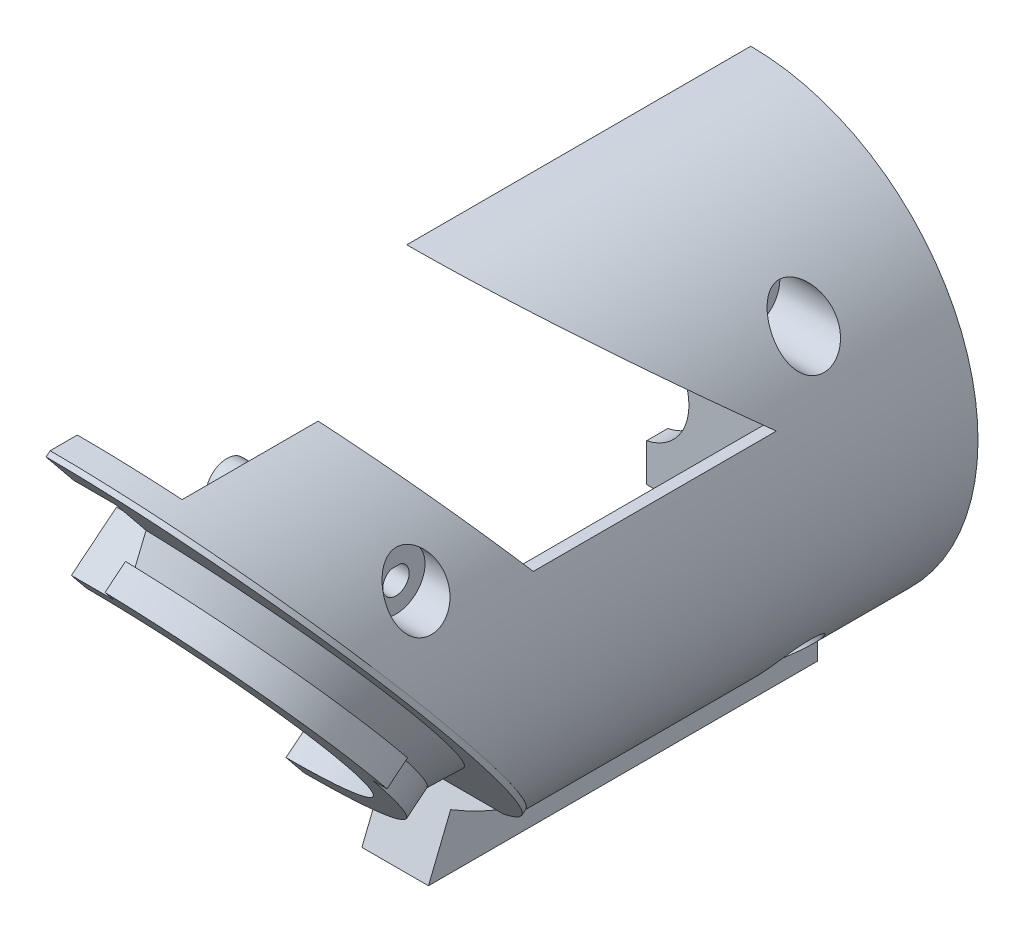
ISO-10303-21;
HEADER;
FILE_DESCRIPTION(('STEP AP214'),'2;1');
FILE_NAME('part.step','',(''),(''),'','','');
FILE_SCHEMA(('AUTOMOTIVE_DESIGN { 1 0 10303 214 1 1 1 1 }'));
ENDSEC;
DATA;
#1=APPLICATION_CONTEXT('core data for automotive mechanical design processes');
#2=APPLICATION_PROTOCOL_DEFINITION('international standard','automotive_design',2000,#1);
#3=PRODUCT_CONTEXT('',#1,'mechanical');
#4=PRODUCT('Part','Part','',(#3));
#5=PRODUCT_RELATED_PRODUCT_CATEGORY('part','',(#4));
#6=PRODUCT_DEFINITION_FORMATION('','',#4);
#7=PRODUCT_DEFINITION_CONTEXT('part definition',#1,'design');
#8=PRODUCT_DEFINITION('design','',#6,#7);
#9=PRODUCT_DEFINITION_SHAPE('','',#8);
#10=(LENGTH_UNIT() NAMED_UNIT(*) SI_UNIT(.MILLI.,.METRE.));
#11=(NAMED_UNIT(*) PLANE_ANGLE_UNIT() SI_UNIT($,.RADIAN.));
#12=(NAMED_UNIT(*) SI_UNIT($,.STERADIAN.) SOLID_ANGLE_UNIT());
#13=UNCERTAINTY_MEASURE_WITH_UNIT(LENGTH_MEASURE(1.E-05),#10,'distance_accuracy_value','');
#14=(GEOMETRIC_REPRESENTATION_CONTEXT(3) GLOBAL_UNCERTAINTY_ASSIGNED_CONTEXT((#13)) GLOBAL_UNIT_ASSIGNED_CONTEXT((#10,
#11,#12)) REPRESENTATION_CONTEXT('',''));
#15=CARTESIAN_POINT('',(0.,0.,0.));
#16=DIRECTION('',(0.,0.,1.));
#17=DIRECTION('',(1.,0.,0.));
#18=AXIS2_PLACEMENT_3D('',#15,#16,#17);
#19=CARTESIAN_POINT('',(0.,-1.57330097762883,49.4701416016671));
#20=DIRECTION('',(0.,-0.629320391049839,0.77714596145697));
#21=DIRECTION('',(0.,-0.77714596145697,-0.629320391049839));
#22=AXIS2_PLACEMENT_3D('',#19,#20,#21);
#23=CYLINDRICAL_SURFACE('',#22,18.9999999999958);
#24=DIRECTION('',(0.,-0.629320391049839,0.77714596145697));
#25=VECTOR('',#24,1.);
#26=CARTESIAN_POINT('',(4.,12.8615445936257,61.1592490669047));
#27=LINE('',#26,#25);
#28=CARTESIAN_POINT('',(4.,11.2882436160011,63.1021139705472));
#29=VERTEX_POINT('',#28);
#30=CARTESIAN_POINT('',(4.,12.8615445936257,61.1592490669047));
#31=VERTEX_POINT('',#30);
#32=EDGE_CURVE('E205',#29,#31,#27,.F.);
#33=ORIENTED_EDGE('',*,*,#32,.F.);
#34=CARTESIAN_POINT('',(0.,-3.14660195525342,51.4130065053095));
#35=DIRECTION('',(0.,-0.629320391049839,0.777145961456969));
#36=DIRECTION('',(0.,-0.777145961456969,-0.629320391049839));
#37=AXIS2_PLACEMENT_3D('',#34,#35,#36);
#38=CIRCLE('',#37,18.9999999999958);
#39=CARTESIAN_POINT('',(18.9999999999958,-3.14660195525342,51.4130065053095));
#40=VERTEX_POINT('',#39);
#41=EDGE_CURVE('E356',#40,#29,#38,.T.);
#42=ORIENTED_EDGE('',*,*,#41,.F.);
#43=DIRECTION('',(0.,-0.629320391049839,0.77714596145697));
#44=VECTOR('',#43,1.);
#45=CARTESIAN_POINT('',(18.9999999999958,-1.57330097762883,49.4701416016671));
#46=LINE('',#45,#44);
#47=CARTESIAN_POINT('',(18.9999999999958,-1.57330097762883,49.4701416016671));
#48=VERTEX_POINT('',#47);
#49=EDGE_CURVE('E275',#48,#40,#46,.T.);
#50=ORIENTED_EDGE('',*,*,#49,.F.);
#51=CARTESIAN_POINT('',(0.,-1.57330097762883,49.4701416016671));
#52=DIRECTION('',(0.,-0.629320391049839,0.777145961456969));
#53=DIRECTION('',(0.,-0.777145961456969,-0.629320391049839));
#54=AXIS2_PLACEMENT_3D('',#51,#52,#53);
#55=CIRCLE('',#54,18.9999999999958);
#56=EDGE_CURVE('E349',#48,#31,#55,.T.);
#57=ORIENTED_EDGE('',*,*,#56,.T.);
#58=EDGE_LOOP('',(#33,#42,#50,#57));
#59=FACE_BOUND('',#58,.T.);
#60=ADVANCED_FACE('F70',(#59),#23,.T.);
#61=CARTESIAN_POINT('',(0.,-1.57330097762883,49.4701416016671));
#62=DIRECTION('',(0.,-0.629320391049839,0.777145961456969));
#63=DIRECTION('',(0.,-0.777145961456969,-0.629320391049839));
#64=AXIS2_PLACEMENT_3D('',#61,#62,#63);
#65=PLANE('',#64);
#66=DIRECTION('',(1.,0.,0.));
#67=VECTOR('',#66,1.);
#68=CARTESIAN_POINT('',(0.,11.8505658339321,60.3405746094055));
#69=LINE('',#68,#67);
#70=CARTESIAN_POINT('',(3.72666852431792,11.8505658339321,60.3405746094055));
#71=VERTEX_POINT('',#70);
#72=CARTESIAN_POINT('',(4.,11.8505658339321,60.3405746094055));
#73=VERTEX_POINT('',#72);
#74=EDGE_CURVE('E298',#71,#73,#69,.T.);
#75=ORIENTED_EDGE('',*,*,#74,.T.);
#76=DIRECTION('',(0.,0.77714596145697,0.629320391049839));
#77=VECTOR('',#76,1.);
#78=CARTESIAN_POINT('',(4.,-1.57330097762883,49.4701416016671));
#79=LINE('',#78,#77);
#80=EDGE_CURVE('E301',#73,#31,#79,.T.);
#81=ORIENTED_EDGE('',*,*,#80,.T.);
#82=ORIENTED_EDGE('',*,*,#56,.F.);
#83=DIRECTION('',(1.,0.,0.));
#84=VECTOR('',#83,1.);
#85=CARTESIAN_POINT('',(18.9999999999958,-1.57330097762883,49.4701416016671));
#86=LINE('',#85,#84);
#87=CARTESIAN_POINT('',(17.6707264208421,-1.57330097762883,49.4701416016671));
#88=VERTEX_POINT('',#87);
#89=EDGE_CURVE('E352',#88,#48,#86,.T.);
#90=ORIENTED_EDGE('',*,*,#89,.F.);
#91=CARTESIAN_POINT('',(0.,-1.5733009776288,49.4701416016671));
#92=DIRECTION('',(0.,-0.629320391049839,0.77714596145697));
#93=DIRECTION('',(0.,-0.77714596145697,-0.629320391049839));
#94=AXIS2_PLACEMENT_3D('',#91,#92,#93);
#95=CIRCLE('',#94,17.6707264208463);
#96=EDGE_CURVE('E295',#88,#71,#95,.T.);
#97=ORIENTED_EDGE('',*,*,#96,.T.);
#98=EDGE_LOOP('',(#75,#81,#82,#90,#97));
#99=FACE_BOUND('',#98,.T.);
#100=ADVANCED_FACE('F243',(#99),#65,.F.);
#101=CARTESIAN_POINT('',(0.,-0.314660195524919,47.2724698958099));
#102=DIRECTION('',(0.,-0.629320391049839,0.77714596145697));
#103=DIRECTION('',(0.,-0.77714596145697,-0.629320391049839));
#104=AXIS2_PLACEMENT_3D('',#101,#102,#103);
#105=PLANE('',#104);
#106=DIRECTION('',(0.,0.77714596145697,0.629320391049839));
#107=VECTOR('',#106,1.);
#108=CARTESIAN_POINT('',(0.,-0.314660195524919,47.2724698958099));
#109=LINE('',#108,#107);
#110=CARTESIAN_POINT('',(0.,-18.844458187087,32.267335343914));
#111=VERTEX_POINT('',#110);
#112=CARTESIAN_POINT('',(0.,-14.7657732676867,35.5701892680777));
#113=VERTEX_POINT('',#112);
#114=EDGE_CURVE('E323',#111,#113,#109,.T.);
#115=ORIENTED_EDGE('',*,*,#114,.F.);
#116=DIRECTION('',(1.,0.,0.));
#117=VECTOR('',#116,1.);
#118=CARTESIAN_POINT('',(-10.903971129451,-18.844458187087,32.267335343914));
#119=LINE('',#118,#117);
#120=CARTESIAN_POINT('',(10.903971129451,-18.844458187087,32.267335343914));
#121=VERTEX_POINT('',#120);
#122=EDGE_CURVE('E289',#111,#121,#119,.T.);
#123=ORIENTED_EDGE('',*,*,#122,.T.);
#124=CARTESIAN_POINT('',(0.,-0.314660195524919,47.2724698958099));
#125=DIRECTION('',(0.,-0.629320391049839,0.77714596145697));
#126=DIRECTION('',(0.,-0.77714596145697,-0.629320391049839));
#127=AXIS2_PLACEMENT_3D('',#124,#125,#126);
#128=ELLIPSE('',#127,27.6653306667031,21.5);
#129=CARTESIAN_POINT('',(0.,21.1853398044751,64.6828266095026));
#130=VERTEX_POINT('',#129);
#131=EDGE_CURVE('E285',#121,#130,#128,.T.);
#132=ORIENTED_EDGE('',*,*,#131,.T.);
#133=CARTESIAN_POINT('',(0.,17.9796210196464,62.086886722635));
#134=VERTEX_POINT('',#133);
#135=EDGE_CURVE('E332',#134,#130,#109,.T.);
#136=ORIENTED_EDGE('',*,*,#135,.F.);
#137=DIRECTION('',(-1.,0.,0.));
#138=VECTOR('',#137,1.);
#139=CARTESIAN_POINT('',(0.,17.9796210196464,62.086886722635));
#140=LINE('',#139,#138);
#141=CARTESIAN_POINT('',(4.,17.9796210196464,62.086886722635));
#142=VERTEX_POINT('',#141);
#143=EDGE_CURVE('E362',#142,#134,#140,.T.);
#144=ORIENTED_EDGE('',*,*,#143,.F.);
#145=DIRECTION('',(0.,0.77714596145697,0.629320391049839));
#146=VECTOR('',#145,1.);
#147=CARTESIAN_POINT('',(4.,-0.314660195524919,47.2724698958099));
#148=LINE('',#147,#146);
#149=CARTESIAN_POINT('',(4.,14.4348455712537,59.216384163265));
#150=VERTEX_POINT('',#149);
#151=EDGE_CURVE('E224',#150,#142,#148,.T.);
#152=ORIENTED_EDGE('',*,*,#151,.F.);
#153=CARTESIAN_POINT('',(0.,-4.20150025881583E-12,47.5272766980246));
#154=DIRECTION('',(0.,-0.629320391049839,0.77714596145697));
#155=DIRECTION('',(0.,-0.77714596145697,-0.629320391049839));
#156=AXIS2_PLACEMENT_3D('',#153,#154,#155);
#157=CIRCLE('',#156,19.);
#158=EDGE_CURVE('E274',#113,#150,#157,.T.);
#159=ORIENTED_EDGE('',*,*,#158,.F.);
#160=EDGE_LOOP('',(#115,#123,#132,#136,#144,#152,#159));
#161=FACE_BOUND('',#160,.T.);
#162=ADVANCED_FACE('F246',(#161),#105,.T.);
#163=DIRECTION('',(0.,0.629320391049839,-0.77714596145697));
#164=VECTOR('',#163,1.);
#165=SURFACE_OF_LINEAR_EXTRUSION('',#128,#164);
#166=CARTESIAN_POINT('',(0.,0.,46.8838969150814));
#167=DIRECTION('',(0.,-0.629320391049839,0.77714596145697));
#168=DIRECTION('',(0.,-0.77714596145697,-0.629320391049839));
#169=AXIS2_PLACEMENT_3D('',#166,#167,#168);
#170=ELLIPSE('',#169,27.6653306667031,21.5);
#171=CARTESIAN_POINT('',(10.903971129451,-18.5297979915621,31.8787623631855));
#172=VERTEX_POINT('',#171);
#173=CARTESIAN_POINT('',(0.,21.5,64.2942536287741));
#174=VERTEX_POINT('',#173);
#175=EDGE_CURVE('E277',#172,#174,#170,.T.);
#176=ORIENTED_EDGE('',*,*,#175,.T.);
#177=DIRECTION('',(0.,0.629320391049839,-0.77714596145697));
#178=VECTOR('',#177,1.);
#179=CARTESIAN_POINT('',(0.,21.1853398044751,64.6828266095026));
#180=LINE('',#179,#178);
#181=EDGE_CURVE('E334',#174,#130,#180,.F.);
#182=ORIENTED_EDGE('',*,*,#181,.T.);
#183=ORIENTED_EDGE('',*,*,#131,.F.);
#184=DIRECTION('',(0.,0.629320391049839,-0.77714596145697));
#185=VECTOR('',#184,1.);
#186=CARTESIAN_POINT('',(10.903971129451,-18.844458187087,32.267335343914));
#187=LINE('',#186,#185);
#188=EDGE_CURVE('E291',#121,#172,#187,.T.);
#189=ORIENTED_EDGE('',*,*,#188,.T.);
#190=EDGE_LOOP('',(#176,#182,#183,#189));
#191=FACE_BOUND('',#190,.T.);
#192=ADVANCED_FACE('F72',(#191),#165,.F.);
#193=CARTESIAN_POINT('',(-10.903971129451,-18.844458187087,32.267335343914));
#194=DIRECTION('',(0.,0.77714596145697,0.629320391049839));
#195=DIRECTION('',(0.,-0.629320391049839,0.77714596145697));
#196=AXIS2_PLACEMENT_3D('',#193,#194,#195);
#197=PLANE('',#196);
#198=ORIENTED_EDGE('',*,*,#122,.F.);
#199=DIRECTION('',(0.,0.629320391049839,-0.77714596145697));
#200=VECTOR('',#199,1.);
#201=CARTESIAN_POINT('',(0.,-18.844458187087,32.267335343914));
#202=LINE('',#201,#200);
#203=CARTESIAN_POINT('',(0.,-18.5297979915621,31.8787623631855));
#204=VERTEX_POINT('',#203);
#205=EDGE_CURVE('E324',#111,#204,#202,.T.);
#206=ORIENTED_EDGE('',*,*,#205,.T.);
#207=DIRECTION('',(1.,0.,0.));
#208=VECTOR('',#207,1.);
#209=CARTESIAN_POINT('',(-10.903971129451,-18.5297979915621,31.8787623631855));
#210=LINE('',#209,#208);
#211=EDGE_CURVE('E284',#204,#172,#210,.T.);
#212=ORIENTED_EDGE('',*,*,#211,.T.);
#213=ORIENTED_EDGE('',*,*,#188,.F.);
#214=EDGE_LOOP('',(#198,#206,#212,#213));
#215=FACE_BOUND('',#214,.T.);
#216=ADVANCED_FACE('F373',(#215),#197,.F.);
#217=CARTESIAN_POINT('',(0.,0.,46.8838969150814));
#218=DIRECTION('',(0.,-0.629320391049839,0.77714596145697));
#219=DIRECTION('',(0.,-0.77714596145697,-0.629320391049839));
#220=AXIS2_PLACEMENT_3D('',#217,#218,#219);
#221=PLANE('',#220);
#222=ORIENTED_EDGE('',*,*,#211,.F.);
#223=DIRECTION('',(0.,0.77714596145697,0.629320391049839));
#224=VECTOR('',#223,1.);
#225=CARTESIAN_POINT('',(0.,0.,46.8838969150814));
#226=LINE('',#225,#224);
#227=CARTESIAN_POINT('',(0.,-11.342529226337,37.6988978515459));
#228=VERTEX_POINT('',#227);
#229=EDGE_CURVE('E200',#204,#228,#226,.T.);
#230=ORIENTED_EDGE('',*,*,#229,.T.);
#231=CARTESIAN_POINT('',(0.,0.314660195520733,47.1387037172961));
#232=DIRECTION('',(0.,-0.629320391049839,0.77714596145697));
#233=DIRECTION('',(0.,-0.77714596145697,-0.629320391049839));
#234=AXIS2_PLACEMENT_3D('',#231,#232,#233);
#235=CIRCLE('',#234,15.0000000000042);
#236=CARTESIAN_POINT('',(0.,11.9718496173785,56.5785095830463));
#237=VERTEX_POINT('',#236);
#238=EDGE_CURVE('E197',#228,#237,#235,.T.);
#239=ORIENTED_EDGE('',*,*,#238,.T.);
#240=CARTESIAN_POINT('',(0.,13.7385270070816,58.0091367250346));
#241=VERTEX_POINT('',#240);
#242=EDGE_CURVE('E181',#237,#241,#226,.T.);
#243=ORIENTED_EDGE('',*,*,#242,.T.);
#244=DIRECTION('',(1.,0.,0.));
#245=VECTOR('',#244,1.);
#246=CARTESIAN_POINT('',(0.,13.7385270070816,58.0091367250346));
#247=LINE('',#246,#245);
#248=CARTESIAN_POINT('',(4.,13.7385270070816,58.0091367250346));
#249=VERTEX_POINT('',#248);
#250=EDGE_CURVE('E193',#241,#249,#247,.T.);
#251=ORIENTED_EDGE('',*,*,#250,.T.);
#252=DIRECTION('',(0.,0.77714596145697,0.629320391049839));
#253=VECTOR('',#252,1.);
#254=CARTESIAN_POINT('',(4.,0.,46.8838969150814));
#255=LINE('',#254,#253);
#256=CARTESIAN_POINT('',(4.,18.2942812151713,61.6983137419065));
#257=VERTEX_POINT('',#256);
#258=EDGE_CURVE('E305',#249,#257,#255,.T.);
#259=ORIENTED_EDGE('',*,*,#258,.T.);
#260=DIRECTION('',(-1.,0.,0.));
#261=VECTOR('',#260,1.);
#262=CARTESIAN_POINT('',(0.,18.2942812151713,61.6983137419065));
#263=LINE('',#262,#261);
#264=CARTESIAN_POINT('',(0.,18.2942812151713,61.6983137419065));
#265=VERTEX_POINT('',#264);
#266=EDGE_CURVE('E79',#257,#265,#263,.T.);
#267=ORIENTED_EDGE('',*,*,#266,.T.);
#268=EDGE_CURVE('E94',#265,#174,#226,.T.);
#269=ORIENTED_EDGE('',*,*,#268,.T.);
#270=ORIENTED_EDGE('',*,*,#175,.F.);
#271=EDGE_LOOP('',(#222,#230,#239,#243,#251,#259,#267,#269,#270));
#272=FACE_BOUND('',#271,.T.);
#273=ADVANCED_FACE('F191',(#272),#221,.F.);
#274=CARTESIAN_POINT('',(0.,-1.5733009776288,49.4701416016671));
#275=DIRECTION('',(0.,0.629320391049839,-0.777145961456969));
#276=DIRECTION('',(0.,0.777145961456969,0.629320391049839));
#277=AXIS2_PLACEMENT_3D('',#274,#275,#276);
#278=CONICAL_SURFACE('',#277,17.6707264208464,0.488692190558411);
#279=DIRECTION('',(0.,0.190808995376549,-0.981627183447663));
#280=VECTOR('',#279,1.);
#281=CARTESIAN_POINT('',(0.,-22.4880107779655,75.2976572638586));
#282=LINE('',#281,#280);
#283=CARTESIAN_POINT('',(0.,-15.3060346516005,38.3495931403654));
#284=VERTEX_POINT('',#283);
#285=EDGE_CURVE('E327',#113,#284,#282,.F.);
#286=ORIENTED_EDGE('',*,*,#285,.F.);
#287=ORIENTED_EDGE('',*,*,#158,.T.);
#288=CARTESIAN_POINT('',(4.,2.97912617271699,63.8937732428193));
#289=CARTESIAN_POINT('',(4.,3.78414920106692,63.5709677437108));
#290=CARTESIAN_POINT('',(4.,4.58857442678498,63.2466772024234));
#291=CARTESIAN_POINT('',(4.,6.1964548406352,62.5957066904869));
#292=CARTESIAN_POINT('',(4.,6.99991003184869,62.2690267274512));
#293=CARTESIAN_POINT('',(4.,8.60607297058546,61.6138592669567));
#294=CARTESIAN_POINT('',(4.,9.40878072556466,61.2853717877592));
#295=CARTESIAN_POINT('',(4.,11.0136036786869,60.6269508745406));
#296=CARTESIAN_POINT('',(4.,11.8157188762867,60.2970174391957));
#297=CARTESIAN_POINT('',(4.,14.2213402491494,59.3054987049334));
#298=CARTESIAN_POINT('',(4.,15.8241358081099,58.6421894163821));
#299=CARTESIAN_POINT('',(4.,18.2273725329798,57.6449004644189));
#300=CARTESIAN_POINT('',(4.,19.0282960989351,57.3120816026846));
#301=CARTESIAN_POINT('',(4.,20.6298684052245,56.6457834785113));
#302=CARTESIAN_POINT('',(4.,21.4305171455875,56.312304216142));
#303=CARTESIAN_POINT('',(4.,22.2310519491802,55.9785514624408));
#304=B_SPLINE_CURVE_WITH_KNOTS('',3,(#288,#289,#290,#291,#292,#293,#294,#295,#296,#297,#298,
#299,#300,#301,#302,#303),.UNSPECIFIED.,.F.,.F.,(4,2,2,2,2,2,2,4),(0.,2.60199258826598,
5.20397688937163,7.80593495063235,10.4078953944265,15.6117721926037,18.2137372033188,
20.8157019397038),.UNSPECIFIED.);
#305=CARTESIAN_POINT('',(4.,11.9211752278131,60.2533792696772));
#306=VERTEX_POINT('',#305);
#307=EDGE_CURVE('E208',#306,#150,#304,.T.);
#308=ORIENTED_EDGE('',*,*,#307,.F.);
#309=CARTESIAN_POINT('',(-9.59917547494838,14.3249769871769,57.2849313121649));
#310=CARTESIAN_POINT('',(-9.39316791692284,14.2065560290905,57.43116901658));
#311=CARTESIAN_POINT('',(-9.18486525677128,14.0896917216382,57.5754844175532));
#312=CARTESIAN_POINT('',(-8.76316193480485,13.859574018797,57.8596561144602));
#313=CARTESIAN_POINT('',(-8.54975952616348,13.7463218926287,57.999510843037));
#314=CARTESIAN_POINT('',(-8.11602198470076,13.5232534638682,58.274977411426));
#315=CARTESIAN_POINT('',(-7.89564958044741,13.4134657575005,58.4105539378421));
#316=CARTESIAN_POINT('',(-7.4489271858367,13.1988371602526,58.6755981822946));
#317=CARTESIAN_POINT('',(-7.22257775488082,13.093995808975,58.8050664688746));
#318=CARTESIAN_POINT('',(-6.75683196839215,12.887136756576,59.0605161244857));
#319=CARTESIAN_POINT('',(-6.51724761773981,12.7852853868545,59.1862920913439));
#320=CARTESIAN_POINT('',(-6.03080096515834,12.5887235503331,59.4290257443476));
#321=CARTESIAN_POINT('',(-5.78393755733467,12.494014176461,59.5459820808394));
#322=CARTESIAN_POINT('',(-5.03311226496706,12.2229225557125,59.8807523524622));
#323=CARTESIAN_POINT('',(-4.51735578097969,12.0588659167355,60.0833454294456));
#324=CARTESIAN_POINT('',(-3.7249355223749,11.8479597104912,60.3437929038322));
#325=CARTESIAN_POINT('',(-3.45971445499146,11.7838719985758,60.4229346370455));
#326=CARTESIAN_POINT('',(-2.92228825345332,11.6683211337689,60.5656280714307));
#327=CARTESIAN_POINT('',(-2.65008231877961,11.6168594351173,60.6291779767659));
#328=CARTESIAN_POINT('',(-2.1021336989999,11.5285224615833,60.7382650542));
#329=CARTESIAN_POINT('',(-1.82643939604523,11.4915291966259,60.7839479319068));
#330=CARTESIAN_POINT('',(-1.27095035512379,11.4328201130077,60.8564476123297));
#331=CARTESIAN_POINT('',(-0.991155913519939,11.4111031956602,60.8832657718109));
#332=CARTESIAN_POINT('',(-0.427043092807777,11.3836701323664,60.9171427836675));
#333=CARTESIAN_POINT('',(-0.142706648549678,11.3780993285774,60.9240221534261));
#334=CARTESIAN_POINT('',(0.425552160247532,11.3836052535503,60.917222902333));
#335=CARTESIAN_POINT('',(0.709474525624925,11.3946819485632,60.9035443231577));
#336=CARTESIAN_POINT('',(1.27519326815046,11.4330708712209,60.8561379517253));
#337=CARTESIAN_POINT('',(1.55698295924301,11.4604217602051,60.8223624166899));
#338=CARTESIAN_POINT('',(2.11573419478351,11.5303298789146,60.7360330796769));
#339=CARTESIAN_POINT('',(2.39269508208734,11.5728891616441,60.6834767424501));
#340=CARTESIAN_POINT('',(3.01727040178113,11.6856727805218,60.5442005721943));
#341=CARTESIAN_POINT('',(3.36287187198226,11.7603103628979,60.4520308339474));
#342=CARTESIAN_POINT('',(4.04203110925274,11.9287691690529,60.2440015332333));
#343=CARTESIAN_POINT('',(4.37558378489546,12.0225983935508,60.128132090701));
#344=CARTESIAN_POINT('',(5.03162876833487,12.226577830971,59.8762384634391));
#345=CARTESIAN_POINT('',(5.35406324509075,12.3368010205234,59.7401241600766));
#346=CARTESIAN_POINT('',(5.98660178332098,12.5703039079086,59.4517721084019));
#347=CARTESIAN_POINT('',(6.29670757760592,12.6935817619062,59.2995366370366));
#348=CARTESIAN_POINT('',(6.8683438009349,12.935105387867,59.0012797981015));
#349=CARTESIAN_POINT('',(7.13118608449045,13.0521313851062,58.8567647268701));
#350=CARTESIAN_POINT('',(7.64875448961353,13.2930860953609,58.5592104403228));
#351=CARTESIAN_POINT('',(7.90348014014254,13.4170152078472,58.4061707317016));
#352=CARTESIAN_POINT('',(8.40212827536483,13.668966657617,58.095036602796));
#353=CARTESIAN_POINT('',(8.64614991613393,13.796911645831,57.9370377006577));
#354=CARTESIAN_POINT('',(9.12749323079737,14.0575644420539,57.6151583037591));
#355=CARTESIAN_POINT('',(9.36481801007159,14.1902699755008,57.4512806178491));
#356=CARTESIAN_POINT('',(9.59917547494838,14.3249769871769,57.2849313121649));
#357=B_SPLINE_CURVE_WITH_KNOTS('',3,(#309,#310,#311,#312,#313,#314,#315,#316,#317,#318,#319,
#320,#321,#322,#323,#324,#325,#326,#327,#328,#329,#330,#331,#332,#333,#334,#335,#336,#337,#338,
#339,#340,#341,#342,#343,#344,#345,#346,#347,#348,#349,#350,#351,#352,#353,#354,#355,#356),
.UNSPECIFIED.,.F.,.F.,(4,2,2,2,2,2,2,2,2,2,2,2,2,2,2,2,2,2,2,2,2,2,2,4),(0.,0.837056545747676,
1.67440404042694,2.51744479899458,3.36040693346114,4.22746048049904,5.09464644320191,
6.82326321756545,7.67493560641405,8.52670604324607,9.37137775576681,10.2159887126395,
11.0681793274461,11.9203682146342,12.7745897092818,13.6289265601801,14.7233069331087,
15.8181444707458,16.9180101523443,18.0177206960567,18.9833183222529,19.9489718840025,
20.9016535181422,21.853885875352),.UNSPECIFIED.);
#358=EDGE_CURVE('E206',#71,#306,#357,.T.);
#359=ORIENTED_EDGE('',*,*,#358,.F.);
#360=ORIENTED_EDGE('',*,*,#96,.F.);
#361=EDGE_CURVE('E294',#284,#88,#95,.T.);
#362=ORIENTED_EDGE('',*,*,#361,.F.);
#363=EDGE_LOOP('',(#286,#287,#308,#359,#360,#362));
#364=FACE_BOUND('',#363,.T.);
#365=ADVANCED_FACE('F226',(#364),#278,.T.);
#366=CARTESIAN_POINT('',(0.,-3.14660195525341,51.4130065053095));
#367=DIRECTION('',(0.,0.629320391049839,-0.77714596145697));
#368=DIRECTION('',(0.,0.77714596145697,0.629320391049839));
#369=AXIS2_PLACEMENT_3D('',#366,#367,#368);
#370=CYLINDRICAL_SURFACE('',#369,17.6707264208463);
#371=CARTESIAN_POINT('',(0.,-3.14660195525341,51.4130065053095));
#372=DIRECTION('',(0.,-0.629320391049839,0.77714596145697));
#373=DIRECTION('',(0.,-0.77714596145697,-0.629320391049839));
#374=AXIS2_PLACEMENT_3D('',#371,#372,#373);
#375=CIRCLE('',#374,17.6707264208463);
#376=CARTESIAN_POINT('',(0.,-16.8793356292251,40.2924580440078));
#377=VERTEX_POINT('',#376);
#378=CARTESIAN_POINT('',(17.6707264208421,-3.14660195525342,51.4130065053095));
#379=VERTEX_POINT('',#378);
#380=EDGE_CURVE('E267',#377,#379,#375,.T.);
#381=ORIENTED_EDGE('',*,*,#380,.F.);
#382=DIRECTION('',(0.,0.629320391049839,-0.77714596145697));
#383=VECTOR('',#382,1.);
#384=CARTESIAN_POINT('',(0.,-16.8793356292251,40.2924580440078));
#385=LINE('',#384,#383);
#386=EDGE_CURVE('E268',#377,#284,#385,.T.);
#387=ORIENTED_EDGE('',*,*,#386,.T.);
#388=ORIENTED_EDGE('',*,*,#361,.T.);
#389=DIRECTION('',(0.,-0.629320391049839,0.77714596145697));
#390=VECTOR('',#389,1.);
#391=CARTESIAN_POINT('',(17.6707264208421,-1.57330097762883,49.4701416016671));
#392=LINE('',#391,#390);
#393=EDGE_CURVE('E271',#88,#379,#392,.T.);
#394=ORIENTED_EDGE('',*,*,#393,.T.);
#395=EDGE_LOOP('',(#381,#387,#388,#394));
#396=FACE_BOUND('',#395,.T.);
#397=ADVANCED_FACE('F256',(#396),#370,.T.);
#398=CARTESIAN_POINT('',(0.,-3.14660195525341,51.4130065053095));
#399=DIRECTION('',(0.,-0.629320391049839,0.77714596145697));
#400=DIRECTION('',(0.,-0.77714596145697,-0.629320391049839));
#401=AXIS2_PLACEMENT_3D('',#398,#399,#400);
#402=PLANE('',#401);
#403=DIRECTION('',(0.,0.77714596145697,0.629320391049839));
#404=VECTOR('',#403,1.);
#405=CARTESIAN_POINT('',(0.,-3.14660195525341,51.4130065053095));
#406=LINE('',#405,#404);
#407=CARTESIAN_POINT('',(0.,-14.8037913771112,41.9732006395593));
#408=VERTEX_POINT('',#407);
#409=EDGE_CURVE('E86',#377,#408,#406,.T.);
#410=ORIENTED_EDGE('',*,*,#409,.F.);
#411=ORIENTED_EDGE('',*,*,#380,.T.);
#412=DIRECTION('',(1.,0.,0.));
#413=VECTOR('',#412,1.);
#414=CARTESIAN_POINT('',(18.9999999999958,-3.14660195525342,51.4130065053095));
#415=LINE('',#414,#413);
#416=EDGE_CURVE('E353',#379,#40,#415,.T.);
#417=ORIENTED_EDGE('',*,*,#416,.T.);
#418=ORIENTED_EDGE('',*,*,#41,.T.);
#419=DIRECTION('',(0.,0.77714596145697,0.629320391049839));
#420=VECTOR('',#419,1.);
#421=CARTESIAN_POINT('',(4.,14.8330190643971,65.9726165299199));
#422=LINE('',#421,#420);
#423=CARTESIAN_POINT('',(4.,10.2772648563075,62.283439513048));
#424=VERTEX_POINT('',#423);
#425=EDGE_CURVE('E319',#424,#29,#422,.T.);
#426=ORIENTED_EDGE('',*,*,#425,.F.);
#427=DIRECTION('',(1.,0.,0.));
#428=VECTOR('',#427,1.);
#429=CARTESIAN_POINT('',(4.,10.2772648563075,62.283439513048));
#430=LINE('',#429,#428);
#431=CARTESIAN_POINT('',(0.,10.2772648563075,62.283439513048));
#432=VERTEX_POINT('',#431);
#433=EDGE_CURVE('E316',#432,#424,#430,.T.);
#434=ORIENTED_EDGE('',*,*,#433,.F.);
#435=CARTESIAN_POINT('',(0.,8.51058746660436,60.8528123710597));
#436=VERTEX_POINT('',#435);
#437=EDGE_CURVE('E184',#436,#432,#406,.T.);
#438=ORIENTED_EDGE('',*,*,#437,.F.);
#439=CARTESIAN_POINT('',(0.,-3.14660195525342,51.4130065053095));
#440=DIRECTION('',(0.,-0.629320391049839,0.777145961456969));
#441=DIRECTION('',(0.,-0.777145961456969,-0.629320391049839));
#442=AXIS2_PLACEMENT_3D('',#439,#440,#441);
#443=CIRCLE('',#442,15.0000000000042);
#444=EDGE_CURVE('E341',#408,#436,#443,.T.);
#445=ORIENTED_EDGE('',*,*,#444,.F.);
#446=EDGE_LOOP('',(#410,#411,#417,#418,#426,#434,#438,#445));
#447=FACE_BOUND('',#446,.T.);
#448=ADVANCED_FACE('F250',(#447),#402,.T.);
#449=CARTESIAN_POINT('',(18.9999999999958,-1.57330097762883,49.4701416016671));
#450=DIRECTION('',(0.,-0.77714596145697,-0.629320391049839));
#451=DIRECTION('',(0.,0.629320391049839,-0.77714596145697));
#452=AXIS2_PLACEMENT_3D('',#449,#450,#451);
#453=PLANE('',#452);
#454=ORIENTED_EDGE('',*,*,#416,.F.);
#455=ORIENTED_EDGE('',*,*,#393,.F.);
#456=ORIENTED_EDGE('',*,*,#89,.T.);
#457=ORIENTED_EDGE('',*,*,#49,.T.);
#458=EDGE_LOOP('',(#454,#455,#456,#457));
#459=FACE_BOUND('',#458,.T.);
#460=ADVANCED_FACE('F241',(#459),#453,.T.);
#461=CARTESIAN_POINT('',(0.,1.88796117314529,45.1958388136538));
#462=DIRECTION('',(0.,-0.629320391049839,0.77714596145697));
#463=DIRECTION('',(0.,-0.77714596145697,-0.629320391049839));
#464=AXIS2_PLACEMENT_3D('',#461,#462,#463);
#465=CYLINDRICAL_SURFACE('',#464,15.0000000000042);
#466=ORIENTED_EDGE('',*,*,#444,.T.);
#467=DIRECTION('',(0.,-0.629320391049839,0.77714596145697));
#468=VECTOR('',#467,1.);
#469=CARTESIAN_POINT('',(0.,13.5451505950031,54.635644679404));
#470=LINE('',#469,#468);
#471=EDGE_CURVE('E198',#436,#237,#470,.F.);
#472=ORIENTED_EDGE('',*,*,#471,.T.);
#473=ORIENTED_EDGE('',*,*,#238,.F.);
#474=DIRECTION('',(0.,-0.629320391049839,0.77714596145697));
#475=VECTOR('',#474,1.);
#476=CARTESIAN_POINT('',(0.,-9.76922824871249,35.7560329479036));
#477=LINE('',#476,#475);
#478=EDGE_CURVE('E330',#228,#408,#477,.T.);
#479=ORIENTED_EDGE('',*,*,#478,.T.);
#480=EDGE_LOOP('',(#466,#472,#473,#479));
#481=FACE_BOUND('',#480,.T.);
#482=ADVANCED_FACE('F238',(#481),#465,.F.);
#483=CARTESIAN_POINT('',(4.,18.6089414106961,61.3097407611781));
#484=DIRECTION('',(0.,0.777145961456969,0.629320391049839));
#485=DIRECTION('',(0.,-0.629320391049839,0.777145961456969));
#486=AXIS2_PLACEMENT_3D('',#483,#484,#485);
#487=PLANE('',#486);
#488=ORIENTED_EDGE('',*,*,#143,.T.);
#489=DIRECTION('',(0.,0.629320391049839,-0.777145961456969));
#490=VECTOR('',#489,1.);
#491=CARTESIAN_POINT('',(0.,18.6089414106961,61.3097407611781));
#492=LINE('',#491,#490);
#493=EDGE_CURVE('E312',#134,#265,#492,.T.);
#494=ORIENTED_EDGE('',*,*,#493,.T.);
#495=ORIENTED_EDGE('',*,*,#266,.F.);
#496=DIRECTION('',(0.,-0.629320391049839,0.777145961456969));
#497=VECTOR('',#496,1.);
#498=CARTESIAN_POINT('',(4.,18.6089414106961,61.3097407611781));
#499=LINE('',#498,#497);
#500=EDGE_CURVE('E310',#257,#142,#499,.T.);
#501=ORIENTED_EDGE('',*,*,#500,.T.);
#502=EDGE_LOOP('',(#488,#494,#495,#501));
#503=FACE_BOUND('',#502,.T.);
#504=ADVANCED_FACE('F237',(#503),#487,.F.);
#505=CARTESIAN_POINT('',(4.,18.6089414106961,61.3097407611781));
#506=DIRECTION('',(1.,0.,0.));
#507=DIRECTION('',(0.,0.,-1.));
#508=AXIS2_PLACEMENT_3D('',#505,#506,#507);
#509=PLANE('',#508);
#510=DIRECTION('',(0.,-0.629320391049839,0.777145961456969));
#511=VECTOR('',#510,1.);
#512=CARTESIAN_POINT('',(4.,14.0531872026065,57.6205637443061));
#513=LINE('',#512,#511);
#514=EDGE_CURVE('E204',#249,#306,#513,.T.);
#515=ORIENTED_EDGE('',*,*,#514,.T.);
#516=ORIENTED_EDGE('',*,*,#307,.T.);
#517=ORIENTED_EDGE('',*,*,#151,.T.);
#518=ORIENTED_EDGE('',*,*,#500,.F.);
#519=ORIENTED_EDGE('',*,*,#258,.F.);
#520=EDGE_LOOP('',(#515,#516,#517,#518,#519));
#521=FACE_BOUND('',#520,.T.);
#522=ADVANCED_FACE('F236',(#521),#509,.F.);
#523=CARTESIAN_POINT('',(4.,14.0531872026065,57.6205637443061));
#524=DIRECTION('',(0.,-0.777145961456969,-0.629320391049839));
#525=DIRECTION('',(0.,0.629320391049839,-0.777145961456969));
#526=AXIS2_PLACEMENT_3D('',#523,#524,#525);
#527=PLANE('',#526);
#528=ORIENTED_EDGE('',*,*,#250,.F.);
#529=DIRECTION('',(0.,-0.629320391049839,0.777145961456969));
#530=VECTOR('',#529,1.);
#531=CARTESIAN_POINT('',(0.,14.0531872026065,57.6205637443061));
#532=LINE('',#531,#530);
#533=EDGE_CURVE('E13',#241,#432,#532,.T.);
#534=ORIENTED_EDGE('',*,*,#533,.T.);
#535=ORIENTED_EDGE('',*,*,#433,.T.);
#536=EDGE_CURVE('E315',#73,#424,#513,.T.);
#537=ORIENTED_EDGE('',*,*,#536,.F.);
#538=ORIENTED_EDGE('',*,*,#74,.F.);
#539=ORIENTED_EDGE('',*,*,#358,.T.);
#540=ORIENTED_EDGE('',*,*,#514,.F.);
#541=EDGE_LOOP('',(#528,#534,#535,#537,#538,#539,#540));
#542=FACE_BOUND('',#541,.T.);
#543=ADVANCED_FACE('F202',(#542),#527,.F.);
#544=ORIENTED_EDGE('',*,*,#32,.T.);
#545=ORIENTED_EDGE('',*,*,#80,.F.);
#546=ORIENTED_EDGE('',*,*,#536,.T.);
#547=ORIENTED_EDGE('',*,*,#425,.T.);
#548=EDGE_LOOP('',(#544,#545,#546,#547));
#549=FACE_BOUND('',#548,.T.);
#550=ADVANCED_FACE('F230',(#549),#509,.F.);
#551=CARTESIAN_POINT('',(0.,-27.743431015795,66.6356900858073));
#552=DIRECTION('',(1.,0.,0.));
#553=DIRECTION('',(0.,0.,-1.));
#554=AXIS2_PLACEMENT_3D('',#551,#552,#553);
#555=PLANE('',#554);
#556=ORIENTED_EDGE('',*,*,#437,.T.);
#557=ORIENTED_EDGE('',*,*,#533,.F.);
#558=ORIENTED_EDGE('',*,*,#242,.F.);
#559=ORIENTED_EDGE('',*,*,#471,.F.);
#560=EDGE_LOOP('',(#556,#557,#558,#559));
#561=FACE_BOUND('',#560,.T.);
#562=ADVANCED_FACE('F180',(#561),#555,.F.);
#563=ORIENTED_EDGE('',*,*,#135,.T.);
#564=ORIENTED_EDGE('',*,*,#181,.F.);
#565=ORIENTED_EDGE('',*,*,#268,.F.);
#566=ORIENTED_EDGE('',*,*,#493,.F.);
#567=EDGE_LOOP('',(#563,#564,#565,#566));
#568=FACE_BOUND('',#567,.T.);
#569=ADVANCED_FACE('F368',(#568),#555,.F.);
#570=ORIENTED_EDGE('',*,*,#114,.T.);
#571=ORIENTED_EDGE('',*,*,#285,.T.);
#572=ORIENTED_EDGE('',*,*,#386,.F.);
#573=ORIENTED_EDGE('',*,*,#409,.T.);
#574=ORIENTED_EDGE('',*,*,#478,.F.);
#575=ORIENTED_EDGE('',*,*,#229,.F.);
#576=ORIENTED_EDGE('',*,*,#205,.F.);
#577=EDGE_LOOP('',(#570,#571,#572,#573,#574,#575,#576));
#578=FACE_BOUND('',#577,.T.);
#579=ADVANCED_FACE('F374',(#578),#555,.F.);
#580=CLOSED_SHELL('',(#60,#100,#162,#192,#216,#273,#365,#397,#448,#460,#482,#504,#522,#543,#550,
#562,#569,#579));
#581=MANIFOLD_SOLID_BREP('B2',#580);
#582=CARTESIAN_POINT('',(0.,0.,65.));
#583=DIRECTION('',(0.,0.,-1.));
#584=DIRECTION('',(-1.,0.,0.));
#585=AXIS2_PLACEMENT_3D('',#582,#583,#584);
#586=CYLINDRICAL_SURFACE('',#585,20.5);
#587=DIRECTION('',(0.,0.,-1.));
#588=VECTOR('',#587,1.);
#589=CARTESIAN_POINT('',(0.,20.5,65.));
#590=LINE('',#589,#588);
#591=CARTESIAN_POINT('',(0.,20.5,1.));
#592=VERTEX_POINT('',#591);
#593=CARTESIAN_POINT('',(0.,20.5,29.3762893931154));
#594=VERTEX_POINT('',#593);
#595=EDGE_CURVE('E1229',#592,#594,#590,.F.);
#596=ORIENTED_EDGE('',*,*,#595,.F.);
#597=CARTESIAN_POINT('',(0.,0.,1.));
#598=DIRECTION('',(0.,0.,1.));
#599=DIRECTION('',(1.,0.,0.));
#600=AXIS2_PLACEMENT_3D('',#597,#598,#599);
#601=CIRCLE('',#600,20.5);
#602=CARTESIAN_POINT('',(5.30000000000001,-19.8030300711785,1.));
#603=VERTEX_POINT('',#602);
#604=EDGE_CURVE('E1180',#603,#592,#601,.T.);
#605=ORIENTED_EDGE('',*,*,#604,.F.);
#606=DIRECTION('',(0.,0.,-1.));
#607=VECTOR('',#606,1.);
#608=CARTESIAN_POINT('',(5.30000000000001,-19.8030300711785,31.3146467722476));
#609=LINE('',#608,#607);
#610=CARTESIAN_POINT('',(5.30000000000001,-19.8030300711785,31.3146467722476));
#611=VERTEX_POINT('',#610);
#612=EDGE_CURVE('E1176',#611,#603,#609,.T.);
#613=ORIENTED_EDGE('',*,*,#612,.F.);
#614=CARTESIAN_POINT('',(0.,0.,23.3137032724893));
#615=DIRECTION('',(0.,0.374606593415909,0.927183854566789));
#616=DIRECTION('',(0.,0.927183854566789,-0.374606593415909));
#617=AXIS2_PLACEMENT_3D('',#614,#615,#616);
#618=ELLIPSE('',#617,22.1099622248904,20.5);
#619=CARTESIAN_POINT('',(6.57096986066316,-19.4183509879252,31.159226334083));
#620=VERTEX_POINT('',#619);
#621=EDGE_CURVE('E1165',#611,#620,#618,.T.);
#622=ORIENTED_EDGE('',*,*,#621,.T.);
#623=CARTESIAN_POINT('',(0.,0.,46.8838969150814));
#624=DIRECTION('',(0.,0.629320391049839,-0.77714596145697));
#625=DIRECTION('',(0.,-0.77714596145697,-0.629320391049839));
#626=AXIS2_PLACEMENT_3D('',#623,#624,#625);
#627=ELLIPSE('',#626,26.37857110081,20.5);
#628=CARTESIAN_POINT('',(8.76906987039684,-18.5297979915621,31.8787623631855));
#629=VERTEX_POINT('',#628);
#630=EDGE_CURVE('E1052',#629,#620,#627,.T.);
#631=ORIENTED_EDGE('',*,*,#630,.F.);
#632=CARTESIAN_POINT('',(0.,20.5,63.4844695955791));
#633=VERTEX_POINT('',#632);
#634=EDGE_CURVE('E1046',#633,#629,#627,.T.);
#635=ORIENTED_EDGE('',*,*,#634,.F.);
#636=CARTESIAN_POINT('',(0.,20.5,60.9109504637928));
#637=VERTEX_POINT('',#636);
#638=EDGE_CURVE('E1224',#637,#633,#590,.F.);
#639=ORIENTED_EDGE('',*,*,#638,.F.);
#640=CARTESIAN_POINT('',(0.,0.,44.3103777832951));
#641=DIRECTION('',(0.,-0.629320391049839,0.77714596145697));
#642=DIRECTION('',(0.,-0.77714596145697,-0.629320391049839));
#643=AXIS2_PLACEMENT_3D('',#640,#641,#642);
#644=ELLIPSE('',#643,26.37857110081,20.5);
#645=CARTESIAN_POINT('',(8.5,18.6547581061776,59.4167030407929));
#646=VERTEX_POINT('',#645);
#647=EDGE_CURVE('E748',#646,#637,#644,.T.);
#648=ORIENTED_EDGE('',*,*,#647,.F.);
#649=DIRECTION('',(0.,0.,-1.));
#650=VECTOR('',#649,1.);
#651=CARTESIAN_POINT('',(8.5,18.6547581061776,65.));
#652=LINE('',#651,#650);
#653=CARTESIAN_POINT('',(8.5,18.6547581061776,46.5491073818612));
#654=VERTEX_POINT('',#653);
#655=EDGE_CURVE('E746',#654,#646,#652,.F.);
#656=ORIENTED_EDGE('',*,*,#655,.F.);
#657=CARTESIAN_POINT('',(0.,0.,31.4427821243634));
#658=DIRECTION('',(0.,-0.629320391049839,0.77714596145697));
#659=DIRECTION('',(0.,-0.77714596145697,-0.629320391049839));
#660=AXIS2_PLACEMENT_3D('',#657,#658,#659);
#661=ELLIPSE('',#660,26.37857110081,20.5);
#662=CARTESIAN_POINT('',(18.6547581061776,8.5,38.325946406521));
#663=VERTEX_POINT('',#662);
#664=EDGE_CURVE('E1040',#663,#654,#661,.T.);
#665=ORIENTED_EDGE('',*,*,#664,.F.);
#666=DIRECTION('',(0.,0.,-1.));
#667=VECTOR('',#666,1.);
#668=CARTESIAN_POINT('',(18.6547581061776,8.5,65.));
#669=LINE('',#668,#667);
#670=CARTESIAN_POINT('',(18.6547581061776,8.5,15.325946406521));
#671=VERTEX_POINT('',#670);
#672=EDGE_CURVE('E1045',#671,#663,#669,.F.);
#673=ORIENTED_EDGE('',*,*,#672,.F.);
#674=CARTESIAN_POINT('',(0.,0.,5.3736201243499));
#675=DIRECTION('',(0.,0.760409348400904,-0.649444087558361));
#676=DIRECTION('',(0.,-0.649444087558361,-0.760409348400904));
#677=AXIS2_PLACEMENT_3D('',#674,#675,#676);
#678=ELLIPSE('',#677,31.5654578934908,20.5);
#679=EDGE_CURVE('E1048',#594,#671,#678,.T.);
#680=ORIENTED_EDGE('',*,*,#679,.F.);
#681=EDGE_LOOP('',(#596,#605,#613,#622,#631,#635,#639,#648,#656,#665,#673,#680));
#682=FACE_BOUND('',#681,.T.);
#683=CARTESIAN_POINT('',(15.8777657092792,12.9671336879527,13.0000000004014));
#684=CARTESIAN_POINT('',(15.71760192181,13.1632406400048,13.0000020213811));
#685=CARTESIAN_POINT('',(15.5536657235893,13.3565060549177,12.9807907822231));
#686=CARTESIAN_POINT('',(15.2218402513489,13.7334964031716,12.9068468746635));
#687=CARTESIAN_POINT('',(15.0539398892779,13.9171883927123,12.8519993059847));
#688=CARTESIAN_POINT('',(14.7906421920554,14.1952945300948,12.739253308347));
#689=CARTESIAN_POINT('',(14.6950091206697,14.2942330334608,12.6927351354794));
#690=CARTESIAN_POINT('',(14.5047380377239,14.4872673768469,12.5886722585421));
#691=CARTESIAN_POINT('',(14.410100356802,14.5813616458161,12.5311240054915));
#692=CARTESIAN_POINT('',(14.2230706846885,14.7638511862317,12.4050132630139));
#693=CARTESIAN_POINT('',(14.1306749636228,14.8522563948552,12.3364707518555));
#694=CARTESIAN_POINT('',(13.9493292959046,15.0227057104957,12.1880098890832));
#695=CARTESIAN_POINT('',(13.8603770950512,15.1047540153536,12.1080991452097));
#696=CARTESIAN_POINT('',(13.6721320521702,15.2755251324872,11.9209724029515));
#697=CARTESIAN_POINT('',(13.5738283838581,15.362824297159,11.8114285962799));
#698=CARTESIAN_POINT('',(13.3884875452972,15.5246087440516,11.5747418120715));
#699=CARTESIAN_POINT('',(13.3014328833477,15.5991139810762,11.4476268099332));
#700=CARTESIAN_POINT('',(13.1628331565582,15.7161086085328,11.2069102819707));
#701=CARTESIAN_POINT('',(13.1077385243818,15.762013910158,11.0970434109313));
#702=CARTESIAN_POINT('',(13.0114215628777,15.8416168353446,10.8672170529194));
#703=CARTESIAN_POINT('',(12.9701787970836,15.8753324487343,10.7472727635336));
#704=CARTESIAN_POINT('',(12.9108219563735,15.9236272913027,10.5199362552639));
#705=CARTESIAN_POINT('',(12.8900166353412,15.9404443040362,10.413732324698));
#706=CARTESIAN_POINT('',(12.8626663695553,15.9625229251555,10.1983314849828));
#707=CARTESIAN_POINT('',(12.8561111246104,15.9677928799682,10.089136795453));
#708=CARTESIAN_POINT('',(12.8579139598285,15.9663411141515,9.87085590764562));
#709=CARTESIAN_POINT('',(12.8662854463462,15.9596086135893,9.76176989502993));
#710=CARTESIAN_POINT('',(12.8971161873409,15.9347033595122,9.54694980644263));
#711=CARTESIAN_POINT('',(12.9195860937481,15.9165219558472,9.44121832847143));
#712=CARTESIAN_POINT('',(12.9836796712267,15.8643039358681,9.2102944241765));
#713=CARTESIAN_POINT('',(13.0286448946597,15.8274761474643,9.08667122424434));
#714=CARTESIAN_POINT('',(13.1329540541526,15.7410325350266,8.85048482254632));
#715=CARTESIAN_POINT('',(13.192324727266,15.6913929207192,8.73794274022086));
#716=CARTESIAN_POINT('',(13.3498968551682,15.5577957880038,8.47738115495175));
#717=CARTESIAN_POINT('',(13.4536795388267,15.4683557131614,8.33558773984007));
#718=CARTESIAN_POINT('',(13.6742789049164,15.2736980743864,8.07481756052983));
#719=CARTESIAN_POINT('',(13.791122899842,15.1684472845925,7.95589007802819));
#720=CARTESIAN_POINT('',(13.9968220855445,14.9783998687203,7.77137191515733));
#721=CARTESIAN_POINT('',(14.0837942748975,14.8966995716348,7.70038480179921));
#722=CARTESIAN_POINT('',(14.2602676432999,14.7278536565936,7.56867550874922));
#723=CARTESIAN_POINT('',(14.3497697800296,14.6407059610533,7.50795727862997));
#724=CARTESIAN_POINT('',(14.5302929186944,14.4615616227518,7.39657662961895));
#725=CARTESIAN_POINT('',(14.6213148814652,14.3695618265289,7.3459208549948));
#726=CARTESIAN_POINT('',(14.8039550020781,14.1813311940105,7.25470230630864));
#727=CARTESIAN_POINT('',(14.8955730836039,14.0851008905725,7.21413826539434));
#728=CARTESIAN_POINT('',(15.1733471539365,13.7874476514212,7.10653835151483));
#729=CARTESIAN_POINT('',(15.3594747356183,13.5799693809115,7.05539495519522));
#730=CARTESIAN_POINT('',(15.7257537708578,13.1540645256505,6.99814612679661));
#731=CARTESIAN_POINT('',(15.9059113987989,12.9356498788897,6.99199261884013));
#732=CARTESIAN_POINT('',(16.2233567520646,12.5341887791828,7.02587327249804));
#733=CARTESIAN_POINT('',(16.3624888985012,12.351921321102,7.0577238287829));
#734=CARTESIAN_POINT('',(16.6299681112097,11.9893559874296,7.15760825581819));
#735=CARTESIAN_POINT('',(16.7583282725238,11.8090559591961,7.22559743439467));
#736=CARTESIAN_POINT('',(16.9795778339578,11.4880467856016,7.38492147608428));
#737=CARTESIAN_POINT('',(17.0747584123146,11.3458936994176,7.47016405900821));
#738=CARTESIAN_POINT('',(17.253072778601,11.0728485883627,7.66762621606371));
#739=CARTESIAN_POINT('',(17.3362091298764,10.9419541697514,7.77984003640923));
#740=CARTESIAN_POINT('',(17.4502925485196,10.7583739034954,7.96796156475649));
#741=CARTESIAN_POINT('',(17.4866844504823,10.6990785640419,8.03430000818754));
#742=CARTESIAN_POINT('',(17.5555086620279,10.5857682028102,8.17322217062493));
#743=CARTESIAN_POINT('',(17.5879430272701,10.5317504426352,8.24580261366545));
#744=CARTESIAN_POINT('',(17.6485777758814,10.4298239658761,8.39676910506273));
#745=CARTESIAN_POINT('',(17.6767793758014,10.3819134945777,8.47515347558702));
#746=CARTESIAN_POINT('',(17.7287065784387,10.2929883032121,8.63710108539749));
#747=CARTESIAN_POINT('',(17.7524329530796,10.2519723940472,8.72066342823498));
#748=CARTESIAN_POINT('',(17.8108718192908,10.1502917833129,8.95521026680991));
#749=CARTESIAN_POINT('',(17.8409189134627,10.0972113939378,9.11078676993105));
#750=CARTESIAN_POINT('',(17.8860315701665,10.0170872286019,9.43045906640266));
#751=CARTESIAN_POINT('',(17.9011068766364,9.99002651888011,9.59454924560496));
#752=CARTESIAN_POINT('',(17.9152249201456,9.96468178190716,9.91037154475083));
#753=CARTESIAN_POINT('',(17.9156138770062,9.9639814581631,10.0618533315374));
#754=CARTESIAN_POINT('',(17.9037278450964,9.98532325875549,10.362672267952));
#755=CARTESIAN_POINT('',(17.8914557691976,10.0073601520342,10.5120099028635));
#756=CARTESIAN_POINT('',(17.8549238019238,10.0723895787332,10.8012425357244));
#757=CARTESIAN_POINT('',(17.8309128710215,10.1149466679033,10.9412678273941));
#758=CARTESIAN_POINT('',(17.7715685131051,10.2188507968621,11.2115760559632));
#759=CARTESIAN_POINT('',(17.7362339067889,10.2801997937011,11.3418579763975));
#760=CARTESIAN_POINT('',(17.65336056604,10.4218921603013,11.5948703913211));
#761=CARTESIAN_POINT('',(17.6053860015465,10.5029034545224,11.7170822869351));
#762=CARTESIAN_POINT('',(17.4990703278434,10.6790970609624,11.9456980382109));
#763=CARTESIAN_POINT('',(17.4407265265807,10.7742830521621,12.0520977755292));
#764=CARTESIAN_POINT('',(17.3087802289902,10.9851264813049,12.2572808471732));
#765=CARTESIAN_POINT('',(17.2342492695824,11.1018726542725,12.3543432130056));
#766=CARTESIAN_POINT('',(17.0757390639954,11.3441670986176,12.5274871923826));
#767=CARTESIAN_POINT('',(16.9917532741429,11.4697214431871,12.6035541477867));
#768=CARTESIAN_POINT('',(16.8027940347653,11.7451250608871,12.7448299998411));
#769=CARTESIAN_POINT('',(16.6965593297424,11.8958025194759,12.8067212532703));
#770=CARTESIAN_POINT('',(16.4760057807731,12.199444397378,12.9044961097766));
#771=CARTESIAN_POINT('',(16.3616900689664,12.3524079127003,12.9403897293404));
#772=CARTESIAN_POINT('',(16.1846771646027,12.5823629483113,12.9762591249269));
#773=CARTESIAN_POINT('',(16.1241906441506,12.6597849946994,12.9852172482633));
#774=CARTESIAN_POINT('',(16.001914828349,12.8139926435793,12.9970857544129));
#775=CARTESIAN_POINT('',(15.9401262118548,12.8907785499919,12.9999992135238));
#776=CARTESIAN_POINT('',(15.8777657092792,12.9671336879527,13.0000000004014));
#777=B_SPLINE_CURVE_WITH_KNOTS('',3,(#683,#684,#685,#686,#687,#688,#689,#690,#691,#692,#693,
#694,#695,#696,#697,#698,#699,#700,#701,#702,#703,#704,#705,#706,#707,#708,#709,#710,#711,#712,
#713,#714,#715,#716,#717,#718,#719,#720,#721,#722,#723,#724,#725,#726,#727,#728,#729,#730,#731,
#732,#733,#734,#735,#736,#737,#738,#739,#740,#741,#742,#743,#744,#745,#746,#747,#748,#749,#750,
#751,#752,#753,#754,#755,#756,#757,#758,#759,#760,#761,#762,#763,#764,#765,#766,#767,#768,#769,
#770,#771,#772,#773,#774,#775,#776),.UNSPECIFIED.,.T.,.F.,(4,2,2,2,2,2,2,2,2,2,2,2,2,2,2,2,2,2,
2,2,2,2,2,2,2,2,2,2,2,2,2,2,2,2,2,2,2,2,2,2,2,2,2,2,2,2,4),(0.,0.759327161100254,
1.52111481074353,1.95644180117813,2.39190909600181,2.82659386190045,3.26098908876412,
3.77293929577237,4.28408361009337,4.67632884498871,5.0679928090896,5.39512074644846,
5.72201215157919,6.04919730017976,6.37662994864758,6.78418862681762,7.19250961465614,
7.78079982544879,8.37034407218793,8.78638606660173,9.20258771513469,9.61906327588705,
10.0354865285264,10.8817293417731,11.7270677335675,12.4189146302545,13.1099079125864,
13.6810848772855,14.25214010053,14.5401751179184,14.8280598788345,15.1158617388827,
15.4036139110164,15.9019288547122,16.3999192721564,16.8521388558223,17.3042544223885,
17.7471721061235,18.1901359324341,18.6510170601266,19.1120180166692,19.6174263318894,
20.1231866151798,20.7044714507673,21.2855322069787,21.5813302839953,21.8769777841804),.UNSPECIFIED.);
#778=CARTESIAN_POINT('',(15.8777657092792,12.9671336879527,13.0000000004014));
#779=VERTEX_POINT('',#778);
#780=EDGE_CURVE('E761',#779,#779,#777,.T.);
#781=ORIENTED_EDGE('',*,*,#780,.F.);
#782=EDGE_LOOP('',(#781));
#783=FACE_BOUND('',#782,.T.);
#784=CARTESIAN_POINT('',(13.9378237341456,-15.0328663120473,13.0000000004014));
#785=CARTESIAN_POINT('',(14.1233960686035,-14.8608073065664,13.0000033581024));
#786=CARTESIAN_POINT('',(14.3058589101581,-14.6852176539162,12.9852408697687));
#787=CARTESIAN_POINT('',(14.661272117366,-14.3303871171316,12.9221470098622));
#788=CARTESIAN_POINT('',(14.8342290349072,-14.1511488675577,12.8738390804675));
#789=CARTESIAN_POINT('',(15.142772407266,-13.8199180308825,12.7487159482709));
#790=CARTESIAN_POINT('',(15.2801595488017,-13.6677074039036,12.676987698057));
#791=CARTESIAN_POINT('',(15.5416705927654,-13.3695777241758,12.5026364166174));
#792=CARTESIAN_POINT('',(15.6658096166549,-13.2236516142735,12.4000491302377));
#793=CARTESIAN_POINT('',(15.8745472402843,-12.9719020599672,12.1850284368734));
#794=CARTESIAN_POINT('',(15.9621630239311,-12.8637550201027,12.0782570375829));
#795=CARTESIAN_POINT('',(16.123570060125,-12.6608553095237,11.8432488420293));
#796=CARTESIAN_POINT('',(16.1973647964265,-12.5660992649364,11.7150174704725));
#797=CARTESIAN_POINT('',(16.2958241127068,-12.4378091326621,11.5074527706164));
#798=CARTESIAN_POINT('',(16.3267283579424,-12.3971853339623,11.4353289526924));
#799=CARTESIAN_POINT('',(16.3839595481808,-12.3214492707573,11.2865348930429));
#800=CARTESIAN_POINT('',(16.4102889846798,-12.2863340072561,11.2098671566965));
#801=CARTESIAN_POINT('',(16.4580434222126,-12.2222915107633,11.0525564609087));
#802=CARTESIAN_POINT('',(16.4794707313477,-12.193361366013,10.9719153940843));
#803=CARTESIAN_POINT('',(16.5171530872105,-12.142267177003,10.8073842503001));
#804=CARTESIAN_POINT('',(16.5334091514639,-12.120101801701,10.7234948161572));
#805=CARTESIAN_POINT('',(16.5700300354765,-12.0700332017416,10.4934771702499));
#806=CARTESIAN_POINT('',(16.5852909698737,-12.0489942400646,10.3449307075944));
#807=CARTESIAN_POINT('',(16.5994588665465,-12.0294687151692,10.0457122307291));
#808=CARTESIAN_POINT('',(16.5983750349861,-12.0309694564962,9.89504146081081));
#809=CARTESIAN_POINT('',(16.5807302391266,-12.0552710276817,9.60914820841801));
#810=CARTESIAN_POINT('',(16.5654714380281,-12.0762797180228,9.47368771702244));
#811=CARTESIAN_POINT('',(16.5218675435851,-12.1358659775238,9.2089208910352));
#812=CARTESIAN_POINT('',(16.4935229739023,-12.1744428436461,9.07961431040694));
#813=CARTESIAN_POINT('',(16.423926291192,-12.2681743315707,8.82740174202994));
#814=CARTESIAN_POINT('',(16.3824001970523,-12.3236797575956,8.70470303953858));
#815=CARTESIAN_POINT('',(16.2879544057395,-12.4482384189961,8.47119911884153));
#816=CARTESIAN_POINT('',(16.2350313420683,-12.5172956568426,8.36039742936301));
#817=CARTESIAN_POINT('',(16.1128733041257,-12.6742339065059,8.1406972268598));
#818=CARTESIAN_POINT('',(16.0424890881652,-12.7633462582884,8.03332271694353));
#819=CARTESIAN_POINT('',(15.8913408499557,-12.9510564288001,7.83558446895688));
#820=CARTESIAN_POINT('',(15.8105699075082,-13.0496605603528,7.7452321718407));
#821=CARTESIAN_POINT('',(15.5992829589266,-13.3022859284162,7.54183324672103));
#822=CARTESIAN_POINT('',(15.463565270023,-13.4600954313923,7.43886278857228));
#823=CARTESIAN_POINT('',(15.1778458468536,-13.7814890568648,7.26734955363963));
#824=CARTESIAN_POINT('',(15.0278161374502,-13.9450840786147,7.198875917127));
#825=CARTESIAN_POINT('',(14.7677405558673,-14.2192550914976,7.11009547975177));
#826=CARTESIAN_POINT('',(14.6604598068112,-14.3298631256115,7.08137269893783));
#827=CARTESIAN_POINT('',(14.4420446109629,-14.5499609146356,7.03699310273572));
#828=CARTESIAN_POINT('',(14.3309088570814,-14.6594502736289,7.02134076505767));
#829=CARTESIAN_POINT('',(14.1054788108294,-14.876491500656,7.00209486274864));
#830=CARTESIAN_POINT('',(13.9911802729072,-14.9840404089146,6.99851838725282));
#831=CARTESIAN_POINT('',(13.7602698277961,-15.1963674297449,7.00257757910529));
#832=CARTESIAN_POINT('',(13.6436579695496,-15.3011456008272,7.01021300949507));
#833=CARTESIAN_POINT('',(13.3773439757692,-15.5349888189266,7.03938746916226));
#834=CARTESIAN_POINT('',(13.2271196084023,-15.6630692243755,7.06409434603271));
#835=CARTESIAN_POINT('',(12.925042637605,-15.9132575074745,7.12917632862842));
#836=CARTESIAN_POINT('',(12.7731894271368,-16.0353630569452,7.16955748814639));
#837=CARTESIAN_POINT('',(12.4690633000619,-16.2729745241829,7.26530792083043));
#838=CARTESIAN_POINT('',(12.316790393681,-16.3884806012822,7.32067683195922));
#839=CARTESIAN_POINT('',(12.0131634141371,-16.6123276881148,7.44622362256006));
#840=CARTESIAN_POINT('',(11.8618089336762,-16.7206721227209,7.51639435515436));
#841=CARTESIAN_POINT('',(11.617022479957,-16.8910667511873,7.64334117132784));
#842=CARTESIAN_POINT('',(11.5228112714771,-16.9554562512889,7.69551565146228));
#843=CARTESIAN_POINT('',(11.3359800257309,-17.0809310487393,7.80627343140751));
#844=CARTESIAN_POINT('',(11.2433596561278,-17.1420170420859,7.86485537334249));
#845=CARTESIAN_POINT('',(11.0605980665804,-17.2605042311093,7.98878909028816));
#846=CARTESIAN_POINT('',(10.9704527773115,-17.317911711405,8.05412879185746));
#847=CARTESIAN_POINT('',(10.7935529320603,-17.4287148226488,8.1923086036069));
#848=CARTESIAN_POINT('',(10.706796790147,-17.4821123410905,8.26514514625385));
#849=CARTESIAN_POINT('',(10.5245403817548,-17.5925304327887,8.43166737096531));
#850=CARTESIAN_POINT('',(10.4298789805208,-17.6487517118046,8.52682205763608));
#851=CARTESIAN_POINT('',(10.2507994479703,-17.7533603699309,8.73035926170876));
#852=CARTESIAN_POINT('',(10.1663709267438,-17.8017557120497,8.83872813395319));
#853=CARTESIAN_POINT('',(10.0351618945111,-17.8759492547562,9.03831303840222));
#854=CARTESIAN_POINT('',(9.98443493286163,-17.9042917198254,9.12594694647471));
#855=CARTESIAN_POINT('',(9.89518972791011,-17.9537690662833,9.30914582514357));
#856=CARTESIAN_POINT('',(9.85664823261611,-17.9749176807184,9.4046952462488));
#857=CARTESIAN_POINT('',(9.80200372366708,-18.0047633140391,9.5825749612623));
#858=CARTESIAN_POINT('',(9.78294904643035,-18.015107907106,9.66370691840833));
#859=CARTESIAN_POINT('',(9.75714865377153,-18.0290952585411,9.82846433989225));
#860=CARTESIAN_POINT('',(9.75039114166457,-18.0327444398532,9.91208733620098));
#861=CARTESIAN_POINT('',(9.74995126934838,-18.0329823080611,10.0795138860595));
#862=CARTESIAN_POINT('',(9.75628990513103,-18.0295596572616,10.1633175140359));
#863=CARTESIAN_POINT('',(9.78133816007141,-18.0159822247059,10.3284967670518));
#864=CARTESIAN_POINT('',(9.80005934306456,-18.0058211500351,10.4098700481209));
#865=CARTESIAN_POINT('',(9.85514177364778,-17.975745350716,10.5918662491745));
#866=CARTESIAN_POINT('',(9.89508406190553,-17.9538339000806,10.6910580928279));
#867=CARTESIAN_POINT('',(9.98801543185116,-17.9023002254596,10.8809631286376));
#868=CARTESIAN_POINT('',(10.0410345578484,-17.872660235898,10.9716561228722));
#869=CARTESIAN_POINT('',(10.1459222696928,-17.8132880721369,11.1291650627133));
#870=CARTESIAN_POINT('',(10.1963133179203,-17.7845129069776,11.1973564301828));
#871=CARTESIAN_POINT('',(10.3017476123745,-17.7236481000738,11.3285044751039));
#872=CARTESIAN_POINT('',(10.3567939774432,-17.6915562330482,11.3914575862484));
#873=CARTESIAN_POINT('',(10.4704563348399,-17.6245257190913,11.5126484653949));
#874=CARTESIAN_POINT('',(10.5290787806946,-17.5895818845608,11.5708772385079));
#875=CARTESIAN_POINT('',(10.6489799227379,-17.5172526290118,11.6829346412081));
#876=CARTESIAN_POINT('',(10.7102595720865,-17.4798663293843,11.7367616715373));
#877=CARTESIAN_POINT('',(10.8855021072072,-17.3716268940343,11.8825303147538));
#878=CARTESIAN_POINT('',(11.0017763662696,-17.2982858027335,11.9698640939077));
#879=CARTESIAN_POINT('',(11.2384218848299,-17.1454884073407,12.1329095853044));
#880=CARTESIAN_POINT('',(11.35879618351,-17.066027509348,12.2086124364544));
#881=CARTESIAN_POINT('',(11.6021982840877,-16.9014971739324,12.3494593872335));
#882=CARTESIAN_POINT('',(11.7252301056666,-16.8164187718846,12.4145860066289));
#883=CARTESIAN_POINT('',(11.9725871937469,-16.6412179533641,12.5346550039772));
#884=CARTESIAN_POINT('',(12.0969121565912,-16.5510967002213,12.5895997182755));
#885=CARTESIAN_POINT('',(12.3661764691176,-16.3511512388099,12.6975989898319));
#886=CARTESIAN_POINT('',(12.5112003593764,-16.2404965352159,12.7489131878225));
#887=CARTESIAN_POINT('',(12.8008116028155,-16.0132172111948,12.8379230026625));
#888=CARTESIAN_POINT('',(12.9453988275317,-15.8965909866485,12.8756149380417));
#889=CARTESIAN_POINT('',(13.2328438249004,-15.6581172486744,12.9366954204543));
#890=CARTESIAN_POINT('',(13.3757043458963,-15.5362800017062,12.9601108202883));
#891=CARTESIAN_POINT('',(13.6588952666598,-15.2879056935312,12.9917585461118));
#892=CARTESIAN_POINT('',(13.7992267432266,-15.1613707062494,12.999997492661));
#893=CARTESIAN_POINT('',(13.9378237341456,-15.0328663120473,13.0000000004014));
#894=B_SPLINE_CURVE_WITH_KNOTS('',3,(#784,#785,#786,#787,#788,#789,#790,#791,#792,#793,#794,
#795,#796,#797,#798,#799,#800,#801,#802,#803,#804,#805,#806,#807,#808,#809,#810,#811,#812,#813,
#814,#815,#816,#817,#818,#819,#820,#821,#822,#823,#824,#825,#826,#827,#828,#829,#830,#831,#832,
#833,#834,#835,#836,#837,#838,#839,#840,#841,#842,#843,#844,#845,#846,#847,#848,#849,#850,#851,
#852,#853,#854,#855,#856,#857,#858,#859,#860,#861,#862,#863,#864,#865,#866,#867,#868,#869,#870,
#871,#872,#873,#874,#875,#876,#877,#878,#879,#880,#881,#882,#883,#884,#885,#886,#887,#888,#889,
#890,#891,#892,#893),.UNSPECIFIED.,.T.,.F.,(4,2,2,2,2,2,2,2,2,2,2,2,2,2,2,2,2,2,2,2,2,2,2,2,2,2,
2,2,2,2,2,2,2,2,2,2,2,2,2,2,2,2,2,2,2,2,2,2,2,2,2,2,2,2,4),(0.,0.758817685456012,
1.51710562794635,2.16655437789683,2.81525373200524,3.33953757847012,3.86368909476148,
4.12842490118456,4.39301607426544,4.65748241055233,4.92189667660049,5.37160697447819,
5.82106398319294,6.23292629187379,6.64477212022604,7.06581054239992,7.48697350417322,
7.95404520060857,8.42142971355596,9.11426640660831,9.80848624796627,10.2781387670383,
10.7479521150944,11.2184300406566,11.6888980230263,12.2849765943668,12.881285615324,
13.4775802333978,14.0735875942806,14.4498280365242,14.8259888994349,15.2014889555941,
15.5768111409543,16.0125183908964,16.4477794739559,16.7622864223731,17.076189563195,
17.3270594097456,17.5776884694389,17.8287196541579,18.0799856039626,18.4056207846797,
18.7320112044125,19.000258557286,19.2686870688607,19.5376152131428,19.8066406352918,
20.2944762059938,20.7826816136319,21.2716858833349,21.7605778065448,22.3284759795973,
22.8965275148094,23.4635072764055,24.0302396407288),.UNSPECIFIED.);
#895=CARTESIAN_POINT('',(13.9378237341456,-15.0328663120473,13.0000000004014));
#896=VERTEX_POINT('',#895);
#897=EDGE_CURVE('E823',#896,#896,#894,.T.);
#898=ORIENTED_EDGE('',*,*,#897,.F.);
#899=EDGE_LOOP('',(#898));
#900=FACE_BOUND('',#899,.T.);
#901=CARTESIAN_POINT('',(17.2988438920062,11.,51.0709638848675));
#902=CARTESIAN_POINT('',(17.1620502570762,11.2151095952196,51.0709600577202));
#903=CARTESIAN_POINT('',(17.0210886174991,11.4278361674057,51.0478147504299));
#904=CARTESIAN_POINT('',(16.7356047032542,11.8420082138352,50.9581982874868));
#905=CARTESIAN_POINT('',(16.5910739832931,12.0434223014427,50.891612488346));
#906=CARTESIAN_POINT('',(16.3113253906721,12.4194528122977,50.7215452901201));
#907=CARTESIAN_POINT('',(16.1760044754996,12.5949072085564,50.6200858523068));
#908=CARTESIAN_POINT('',(15.9131772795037,12.9253673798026,50.3806140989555));
#909=CARTESIAN_POINT('',(15.7856559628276,13.0804132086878,50.2426750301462));
#910=CARTESIAN_POINT('',(15.5818478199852,13.3219081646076,49.9764376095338));
#911=CARTESIAN_POINT('',(15.5015455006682,13.4150993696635,49.8573027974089));
#912=CARTESIAN_POINT('',(15.352878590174,13.5849842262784,49.6011237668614));
#913=CARTESIAN_POINT('',(15.2844957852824,13.6617030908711,49.4641074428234));
#914=CARTESIAN_POINT('',(15.1763217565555,13.7816726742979,49.2018297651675));
#915=CARTESIAN_POINT('',(15.1335567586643,13.828530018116,49.0794581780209));
#916=CARTESIAN_POINT('',(15.0619569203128,13.9064831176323,48.8258823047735));
#917=CARTESIAN_POINT('',(15.033111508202,13.9375908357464,48.6946848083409));
#918=CARTESIAN_POINT('',(14.9917582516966,13.9820652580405,48.4258502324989));
#919=CARTESIAN_POINT('',(14.9793545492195,13.9953188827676,48.2881777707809));
#920=CARTESIAN_POINT('',(14.972552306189,14.0025966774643,48.0118921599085));
#921=CARTESIAN_POINT('',(14.9781482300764,13.9966267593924,47.8732793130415));
#922=CARTESIAN_POINT('',(15.00526689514,13.9675437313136,47.6137806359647));
#923=CARTESIAN_POINT('',(15.0251375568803,13.9462083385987,47.4925102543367));
#924=CARTESIAN_POINT('',(15.0773352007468,13.8897600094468,47.2560498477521));
#925=CARTESIAN_POINT('',(15.1096673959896,13.854641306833,47.1408623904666));
#926=CARTESIAN_POINT('',(15.1966506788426,13.7592569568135,46.8831513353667));
#927=CARTESIAN_POINT('',(15.2551290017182,13.6945469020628,46.743567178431));
#928=CARTESIAN_POINT('',(15.3853277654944,13.5481109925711,46.4803923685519));
#929=CARTESIAN_POINT('',(15.4570739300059,13.4663520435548,46.3568335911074));
#930=CARTESIAN_POINT('',(15.6328226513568,13.2622754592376,46.0915849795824));
#931=CARTESIAN_POINT('',(15.7400195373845,13.1351686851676,45.9557067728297));
#932=CARTESIAN_POINT('',(15.9632434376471,12.8629681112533,45.7124192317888));
#933=CARTESIAN_POINT('',(16.0792771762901,12.7178605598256,45.6050318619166));
#934=CARTESIAN_POINT('',(16.3173960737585,12.4109191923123,45.4172528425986));
#935=CARTESIAN_POINT('',(16.4395495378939,12.2488486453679,45.3373365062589));
#936=CARTESIAN_POINT('',(16.684274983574,11.9133583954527,45.2077295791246));
#937=CARTESIAN_POINT('',(16.8068469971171,11.7399378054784,45.1580413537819));
#938=CARTESIAN_POINT('',(17.0647574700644,11.3623380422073,45.0859609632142));
#939=CARTESIAN_POINT('',(17.1997225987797,11.1570625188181,45.0678750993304));
#940=CARTESIAN_POINT('',(17.4619759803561,10.7419477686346,45.0749026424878));
#941=CARTESIAN_POINT('',(17.5892635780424,10.5321081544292,45.1000197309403));
#942=CARTESIAN_POINT('',(17.7676039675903,10.2262072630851,45.1707209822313));
#943=CARTESIAN_POINT('',(17.8234206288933,10.1285753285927,45.1984943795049));
#944=CARTESIAN_POINT('',(17.9319575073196,9.9351465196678,45.2644522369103));
#945=CARTESIAN_POINT('',(17.9846794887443,9.83934862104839,45.3026306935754));
#946=CARTESIAN_POINT('',(18.086577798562,9.65076163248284,45.3894848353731));
#947=CARTESIAN_POINT('',(18.1357565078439,9.55797054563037,45.4381533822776));
#948=CARTESIAN_POINT('',(18.2302027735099,9.37657474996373,45.5459659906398));
#949=CARTESIAN_POINT('',(18.2754711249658,9.28796919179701,45.6051079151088));
#950=CARTESIAN_POINT('',(18.3555620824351,9.12853402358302,45.7244624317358));
#951=CARTESIAN_POINT('',(18.3909535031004,9.05697202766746,45.7833180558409));
#952=CARTESIAN_POINT('',(18.458368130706,8.91877538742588,45.9082848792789));
#953=CARTESIAN_POINT('',(18.490391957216,8.85213983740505,45.9743947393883));
#954=CARTESIAN_POINT('',(18.5508644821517,8.7247006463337,46.113441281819));
#955=CARTESIAN_POINT('',(18.5793155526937,8.66389314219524,46.1863733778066));
#956=CARTESIAN_POINT('',(18.6324932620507,8.54893012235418,46.338519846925));
#957=CARTESIAN_POINT('',(18.6572203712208,8.49477376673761,46.4177334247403));
#958=CARTESIAN_POINT('',(18.7197529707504,8.35644484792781,46.642784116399));
#959=CARTESIAN_POINT('',(18.753662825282,8.2797868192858,46.7944740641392));
#960=CARTESIAN_POINT('',(18.8092128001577,8.15281415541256,47.1104762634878));
#961=CARTESIAN_POINT('',(18.8308591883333,8.10248606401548,47.2747820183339));
#962=CARTESIAN_POINT('',(18.8605190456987,8.03318919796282,47.5983458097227));
#963=CARTESIAN_POINT('',(18.8694163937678,8.01219015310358,47.7570894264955));
#964=CARTESIAN_POINT('',(18.8763860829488,7.99575773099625,48.076112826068));
#965=CARTESIAN_POINT('',(18.8744607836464,8.00031878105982,48.2363922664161));
#966=CARTESIAN_POINT('',(18.8600023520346,8.03434034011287,48.5495270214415));
#967=CARTESIAN_POINT('',(18.84774751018,8.06314759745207,48.7024669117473));
#968=CARTESIAN_POINT('',(18.8131194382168,8.14361336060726,49.0009926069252));
#969=CARTESIAN_POINT('',(18.7907463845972,8.19527146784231,49.146578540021));
#970=CARTESIAN_POINT('',(18.7358529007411,8.32000467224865,49.4280034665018));
#971=CARTESIAN_POINT('',(18.7032318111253,8.39329176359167,49.5637285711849));
#972=CARTESIAN_POINT('',(18.6283407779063,8.55821814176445,49.8205359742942));
#973=CARTESIAN_POINT('',(18.586069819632,8.64985935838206,49.9416167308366));
#974=CARTESIAN_POINT('',(18.4903502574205,8.85268605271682,50.1718281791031));
#975=CARTESIAN_POINT('',(18.4364814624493,8.964569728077,50.2801672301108));
#976=CARTESIAN_POINT('',(18.3197338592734,9.20079939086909,50.4764767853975));
#977=CARTESIAN_POINT('',(18.256850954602,9.32515103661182,50.564437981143));
#978=CARTESIAN_POINT('',(18.1174679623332,9.59333381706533,50.725734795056));
#979=CARTESIAN_POINT('',(18.040265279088,9.73792256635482,50.7971971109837));
#980=CARTESIAN_POINT('',(17.8780436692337,10.0326384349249,50.9151527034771));
#981=CARTESIAN_POINT('',(17.7930270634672,10.1827639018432,50.9616533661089));
#982=CARTESIAN_POINT('',(17.6401775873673,10.4446480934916,51.0213087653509));
#983=CARTESIAN_POINT('',(17.5737710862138,10.5560170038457,51.0400377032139));
#984=CARTESIAN_POINT('',(17.4382240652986,10.7784667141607,51.0648665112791));
#985=CARTESIAN_POINT('',(17.3690834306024,10.8895475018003,51.0709658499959));
#986=CARTESIAN_POINT('',(17.2988438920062,11.,51.0709638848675));
#987=B_SPLINE_CURVE_WITH_KNOTS('',3,(#901,#902,#903,#904,#905,#906,#907,#908,#909,#910,#911,
#912,#913,#914,#915,#916,#917,#918,#919,#920,#921,#922,#923,#924,#925,#926,#927,#928,#929,#930,
#931,#932,#933,#934,#935,#936,#937,#938,#939,#940,#941,#942,#943,#944,#945,#946,#947,#948,#949,
#950,#951,#952,#953,#954,#955,#956,#957,#958,#959,#960,#961,#962,#963,#964,#965,#966,#967,#968,
#969,#970,#971,#972,#973,#974,#975,#976,#977,#978,#979,#980,#981,#982,#983,#984,#985,#986),
.UNSPECIFIED.,.T.,.F.,(4,2,2,2,2,2,2,2,2,2,2,2,2,2,2,2,2,2,2,2,2,2,2,2,2,2,2,2,2,2,2,2,2,2,2,2,
2,2,2,2,2,2,4),(0.,0.764230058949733,1.53048519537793,2.25823910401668,2.98454272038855,
3.49655231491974,4.00777253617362,4.4196497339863,4.83121362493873,5.24537210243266,
5.65940322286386,6.03194771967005,6.40464823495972,6.89573850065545,7.3877910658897,
8.02860148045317,8.66990448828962,9.32180259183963,9.97375170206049,10.7091228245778,
11.4445566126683,11.7916515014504,12.1385465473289,12.4852062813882,12.8317953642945,
13.1289288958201,13.4260076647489,13.7228881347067,14.0197310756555,14.5366546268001,
15.0533137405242,15.5320577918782,16.0106974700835,16.4768395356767,16.9429734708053,
17.4138371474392,17.8847503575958,18.37703360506,18.8695412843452,19.4038222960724,
19.9379451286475,20.3303384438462,20.7227482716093),.UNSPECIFIED.);
#988=CARTESIAN_POINT('',(17.2988438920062,11.,51.0709638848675));
#989=VERTEX_POINT('',#988);
#990=EDGE_CURVE('E872',#989,#989,#987,.T.);
#991=ORIENTED_EDGE('',*,*,#990,.F.);
#992=EDGE_LOOP('',(#991));
#993=FACE_BOUND('',#992,.T.);
#994=DIRECTION('',(0.,0.,-1.));
#995=VECTOR('',#994,1.);
#996=CARTESIAN_POINT('',(18.6547581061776,-8.5,65.));
#997=LINE('',#996,#995);
#998=CARTESIAN_POINT('',(18.6547581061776,-8.5,5.05));
#999=VERTEX_POINT('',#998);
#1000=CARTESIAN_POINT('',(18.6547581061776,-8.5,8.85));
#1001=VERTEX_POINT('',#1000);
#1002=EDGE_CURVE('E1065',#999,#1001,#997,.F.);
#1003=ORIENTED_EDGE('',*,*,#1002,.F.);
#1004=CARTESIAN_POINT('',(0.,0.,5.05));
#1005=DIRECTION('',(0.,0.,-1.));
#1006=DIRECTION('',(-1.,0.,0.));
#1007=AXIS2_PLACEMENT_3D('',#1004,#1005,#1006);
#1008=CIRCLE('',#1007,20.5);
#1009=CARTESIAN_POINT('',(19.0787840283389,-7.5,5.05));
#1010=VERTEX_POINT('',#1009);
#1011=EDGE_CURVE('E1095',#1010,#999,#1008,.T.);
#1012=ORIENTED_EDGE('',*,*,#1011,.F.);
#1013=DIRECTION('',(0.,0.,1.));
#1014=VECTOR('',#1013,1.);
#1015=CARTESIAN_POINT('',(19.0787840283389,-7.5,5.05));
#1016=LINE('',#1015,#1014);
#1017=CARTESIAN_POINT('',(19.0787840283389,-7.5,6.85));
#1018=VERTEX_POINT('',#1017);
#1019=EDGE_CURVE('E1098',#1010,#1018,#1016,.T.);
#1020=ORIENTED_EDGE('',*,*,#1019,.T.);
#1021=CARTESIAN_POINT('',(0.,0.,6.85));
#1022=DIRECTION('',(0.,0.,-1.));
#1023=DIRECTION('',(-1.,0.,0.));
#1024=AXIS2_PLACEMENT_3D('',#1021,#1022,#1023);
#1025=CIRCLE('',#1024,20.5);
#1026=CARTESIAN_POINT('',(19.0787840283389,7.5,6.85));
#1027=VERTEX_POINT('',#1026);
#1028=EDGE_CURVE('E1062',#1027,#1018,#1025,.T.);
#1029=ORIENTED_EDGE('',*,*,#1028,.F.);
#1030=DIRECTION('',(0.,0.,1.));
#1031=VECTOR('',#1030,1.);
#1032=CARTESIAN_POINT('',(19.0787840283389,7.5,5.05));
#1033=LINE('',#1032,#1031);
#1034=CARTESIAN_POINT('',(19.0787840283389,7.5,5.05));
#1035=VERTEX_POINT('',#1034);
#1036=EDGE_CURVE('E1117',#1035,#1027,#1033,.T.);
#1037=ORIENTED_EDGE('',*,*,#1036,.F.);
#1038=CARTESIAN_POINT('',(0.,0.,5.05));
#1039=DIRECTION('',(0.,0.,-1.));
#1040=DIRECTION('',(-1.,0.,0.));
#1041=AXIS2_PLACEMENT_3D('',#1038,#1039,#1040);
#1042=CIRCLE('',#1041,20.5);
#1043=CARTESIAN_POINT('',(18.6547581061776,8.5,5.05));
#1044=VERTEX_POINT('',#1043);
#1045=EDGE_CURVE('E1109',#1044,#1035,#1042,.T.);
#1046=ORIENTED_EDGE('',*,*,#1045,.F.);
#1047=DIRECTION('',(0.,0.,-1.));
#1048=VECTOR('',#1047,1.);
#1049=CARTESIAN_POINT('',(18.6547581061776,8.5,65.));
#1050=LINE('',#1049,#1048);
#1051=CARTESIAN_POINT('',(18.6547581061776,8.5,8.85));
#1052=VERTEX_POINT('',#1051);
#1053=EDGE_CURVE('E1069',#1052,#1044,#1050,.T.);
#1054=ORIENTED_EDGE('',*,*,#1053,.F.);
#1055=CARTESIAN_POINT('',(0.,0.,8.85));
#1056=DIRECTION('',(0.,0.,-1.));
#1057=DIRECTION('',(-1.,0.,0.));
#1058=AXIS2_PLACEMENT_3D('',#1055,#1056,#1057);
#1059=CIRCLE('',#1058,20.5);
#1060=EDGE_CURVE('E1066',#1052,#1001,#1059,.T.);
#1061=ORIENTED_EDGE('',*,*,#1060,.T.);
#1062=EDGE_LOOP('',(#1003,#1012,#1020,#1029,#1037,#1046,#1054,#1061));
#1063=FACE_BOUND('',#1062,.T.);
#1064=ADVANCED_FACE('F504',(#682,#783,#900,#993,#1063),#586,.F.);
#1065=CARTESIAN_POINT('',(0.,0.,65.));
#1066=DIRECTION('',(0.,0.,-1.));
#1067=DIRECTION('',(-1.,0.,0.));
#1068=AXIS2_PLACEMENT_3D('',#1065,#1066,#1067);
#1069=CYLINDRICAL_SURFACE('',#1068,21.5);
#1070=CARTESIAN_POINT('',(0.,0.,-2.));
#1071=DIRECTION('',(0.,0.,-1.));
#1072=DIRECTION('',(-1.,0.,0.));
#1073=AXIS2_PLACEMENT_3D('',#1070,#1071,#1072);
#1074=CIRCLE('',#1073,21.5);
#1075=CARTESIAN_POINT('',(0.,21.5,-2.));
#1076=VERTEX_POINT('',#1075);
#1077=CARTESIAN_POINT('',(6.30000000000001,-20.5562642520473,-2.));
#1078=VERTEX_POINT('',#1077);
#1079=EDGE_CURVE('E740',#1076,#1078,#1074,.T.);
#1080=ORIENTED_EDGE('',*,*,#1079,.F.);
#1081=DIRECTION('',(0.,0.,-1.));
#1082=VECTOR('',#1081,1.);
#1083=CARTESIAN_POINT('',(0.,21.5,65.));
#1084=LINE('',#1083,#1082);
#1085=CARTESIAN_POINT('',(0.,21.5,30.5471513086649));
#1086=VERTEX_POINT('',#1085);
#1087=EDGE_CURVE('E1212',#1076,#1086,#1084,.F.);
#1088=ORIENTED_EDGE('',*,*,#1087,.T.);
#1089=CARTESIAN_POINT('',(0.,0.,5.3736201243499));
#1090=DIRECTION('',(0.,0.760409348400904,-0.649444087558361));
#1091=DIRECTION('',(0.,-0.649444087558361,-0.760409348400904));
#1092=AXIS2_PLACEMENT_3D('',#1089,#1090,#1091);
#1093=ELLIPSE('',#1092,33.1052363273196,21.5);
#1094=CARTESIAN_POINT('',(19.7484176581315,8.5,15.325946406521));
#1095=VERTEX_POINT('',#1094);
#1096=EDGE_CURVE('E1163',#1086,#1095,#1093,.T.);
#1097=ORIENTED_EDGE('',*,*,#1096,.T.);
#1098=DIRECTION('',(0.,0.,-1.));
#1099=VECTOR('',#1098,1.);
#1100=CARTESIAN_POINT('',(19.7484176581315,8.5,65.));
#1101=LINE('',#1100,#1099);
#1102=CARTESIAN_POINT('',(19.7484176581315,8.5,38.325946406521));
#1103=VERTEX_POINT('',#1102);
#1104=EDGE_CURVE('E1160',#1095,#1103,#1101,.F.);
#1105=ORIENTED_EDGE('',*,*,#1104,.T.);
#1106=CARTESIAN_POINT('',(0.,0.,31.4427821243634));
#1107=DIRECTION('',(0.,-0.629320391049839,0.77714596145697));
#1108=DIRECTION('',(0.,-0.77714596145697,-0.629320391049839));
#1109=AXIS2_PLACEMENT_3D('',#1106,#1107,#1108);
#1110=ELLIPSE('',#1109,27.6653306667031,21.5);
#1111=CARTESIAN_POINT('',(8.5,19.7484176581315,47.4347354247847));
#1112=VERTEX_POINT('',#1111);
#1113=EDGE_CURVE('E1157',#1103,#1112,#1110,.T.);
#1114=ORIENTED_EDGE('',*,*,#1113,.T.);
#1115=DIRECTION('',(0.,0.,-1.));
#1116=VECTOR('',#1115,1.);
#1117=CARTESIAN_POINT('',(8.5,19.7484176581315,65.));
#1118=LINE('',#1117,#1116);
#1119=CARTESIAN_POINT('',(8.5,19.7484176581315,60.3023310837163));
#1120=VERTEX_POINT('',#1119);
#1121=EDGE_CURVE('E738',#1112,#1120,#1118,.F.);
#1122=ORIENTED_EDGE('',*,*,#1121,.T.);
#1123=CARTESIAN_POINT('',(0.,0.,44.3103777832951));
#1124=DIRECTION('',(0.,-0.629320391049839,0.77714596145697));
#1125=DIRECTION('',(0.,-0.77714596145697,-0.629320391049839));
#1126=AXIS2_PLACEMENT_3D('',#1123,#1124,#1125);
#1127=ELLIPSE('',#1126,27.6653306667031,21.5);
#1128=CARTESIAN_POINT('',(0.,21.5,61.7207344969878));
#1129=VERTEX_POINT('',#1128);
#1130=EDGE_CURVE('E720',#1120,#1129,#1127,.T.);
#1131=ORIENTED_EDGE('',*,*,#1130,.T.);
#1132=CARTESIAN_POINT('',(0.,21.5,64.2942536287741));
#1133=VERTEX_POINT('',#1132);
#1134=EDGE_CURVE('E519',#1129,#1133,#1084,.F.);
#1135=ORIENTED_EDGE('',*,*,#1134,.T.);
#1136=CARTESIAN_POINT('',(0.,0.,46.8838969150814));
#1137=DIRECTION('',(0.,0.629320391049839,-0.77714596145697));
#1138=DIRECTION('',(0.,-0.77714596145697,-0.629320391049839));
#1139=AXIS2_PLACEMENT_3D('',#1136,#1137,#1138);
#1140=ELLIPSE('',#1139,27.6653306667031,21.5);
#1141=CARTESIAN_POINT('',(10.903971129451,-18.5297979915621,31.8787623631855));
#1142=VERTEX_POINT('',#1141);
#1143=EDGE_CURVE('E1050',#1133,#1142,#1140,.T.);
#1144=ORIENTED_EDGE('',*,*,#1143,.T.);
#1145=CARTESIAN_POINT('',(0.,0.,24.3922380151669));
#1146=DIRECTION('',(0.,0.374606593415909,0.927183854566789));
#1147=DIRECTION('',(0.,0.927183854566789,-0.374606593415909));
#1148=AXIS2_PLACEMENT_3D('',#1145,#1146,#1147);
#1149=ELLIPSE('',#1148,23.188496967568,21.5);
#1150=CARTESIAN_POINT('',(6.30000000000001,-20.5562642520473,32.6975078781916));
#1151=VERTEX_POINT('',#1150);
#1152=EDGE_CURVE('E1187',#1151,#1142,#1149,.T.);
#1153=ORIENTED_EDGE('',*,*,#1152,.F.);
#1154=DIRECTION('',(0.,0.,-1.));
#1155=VECTOR('',#1154,1.);
#1156=CARTESIAN_POINT('',(6.30000000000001,-20.5562642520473,65.));
#1157=LINE('',#1156,#1155);
#1158=EDGE_CURVE('E1197',#1151,#1078,#1157,.T.);
#1159=ORIENTED_EDGE('',*,*,#1158,.T.);
#1160=EDGE_LOOP('',(#1080,#1088,#1097,#1105,#1114,#1122,#1131,#1135,#1144,#1153,#1159));
#1161=FACE_BOUND('',#1160,.T.);
#1162=CARTESIAN_POINT('',(18.4729532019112,11.,45.3209638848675));
#1163=CARTESIAN_POINT('',(18.5712097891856,10.8349892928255,45.3209667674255));
#1164=CARTESIAN_POINT('',(18.6672674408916,10.6686038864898,45.3358214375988));
#1165=CARTESIAN_POINT('',(18.8525859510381,10.3375999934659,45.3966360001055));
#1166=CARTESIAN_POINT('',(18.9418460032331,10.1729817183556,45.4425995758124));
#1167=CARTESIAN_POINT('',(19.1116955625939,9.85020422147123,45.5668622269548));
#1168=CARTESIAN_POINT('',(19.1922346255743,9.6920855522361,45.6453379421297));
#1169=CARTESIAN_POINT('',(19.3417675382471,9.39012284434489,45.8343487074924));
#1170=CARTESIAN_POINT('',(19.4107693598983,9.2462689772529,45.9448614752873));
#1171=CARTESIAN_POINT('',(19.5284908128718,8.99473563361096,46.1820517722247));
#1172=CARTESIAN_POINT('',(19.5785990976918,8.88482439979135,46.3056718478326));
#1173=CARTESIAN_POINT('',(19.6669404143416,8.68752969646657,46.5734424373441));
#1174=CARTESIAN_POINT('',(19.705181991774,8.60013002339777,46.7175780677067));
#1175=CARTESIAN_POINT('',(19.7656669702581,8.46012040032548,47.0058429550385));
#1176=CARTESIAN_POINT('',(19.7891593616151,8.40484011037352,47.1484183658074));
#1177=CARTESIAN_POINT('',(19.8255969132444,8.31852932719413,47.4420037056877));
#1178=CARTESIAN_POINT('',(19.8385463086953,8.28748909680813,47.5930102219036));
#1179=CARTESIAN_POINT('',(19.8532750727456,8.25213960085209,47.8898113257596));
#1180=CARTESIAN_POINT('',(19.8556527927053,8.2463985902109,48.0354077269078));
#1181=CARTESIAN_POINT('',(19.8508460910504,8.25796284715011,48.3255104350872));
#1182=CARTESIAN_POINT('',(19.8436631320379,8.27526458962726,48.4700169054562));
#1183=CARTESIAN_POINT('',(19.8200144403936,8.3317424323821,48.7515549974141));
#1184=CARTESIAN_POINT('',(19.8036928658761,8.37057874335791,48.8886673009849));
#1185=CARTESIAN_POINT('',(19.7620918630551,8.4683249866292,49.1540722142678));
#1186=CARTESIAN_POINT('',(19.7368121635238,8.5272355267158,49.2823645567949));
#1187=CARTESIAN_POINT('',(19.6770501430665,8.66425828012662,49.5294464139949));
#1188=CARTESIAN_POINT('',(19.6423910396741,8.74273680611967,49.6479894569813));
#1189=CARTESIAN_POINT('',(19.5646658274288,8.9153121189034,49.8699508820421));
#1190=CARTESIAN_POINT('',(19.5215981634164,9.009411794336,49.9733664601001));
#1191=CARTESIAN_POINT('',(19.425130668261,9.21563547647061,50.1685351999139));
#1192=CARTESIAN_POINT('',(19.3712879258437,9.3284728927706,50.2593136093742));
#1193=CARTESIAN_POINT('',(19.2560013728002,9.56418497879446,50.4207222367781));
#1194=CARTESIAN_POINT('',(19.1945550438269,9.6870629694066,50.4913457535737));
#1195=CARTESIAN_POINT('',(19.0592436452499,9.95083525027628,50.6175365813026));
#1196=CARTESIAN_POINT('',(18.9847567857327,10.0923495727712,50.6711368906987));
#1197=CARTESIAN_POINT('',(18.829574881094,10.3790040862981,50.7540891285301));
#1198=CARTESIAN_POINT('',(18.7488769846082,10.524145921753,50.7834298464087));
#1199=CARTESIAN_POINT('',(18.5731604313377,10.8315533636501,50.8206555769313));
#1200=CARTESIAN_POINT('',(18.4775689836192,10.9938427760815,50.8256407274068));
#1201=CARTESIAN_POINT('',(18.28286132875,11.3146928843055,50.8076262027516));
#1202=CARTESIAN_POINT('',(18.1837436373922,11.4732519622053,50.7846146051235));
#1203=CARTESIAN_POINT('',(17.9736753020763,11.7999392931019,50.7079461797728));
#1204=CARTESIAN_POINT('',(17.8625911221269,11.967281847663,50.6512798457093));
#1205=CARTESIAN_POINT('',(17.6424569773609,12.2895019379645,50.506316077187));
#1206=CARTESIAN_POINT('',(17.5334097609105,12.4443634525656,50.4179787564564));
#1207=CARTESIAN_POINT('',(17.319075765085,12.741034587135,50.2076153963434));
#1208=CARTESIAN_POINT('',(17.2139670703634,12.8823854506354,50.0847530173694));
#1209=CARTESIAN_POINT('',(17.0173233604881,13.141041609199,49.8071128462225));
#1210=CARTESIAN_POINT('',(16.9257498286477,13.2584155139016,49.6524287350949));
#1211=CARTESIAN_POINT('',(16.7937845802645,13.4248197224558,49.3743410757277));
#1212=CARTESIAN_POINT('',(16.7468204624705,13.4832583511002,49.2596424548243));
#1213=CARTESIAN_POINT('',(16.6648041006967,13.5844963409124,49.0195411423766));
#1214=CARTESIAN_POINT('',(16.6297402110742,13.6273109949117,48.8941490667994));
#1215=CARTESIAN_POINT('',(16.574023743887,13.6950252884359,48.634406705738));
#1216=CARTESIAN_POINT('',(16.5534804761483,13.719789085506,48.4999966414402));
#1217=CARTESIAN_POINT('',(16.5292686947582,13.7489514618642,48.2274880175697));
#1218=CARTESIAN_POINT('',(16.5255903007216,13.7533619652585,48.089391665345));
#1219=CARTESIAN_POINT('',(16.5348831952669,13.7421849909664,47.8307093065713));
#1220=CARTESIAN_POINT('',(16.5459767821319,13.7288529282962,47.7099465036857));
#1221=CARTESIAN_POINT('',(16.5806979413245,13.6868984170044,47.473004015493));
#1222=CARTESIAN_POINT('',(16.6043266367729,13.6582745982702,47.3568247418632));
#1223=CARTESIAN_POINT('',(16.6628793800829,13.5867800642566,47.1299881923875));
#1224=CARTESIAN_POINT('',(16.6979672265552,13.5437024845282,47.0194396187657));
#1225=CARTESIAN_POINT('',(16.7772668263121,13.4453453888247,46.8074500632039));
#1226=CARTESIAN_POINT('',(16.8214844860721,13.3900579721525,46.7060150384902));
#1227=CARTESIAN_POINT('',(16.9374477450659,13.2432957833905,46.4720669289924));
#1228=CARTESIAN_POINT('',(17.0128918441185,13.1464427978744,46.3447441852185));
#1229=CARTESIAN_POINT('',(17.1733750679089,12.9361022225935,46.1116949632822));
#1230=CARTESIAN_POINT('',(17.258429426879,12.8225881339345,46.0060035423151));
#1231=CARTESIAN_POINT('',(17.4354096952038,12.580906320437,45.8154810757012));
#1232=CARTESIAN_POINT('',(17.5274101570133,12.4525682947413,45.7309370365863));
#1233=CARTESIAN_POINT('',(17.7141820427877,12.1854141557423,45.5849106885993));
#1234=CARTESIAN_POINT('',(17.8089521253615,12.0466030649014,45.523417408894));
#1235=CARTESIAN_POINT('',(17.9998350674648,11.7595046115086,45.4235149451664));
#1236=CARTESIAN_POINT('',(18.0959516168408,11.611133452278,45.3853534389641));
#1237=CARTESIAN_POINT('',(18.2863440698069,11.308913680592,45.3340736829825));
#1238=CARTESIAN_POINT('',(18.3806195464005,11.155063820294,45.3209611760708));
#1239=CARTESIAN_POINT('',(18.4729532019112,11.,45.3209638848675));
#1240=B_SPLINE_CURVE_WITH_KNOTS('',3,(#1162,#1163,#1164,#1165,#1166,#1167,#1168,#1169,#1170,
#1171,#1172,#1173,#1174,#1175,#1176,#1177,#1178,#1179,#1180,#1181,#1182,#1183,#1184,#1185,#1186,
#1187,#1188,#1189,#1190,#1191,#1192,#1193,#1194,#1195,#1196,#1197,#1198,#1199,#1200,#1201,#1202,
#1203,#1204,#1205,#1206,#1207,#1208,#1209,#1210,#1211,#1212,#1213,#1214,#1215,#1216,#1217,#1218,
#1219,#1220,#1221,#1222,#1223,#1224,#1225,#1226,#1227,#1228,#1229,#1230,#1231,#1232,#1233,#1234,
#1235,#1236,#1237,#1238,#1239),.UNSPECIFIED.,.T.,.F.,(4,2,2,2,2,2,2,2,2,2,2,2,2,2,2,2,2,2,2,2,2,
2,2,2,2,2,2,2,2,2,2,2,2,2,2,2,2,2,4),(0.,0.57558433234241,1.15123682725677,1.73005875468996,
2.30847906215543,2.82410341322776,3.33935558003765,3.80109827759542,4.26265539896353,
4.69772595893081,5.1327299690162,5.56105780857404,5.98939861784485,6.42645501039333,
6.86359231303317,7.32515936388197,7.78687969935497,8.29081577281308,8.79498458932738,
9.35792565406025,9.92110653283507,10.544414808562,11.1685108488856,11.809266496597,
12.4481621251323,12.8577037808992,13.2668434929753,13.6790312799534,14.0909775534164,
14.4552466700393,14.8195484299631,15.1893038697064,15.5592992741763,16.0870568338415,
16.6156630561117,17.1510954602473,17.6862727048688,18.2270367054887,18.767924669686),.UNSPECIFIED.);
#1241=CARTESIAN_POINT('',(18.4729532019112,11.,45.3209638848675));
#1242=VERTEX_POINT('',#1241);
#1243=EDGE_CURVE('E809',#1242,#1242,#1240,.T.);
#1244=ORIENTED_EDGE('',*,*,#1243,.T.);
#1245=EDGE_LOOP('',(#1244));
#1246=FACE_BOUND('',#1245,.T.);
#1247=CARTESIAN_POINT('',(15.3708467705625,-15.0328663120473,7.25));
#1248=CARTESIAN_POINT('',(15.2618176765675,-15.1443472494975,7.24999951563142));
#1249=CARTESIAN_POINT('',(15.1515839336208,-15.2546269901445,7.25677039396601));
#1250=CARTESIAN_POINT('',(14.9295247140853,-15.4720210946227,7.28308393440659));
#1251=CARTESIAN_POINT('',(14.8176990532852,-15.5791350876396,7.30262808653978));
#1252=CARTESIAN_POINT('',(14.5929360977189,-15.7898709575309,7.35401355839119));
#1253=CARTESIAN_POINT('',(14.4799964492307,-15.8934811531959,7.38589230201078));
#1254=CARTESIAN_POINT('',(14.2542179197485,-16.0962816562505,7.46162209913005));
#1255=CARTESIAN_POINT('',(14.1413790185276,-16.1954733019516,7.50546949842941));
#1256=CARTESIAN_POINT('',(13.9345713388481,-16.3735543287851,7.59720340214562));
#1257=CARTESIAN_POINT('',(13.8404491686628,-16.4531678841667,7.64334524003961));
#1258=CARTESIAN_POINT('',(13.6536122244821,-16.608540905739,7.74426635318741));
#1259=CARTESIAN_POINT('',(13.560897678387,-16.6842997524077,7.79904701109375));
#1260=CARTESIAN_POINT('',(13.3780322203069,-16.8312795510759,7.917431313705));
#1261=CARTESIAN_POINT('',(13.2878748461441,-16.9025126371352,7.98100977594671));
#1262=CARTESIAN_POINT('',(13.1110907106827,-17.040006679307,8.11764110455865));
#1263=CARTESIAN_POINT('',(13.0244617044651,-17.106270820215,8.19068781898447));
#1264=CARTESIAN_POINT('',(12.8478875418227,-17.2393497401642,8.35494335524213));
#1265=CARTESIAN_POINT('',(12.7584799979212,-17.3055542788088,8.44723866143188));
#1266=CARTESIAN_POINT('',(12.5892003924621,-17.4290840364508,8.64564598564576));
#1267=CARTESIAN_POINT('',(12.5093200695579,-17.4864169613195,8.75174586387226));
#1268=CARTESIAN_POINT('',(12.3800226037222,-17.5781089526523,8.95417400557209));
#1269=CARTESIAN_POINT('',(12.3277575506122,-17.614753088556,9.0476169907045));
#1270=CARTESIAN_POINT('',(12.235796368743,-17.6787564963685,9.2434803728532));
#1271=CARTESIAN_POINT('',(12.1960780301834,-17.7061321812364,9.34588449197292));
#1272=CARTESIAN_POINT('',(12.1394225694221,-17.745009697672,9.53705435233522));
#1273=CARTESIAN_POINT('',(12.1195335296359,-17.7585801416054,9.62451210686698));
#1274=CARTESIAN_POINT('',(12.0922113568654,-17.7771963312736,9.80223373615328));
#1275=CARTESIAN_POINT('',(12.0847673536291,-17.7822495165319,9.89249509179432));
#1276=CARTESIAN_POINT('',(12.0831081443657,-17.7833770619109,10.0733507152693));
#1277=CARTESIAN_POINT('',(12.088914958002,-17.7794364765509,10.1639452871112));
#1278=CARTESIAN_POINT('',(12.1131717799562,-17.7629185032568,10.3426192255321));
#1279=CARTESIAN_POINT('',(12.1316318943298,-17.7503342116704,10.4306965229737));
#1280=CARTESIAN_POINT('',(12.1853388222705,-17.7135203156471,10.6232168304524));
#1281=CARTESIAN_POINT('',(12.2235815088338,-17.6871992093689,10.7264128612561));
#1282=CARTESIAN_POINT('',(12.3129759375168,-17.6250840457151,10.9239527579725));
#1283=CARTESIAN_POINT('',(12.3641528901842,-17.589271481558,11.0182788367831));
#1284=CARTESIAN_POINT('',(12.504555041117,-17.4899037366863,11.2440125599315));
#1285=CARTESIAN_POINT('',(12.5998053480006,-17.4215572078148,11.3695146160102));
#1286=CARTESIAN_POINT('',(12.8031044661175,-17.272709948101,11.6014563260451));
#1287=CARTESIAN_POINT('',(12.911184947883,-17.1921790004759,11.7078471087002));
#1288=CARTESIAN_POINT('',(13.1122705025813,-17.0391013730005,11.8836600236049));
#1289=CARTESIAN_POINT('',(13.2038851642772,-16.9682497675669,11.9562032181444));
#1290=CARTESIAN_POINT('',(13.3904181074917,-16.8214385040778,12.0912841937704));
#1291=CARTESIAN_POINT('',(13.4853382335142,-16.7454759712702,12.1538162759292));
#1292=CARTESIAN_POINT('',(13.6773293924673,-16.5890329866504,12.2694292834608));
#1293=CARTESIAN_POINT('',(13.7744022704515,-16.50854856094,12.3225017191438));
#1294=CARTESIAN_POINT('',(13.9697141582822,-16.3436051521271,12.4194237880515));
#1295=CARTESIAN_POINT('',(14.0679529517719,-16.2591468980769,12.4632751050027));
#1296=CARTESIAN_POINT('',(14.2689846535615,-16.0830545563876,12.5434907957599));
#1297=CARTESIAN_POINT('',(14.3717980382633,-15.9912681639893,12.5794710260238));
#1298=CARTESIAN_POINT('',(14.5772391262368,-15.8042228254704,12.6414423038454));
#1299=CARTESIAN_POINT('',(14.6798668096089,-15.7089635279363,12.667432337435));
#1300=CARTESIAN_POINT('',(14.9863967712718,-15.4187116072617,12.7299798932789));
#1301=CARTESIAN_POINT('',(15.18926085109,-15.2189700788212,12.7512404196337));
#1302=CARTESIAN_POINT('',(15.5614971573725,-14.837512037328,12.7488121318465));
#1303=CARTESIAN_POINT('',(15.7318579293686,-14.6567151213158,12.7304733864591));
#1304=CARTESIAN_POINT('',(16.0624179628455,-14.2936565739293,12.6552457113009));
#1305=CARTESIAN_POINT('',(16.2226287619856,-14.1113968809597,12.5984014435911));
#1306=CARTESIAN_POINT('',(16.492667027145,-13.7940192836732,12.4597664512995));
#1307=CARTESIAN_POINT('',(16.6055962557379,-13.6577180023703,12.3867450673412));
#1308=CARTESIAN_POINT('',(16.8195754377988,-13.3933059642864,12.213421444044));
#1309=CARTESIAN_POINT('',(16.9206409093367,-13.2651846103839,12.1131554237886));
#1310=CARTESIAN_POINT('',(17.0902885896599,-13.0456005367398,11.9057112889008));
#1311=CARTESIAN_POINT('',(17.1614280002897,-12.9517259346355,11.8031812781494));
#1312=CARTESIAN_POINT('',(17.2914342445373,-12.7776402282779,11.5800015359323));
#1313=CARTESIAN_POINT('',(17.3503041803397,-12.6974256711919,11.4593563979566));
#1314=CARTESIAN_POINT('',(17.4278771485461,-12.5905153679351,11.2660700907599));
#1315=CARTESIAN_POINT('',(17.4520275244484,-12.5569976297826,11.199270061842));
#1316=CARTESIAN_POINT('',(17.4963799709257,-12.4951243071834,11.0620808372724));
#1317=CARTESIAN_POINT('',(17.5165840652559,-12.466766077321,10.99169350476));
#1318=CARTESIAN_POINT('',(17.5528003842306,-12.4157232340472,10.8478686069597));
#1319=CARTESIAN_POINT('',(17.5688139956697,-12.3930367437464,10.7744320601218));
#1320=CARTESIAN_POINT('',(17.5964554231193,-12.3537575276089,10.6251731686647));
#1321=CARTESIAN_POINT('',(17.608083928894,-12.3371638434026,10.5493512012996));
#1322=CARTESIAN_POINT('',(17.6336964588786,-12.3005534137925,10.3394061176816));
#1323=CARTESIAN_POINT('',(17.6431017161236,-12.28702497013,10.2034939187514));
#1324=CARTESIAN_POINT('',(17.6477459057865,-12.2803532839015,9.93103936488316));
#1325=CARTESIAN_POINT('',(17.6429911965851,-12.2872008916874,9.79449732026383));
#1326=CARTESIAN_POINT('',(17.6203229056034,-12.3196819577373,9.53391059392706));
#1327=CARTESIAN_POINT('',(17.6032850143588,-12.3440650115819,9.40963057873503));
#1328=CARTESIAN_POINT('',(17.5576538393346,-12.4088818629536,9.16758778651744));
#1329=CARTESIAN_POINT('',(17.5290601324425,-12.4493162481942,9.04982524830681));
#1330=CARTESIAN_POINT('',(17.4600891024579,-12.5458720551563,8.81954144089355));
#1331=CARTESIAN_POINT('',(17.4193411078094,-12.6024841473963,8.70733867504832));
#1332=CARTESIAN_POINT('',(17.3277442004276,-12.7281309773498,8.49468665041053));
#1333=CARTESIAN_POINT('',(17.2768924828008,-12.7971691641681,8.39424066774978));
#1334=CARTESIAN_POINT('',(17.1600139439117,-12.9535508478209,8.19535517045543));
#1335=CARTESIAN_POINT('',(17.092912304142,-13.0420879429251,8.09849083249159));
#1336=CARTESIAN_POINT('',(16.9495584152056,-13.2278604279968,7.92130540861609));
#1337=CARTESIAN_POINT('',(16.8732982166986,-13.3251033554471,7.84099886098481));
#1338=CARTESIAN_POINT('',(16.6758455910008,-13.5720786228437,7.66304812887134));
#1339=CARTESIAN_POINT('',(16.5502941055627,-13.7251264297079,7.57480540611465));
#1340=CARTESIAN_POINT('',(16.2873079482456,-14.0362116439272,7.43122163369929));
#1341=CARTESIAN_POINT('',(16.1498605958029,-14.1942542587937,7.37591620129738));
#1342=CARTESIAN_POINT('',(15.9056934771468,-14.4666039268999,7.30634428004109));
#1343=CARTESIAN_POINT('',(15.8009467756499,-14.5809586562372,7.28496779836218));
#1344=CARTESIAN_POINT('',(15.5881507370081,-14.8082325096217,7.25680065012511));
#1345=CARTESIAN_POINT('',(15.4801035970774,-14.9211525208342,7.2500004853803));
#1346=CARTESIAN_POINT('',(15.3708467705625,-15.0328663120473,7.25));
#1347=B_SPLINE_CURVE_WITH_KNOTS('',3,(#1247,#1248,#1249,#1250,#1251,#1252,#1253,#1254,#1255,
#1256,#1257,#1258,#1259,#1260,#1261,#1262,#1263,#1264,#1265,#1266,#1267,#1268,#1269,#1270,#1271,
#1272,#1273,#1274,#1275,#1276,#1277,#1278,#1279,#1280,#1281,#1282,#1283,#1284,#1285,#1286,#1287,
#1288,#1289,#1290,#1291,#1292,#1293,#1294,#1295,#1296,#1297,#1298,#1299,#1300,#1301,#1302,#1303,
#1304,#1305,#1306,#1307,#1308,#1309,#1310,#1311,#1312,#1313,#1314,#1315,#1316,#1317,#1318,#1319,
#1320,#1321,#1322,#1323,#1324,#1325,#1326,#1327,#1328,#1329,#1330,#1331,#1332,#1333,#1334,#1335,
#1336,#1337,#1338,#1339,#1340,#1341,#1342,#1343,#1344,#1345,#1346),.UNSPECIFIED.,.T.,.F.,(4,2,2,
2,2,2,2,2,2,2,2,2,2,2,2,2,2,2,2,2,2,2,2,2,2,2,2,2,2,2,2,2,2,2,2,2,2,2,2,2,2,2,2,2,2,2,2,2,2,4),
(0.,0.467636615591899,0.935327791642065,1.40444924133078,1.87342762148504,2.26799654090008,
2.66262867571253,3.05615373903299,3.4494243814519,3.88210444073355,4.3144065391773,
4.65278498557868,4.9905610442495,5.26153614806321,5.53227444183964,5.80346296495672,
6.07486833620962,6.41246033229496,6.75071548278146,7.26308731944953,7.77675129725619,
8.18619802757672,8.59587701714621,9.00592184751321,9.41589174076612,9.8427984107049,
10.2697483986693,11.1223515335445,11.8670100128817,12.6108062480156,13.1831715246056,
13.7547795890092,14.2214511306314,14.6880045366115,14.9233397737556,15.1585540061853,
15.3936902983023,15.6287895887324,16.0371338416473,16.4452947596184,16.8269170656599,
17.2085533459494,17.603284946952,17.9981262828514,18.4386258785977,18.8795106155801,
19.5261674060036,20.1735222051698,20.6424412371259,21.1110546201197),.UNSPECIFIED.);
#1348=CARTESIAN_POINT('',(15.3708467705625,-15.0328663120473,7.25));
#1349=VERTEX_POINT('',#1348);
#1350=EDGE_CURVE('E816',#1349,#1349,#1347,.T.);
#1351=ORIENTED_EDGE('',*,*,#1350,.T.);
#1352=EDGE_LOOP('',(#1351));
#1353=FACE_BOUND('',#1352,.T.);
#1354=CARTESIAN_POINT('',(17.1494444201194,12.9671336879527,7.25));
#1355=CARTESIAN_POINT('',(17.2904302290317,12.7806672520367,7.25000015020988));
#1356=CARTESIAN_POINT('',(17.4285490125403,12.5916239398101,7.26895241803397));
#1357=CARTESIAN_POINT('',(17.6947684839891,12.214677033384,7.34795444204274));
#1358=CARTESIAN_POINT('',(17.8228652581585,12.0267739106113,7.40802016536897));
#1359=CARTESIAN_POINT('',(18.034742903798,11.7057926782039,7.55165074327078));
#1360=CARTESIAN_POINT('',(18.121682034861,11.5705817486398,7.62582390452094));
#1361=CARTESIAN_POINT('',(18.285201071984,11.3103898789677,7.7995301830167));
#1362=CARTESIAN_POINT('',(18.3617895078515,11.1854005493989,7.89904222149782));
#1363=CARTESIAN_POINT('',(18.4674767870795,11.0094095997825,8.06699818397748));
#1364=CARTESIAN_POINT('',(18.5012987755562,10.9524413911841,8.12639478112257));
#1365=CARTESIAN_POINT('',(18.5654884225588,10.8432757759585,8.25111958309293));
#1366=CARTESIAN_POINT('',(18.5958578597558,10.7910759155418,8.3164447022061));
#1367=CARTESIAN_POINT('',(18.6528839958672,10.6922020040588,8.45265869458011));
#1368=CARTESIAN_POINT('',(18.6795412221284,10.6455271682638,8.5235467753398));
#1369=CARTESIAN_POINT('',(18.728900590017,10.5584460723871,8.67033181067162));
#1370=CARTESIAN_POINT('',(18.7516033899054,10.5180387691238,8.74622792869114));
#1371=CARTESIAN_POINT('',(18.8081609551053,10.4167437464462,8.96047664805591));
#1372=CARTESIAN_POINT('',(18.8377998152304,10.3628911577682,9.10340560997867));
#1373=CARTESIAN_POINT('',(18.8834696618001,10.2794398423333,9.39812537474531));
#1374=CARTESIAN_POINT('',(18.8995101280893,10.2498242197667,9.54990992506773));
#1375=CARTESIAN_POINT('',(18.916680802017,10.2180948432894,9.84243015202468));
#1376=CARTESIAN_POINT('',(18.9190870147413,10.213627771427,9.98283915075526));
#1377=CARTESIAN_POINT('',(18.912343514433,10.2261096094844,10.2623957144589));
#1378=CARTESIAN_POINT('',(18.9031967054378,10.243053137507,10.4015435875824));
#1379=CARTESIAN_POINT('',(18.873975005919,10.2967934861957,10.6709474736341));
#1380=CARTESIAN_POINT('',(18.8541881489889,10.333066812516,10.8013402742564));
#1381=CARTESIAN_POINT('',(18.804360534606,10.4234673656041,11.0536742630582));
#1382=CARTESIAN_POINT('',(18.7743189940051,10.4775959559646,11.1756148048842));
#1383=CARTESIAN_POINT('',(18.7034472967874,10.6036051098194,11.4123900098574));
#1384=CARTESIAN_POINT('',(18.6622752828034,10.6760423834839,11.5268246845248));
#1385=CARTESIAN_POINT('',(18.570634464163,10.8346626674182,11.7415229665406));
#1386=CARTESIAN_POINT('',(18.5201629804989,10.9208496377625,11.841782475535));
#1387=CARTESIAN_POINT('',(18.40609701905,11.1121121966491,12.0350654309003));
#1388=CARTESIAN_POINT('',(18.3417328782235,11.2181874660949,12.1266415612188));
#1389=CARTESIAN_POINT('',(18.2046568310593,11.4392925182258,12.2906726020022));
#1390=CARTESIAN_POINT('',(18.1319411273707,11.5543263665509,12.3631187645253));
#1391=CARTESIAN_POINT('',(17.969101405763,11.806219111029,12.4975694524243));
#1392=CARTESIAN_POINT('',(17.8779576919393,11.9439072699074,12.5567784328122));
#1393=CARTESIAN_POINT('',(17.6886410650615,12.2225375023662,12.6513693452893));
#1394=CARTESIAN_POINT('',(17.5904644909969,12.363481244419,12.686738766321));
#1395=CARTESIAN_POINT('',(17.3718423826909,12.6692559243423,12.7389247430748));
#1396=CARTESIAN_POINT('',(17.2504344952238,12.834104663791,12.7516038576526));
#1397=CARTESIAN_POINT('',(17.0030716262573,13.1600738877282,12.7480698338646));
#1398=CARTESIAN_POINT('',(16.8771129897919,13.3211911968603,12.7318329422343));
#1399=CARTESIAN_POINT('',(16.6029796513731,13.6618481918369,12.667309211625));
#1400=CARTESIAN_POINT('',(16.4544629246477,13.8402328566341,12.6143279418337));
#1401=CARTESIAN_POINT('',(16.1590111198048,14.1840657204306,12.4730849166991));
#1402=CARTESIAN_POINT('',(16.0120765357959,14.349509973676,12.3848124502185));
#1403=CARTESIAN_POINT('',(15.7488266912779,14.6374905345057,12.1903131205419));
#1404=CARTESIAN_POINT('',(15.6314330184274,14.7626196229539,12.0893814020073));
#1405=CARTESIAN_POINT('',(15.4062678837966,14.9974395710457,11.8619876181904));
#1406=CARTESIAN_POINT('',(15.2984802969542,15.1071564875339,11.735569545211));
#1407=CARTESIAN_POINT('',(15.1280831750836,15.2774745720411,11.4965671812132));
#1408=CARTESIAN_POINT('',(15.0614043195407,15.343119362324,11.3904900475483));
#1409=CARTESIAN_POINT('',(14.9399605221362,15.4613950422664,11.1650322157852));
#1410=CARTESIAN_POINT('',(14.8851780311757,15.5140451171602,11.0456715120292));
#1411=CARTESIAN_POINT('',(14.8006480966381,15.5946652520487,10.8186699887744));
#1412=CARTESIAN_POINT('',(14.7681277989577,15.6254170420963,10.7130633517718));
#1413=CARTESIAN_POINT('',(14.7161905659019,15.6743428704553,10.49585761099));
#1414=CARTESIAN_POINT('',(14.6967625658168,15.692527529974,10.3842636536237));
#1415=CARTESIAN_POINT('',(14.6727403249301,15.7149922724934,10.1575001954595));
#1416=CARTESIAN_POINT('',(14.6682192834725,15.719203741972,10.0423158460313));
#1417=CARTESIAN_POINT('',(14.6746993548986,15.7131541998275,9.81276993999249));
#1418=CARTESIAN_POINT('',(14.6857015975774,15.702892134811,9.69840844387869));
#1419=CARTESIAN_POINT('',(14.7207417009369,15.670043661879,9.48247497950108));
#1420=CARTESIAN_POINT('',(14.7437574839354,15.6484228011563,9.38058204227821));
#1421=CARTESIAN_POINT('',(14.8003896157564,15.5948704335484,9.18267008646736));
#1422=CARTESIAN_POINT('',(14.8340106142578,15.5629344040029,9.08665366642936));
#1423=CARTESIAN_POINT('',(14.9265781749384,15.4742667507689,8.86103867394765));
#1424=CARTESIAN_POINT('',(14.9901631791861,15.4128046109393,8.73520201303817));
#1425=CARTESIAN_POINT('',(15.1299512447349,15.2756086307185,8.49927860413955));
#1426=CARTESIAN_POINT('',(15.2061836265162,15.1998415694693,8.38922958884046));
#1427=CARTESIAN_POINT('',(15.3977034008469,15.0061827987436,8.1460113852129));
#1428=CARTESIAN_POINT('',(15.5168320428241,14.883217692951,8.01992097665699));
#1429=CARTESIAN_POINT('',(15.7639129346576,14.6212733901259,7.79636024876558));
#1430=CARTESIAN_POINT('',(15.8918774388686,14.4822717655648,7.69893070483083));
#1431=CARTESIAN_POINT('',(16.1551475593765,14.1880650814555,7.52991199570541));
#1432=CARTESIAN_POINT('',(16.2905575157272,14.0325330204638,7.45905943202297));
#1433=CARTESIAN_POINT('',(16.5614906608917,13.7117083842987,7.34729114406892));
#1434=CARTESIAN_POINT('',(16.697012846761,13.5464394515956,7.30630589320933));
#1435=CARTESIAN_POINT('',(16.8846612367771,13.3103604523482,7.27065041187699));
#1436=CARTESIAN_POINT('',(16.9380574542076,13.2423451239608,7.26294512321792));
#1437=CARTESIAN_POINT('',(17.0442496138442,13.1053835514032,7.25261782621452));
#1438=CARTESIAN_POINT('',(17.0970450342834,13.0364365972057,7.24999994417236));
#1439=CARTESIAN_POINT('',(17.1494444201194,12.9671336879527,7.25));
#1440=B_SPLINE_CURVE_WITH_KNOTS('',3,(#1354,#1355,#1356,#1357,#1358,#1359,#1360,#1361,#1362,
#1363,#1364,#1365,#1366,#1367,#1368,#1369,#1370,#1371,#1372,#1373,#1374,#1375,#1376,#1377,#1378,
#1379,#1380,#1381,#1382,#1383,#1384,#1385,#1386,#1387,#1388,#1389,#1390,#1391,#1392,#1393,#1394,
#1395,#1396,#1397,#1398,#1399,#1400,#1401,#1402,#1403,#1404,#1405,#1406,#1407,#1408,#1409,#1410,
#1411,#1412,#1413,#1414,#1415,#1416,#1417,#1418,#1419,#1420,#1421,#1422,#1423,#1424,#1425,#1426,
#1427,#1428,#1429,#1430,#1431,#1432,#1433,#1434,#1435,#1436,#1437,#1438,#1439),.UNSPECIFIED.,
.T.,.F.,(4,2,2,2,2,2,2,2,2,2,2,2,2,2,2,2,2,2,2,2,2,2,2,2,2,2,2,2,2,2,2,2,2,2,2,2,2,2,2,2,2,2,4),
(0.,0.70096433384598,1.40220105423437,1.9312513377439,2.45986294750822,2.72647429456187,
2.99294766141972,3.25938313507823,3.52577421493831,3.98972483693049,4.45335175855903,
4.87276614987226,5.29207513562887,5.70056592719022,6.10908792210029,6.53195790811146,
6.95494990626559,7.4157422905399,7.87674502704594,8.40098574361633,8.92550136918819,
9.53851946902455,10.1520413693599,10.8633180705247,11.574810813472,12.1699763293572,
12.7641231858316,13.1870986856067,13.6094459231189,13.9521524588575,14.2945689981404,
14.6386644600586,14.9827849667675,15.3015064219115,15.6203678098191,16.079209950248,
16.5391310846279,17.1736196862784,17.8090066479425,18.4608908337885,19.1112526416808,
19.3715649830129,19.6320883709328),.UNSPECIFIED.);
#1441=CARTESIAN_POINT('',(17.1494444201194,12.9671336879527,7.25));
#1442=VERTEX_POINT('',#1441);
#1443=EDGE_CURVE('E769',#1442,#1442,#1440,.T.);
#1444=ORIENTED_EDGE('',*,*,#1443,.T.);
#1445=EDGE_LOOP('',(#1444));
#1446=FACE_BOUND('',#1445,.T.);
#1447=ADVANCED_FACE('F779',(#1161,#1246,#1353,#1446),#1069,.T.);
#1448=CARTESIAN_POINT('',(0.5,12.9671336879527,10.));
#1449=DIRECTION('',(1.,0.,0.));
#1450=DIRECTION('',(0.,0.,-1.));
#1451=AXIS2_PLACEMENT_3D('',#1448,#1449,#1450);
#1452=PLANE('',#1451);
#1453=CARTESIAN_POINT('',(0.5,12.9671336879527,10.));
#1454=DIRECTION('',(1.,0.,0.));
#1455=DIRECTION('',(0.,0.,-1.));
#1456=AXIS2_PLACEMENT_3D('',#1453,#1454,#1455);
#1457=CIRCLE('',#1456,1.25000000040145);
#1458=CARTESIAN_POINT('',(0.499999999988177,12.9671336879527,11.2500000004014));
#1459=VERTEX_POINT('',#1458);
#1460=EDGE_CURVE('E768',#1459,#1459,#1457,.T.);
#1461=ORIENTED_EDGE('',*,*,#1460,.T.);
#1462=EDGE_LOOP('',(#1461));
#1463=FACE_BOUND('',#1462,.T.);
#1464=CARTESIAN_POINT('',(0.5,12.9671336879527,10.));
#1465=DIRECTION('',(-1.,0.,0.));
#1466=DIRECTION('',(0.,0.,1.));
#1467=AXIS2_PLACEMENT_3D('',#1464,#1465,#1466);
#1468=CIRCLE('',#1467,2.00000000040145);
#1469=CARTESIAN_POINT('',(0.5,12.9671336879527,12.0000000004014));
#1470=VERTEX_POINT('',#1469);
#1471=EDGE_CURVE('E751',#1470,#1470,#1468,.T.);
#1472=ORIENTED_EDGE('',*,*,#1471,.T.);
#1473=EDGE_LOOP('',(#1472));
#1474=FACE_BOUND('',#1473,.T.);
#1475=ADVANCED_FACE('F776',(#1463,#1474),#1452,.F.);
#1476=CARTESIAN_POINT('',(500000.,12.9671336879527,10.));
#1477=DIRECTION('',(-1.,0.,0.));
#1478=DIRECTION('',(0.,0.,1.));
#1479=AXIS2_PLACEMENT_3D('',#1476,#1477,#1478);
#1480=CYLINDRICAL_SURFACE('',#1479,3.00000000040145);
#1481=CARTESIAN_POINT('',(4.82000000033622,12.9671336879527,10.));
#1482=DIRECTION('',(-1.,0.,0.));
#1483=DIRECTION('',(0.,0.,1.));
#1484=AXIS2_PLACEMENT_3D('',#1481,#1482,#1483);
#1485=CIRCLE('',#1484,3.00000000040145);
#1486=CARTESIAN_POINT('',(4.82000000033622,12.9671336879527,13.0000000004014));
#1487=VERTEX_POINT('',#1486);
#1488=EDGE_CURVE('E1012',#1487,#1487,#1485,.F.);
#1489=ORIENTED_EDGE('',*,*,#1488,.T.);
#1490=EDGE_LOOP('',(#1489));
#1491=FACE_BOUND('',#1490,.T.);
#1492=ORIENTED_EDGE('',*,*,#780,.T.);
#1493=EDGE_LOOP('',(#1492));
#1494=FACE_BOUND('',#1493,.T.);
#1495=ADVANCED_FACE('F771',(#1491,#1494),#1480,.T.);
#1496=CARTESIAN_POINT('',(500000.,12.9671336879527,10.));
#1497=DIRECTION('',(-1.,0.,0.));
#1498=DIRECTION('',(0.,0.,1.));
#1499=AXIS2_PLACEMENT_3D('',#1496,#1497,#1498);
#1500=CYLINDRICAL_SURFACE('',#1499,1.25000000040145);
#1501=CARTESIAN_POINT('',(12.0000000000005,12.9671336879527,10.));
#1502=DIRECTION('',(1.,0.,0.));
#1503=DIRECTION('',(0.,0.,-1.));
#1504=AXIS2_PLACEMENT_3D('',#1501,#1502,#1503);
#1505=CIRCLE('',#1504,1.25000000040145);
#1506=CARTESIAN_POINT('',(11.9999999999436,12.9671336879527,11.2500000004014));
#1507=VERTEX_POINT('',#1506);
#1508=EDGE_CURVE('E760',#1507,#1507,#1505,.T.);
#1509=CARTESIAN_POINT('',(0.499999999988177,12.9671336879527,11.2500000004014));
#1510=CARTESIAN_POINT('',(0.6197916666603,12.9671336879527,11.2500000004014));
#1511=CARTESIAN_POINT('',(0.739583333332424,12.9671336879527,11.2500000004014));
#1512=CARTESIAN_POINT('',(0.979166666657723,12.9671336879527,11.2500000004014));
#1513=CARTESIAN_POINT('',(1.0989583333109,12.9671336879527,11.2500000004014));
#1514=CARTESIAN_POINT('',(1.3385416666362,12.9671336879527,11.2500000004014));
#1515=CARTESIAN_POINT('',(1.45833333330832,12.9671336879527,11.2500000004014));
#1516=CARTESIAN_POINT('',(1.69791666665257,12.9671336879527,11.2500000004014));
#1517=CARTESIAN_POINT('',(1.81770833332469,12.9671336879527,11.2500000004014));
#1518=CARTESIAN_POINT('',(2.05729166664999,12.9671336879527,11.2500000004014));
#1519=CARTESIAN_POINT('',(2.17708333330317,12.9671336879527,11.2500000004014));
#1520=CARTESIAN_POINT('',(2.41666666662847,12.9671336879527,11.2500000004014));
#1521=CARTESIAN_POINT('',(2.53645833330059,12.9671336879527,11.2500000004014));
#1522=CARTESIAN_POINT('',(2.77604166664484,12.9671336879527,11.2500000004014));
#1523=CARTESIAN_POINT('',(2.89583333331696,12.9671336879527,11.2500000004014));
#1524=CARTESIAN_POINT('',(3.13541666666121,12.9671336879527,11.2500000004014));
#1525=CARTESIAN_POINT('',(3.25520833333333,12.9671336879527,11.2500000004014));
#1526=CARTESIAN_POINT('',(3.49479166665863,12.9671336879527,11.2500000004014));
#1527=CARTESIAN_POINT('',(3.61458333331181,12.9671336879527,11.2500000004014));
#1528=CARTESIAN_POINT('',(3.85416666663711,12.9671336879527,11.2500000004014));
#1529=CARTESIAN_POINT('',(3.97395833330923,12.9671336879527,11.2500000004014));
#1530=CARTESIAN_POINT('',(4.21354166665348,12.9671336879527,11.2500000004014));
#1531=CARTESIAN_POINT('',(4.3333333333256,12.9671336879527,11.2500000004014));
#1532=CARTESIAN_POINT('',(4.5729166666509,12.9671336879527,11.2500000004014));
#1533=CARTESIAN_POINT('',(4.69270833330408,12.9671336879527,11.2500000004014));
#1534=CARTESIAN_POINT('',(4.93229166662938,12.9671336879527,11.2500000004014));
#1535=CARTESIAN_POINT('',(5.0520833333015,12.9671336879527,11.2500000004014));
#1536=CARTESIAN_POINT('',(5.29166666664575,12.9671336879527,11.2500000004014));
#1537=CARTESIAN_POINT('',(5.41145833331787,12.9671336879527,11.2500000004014));
#1538=CARTESIAN_POINT('',(5.65104166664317,12.9671336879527,11.2500000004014));
#1539=CARTESIAN_POINT('',(5.77083333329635,12.9671336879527,11.2500000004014));
#1540=CARTESIAN_POINT('',(6.01041666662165,12.9671336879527,11.2500000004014));
#1541=CARTESIAN_POINT('',(6.13020833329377,12.9671336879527,11.2500000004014));
#1542=CARTESIAN_POINT('',(6.36979166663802,12.9671336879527,11.2500000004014));
#1543=CARTESIAN_POINT('',(6.48958333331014,12.9671336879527,11.2500000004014));
#1544=CARTESIAN_POINT('',(6.72916666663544,12.9671336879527,11.2500000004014));
#1545=CARTESIAN_POINT('',(6.84895833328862,12.9671336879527,11.2500000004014));
#1546=CARTESIAN_POINT('',(7.08854166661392,12.9671336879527,11.2500000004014));
#1547=CARTESIAN_POINT('',(7.20833333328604,12.9671336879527,11.2500000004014));
#1548=CARTESIAN_POINT('',(7.44791666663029,12.9671336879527,11.2500000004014));
#1549=CARTESIAN_POINT('',(7.56770833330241,12.9671336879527,11.2500000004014));
#1550=CARTESIAN_POINT('',(7.80729166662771,12.9671336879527,11.2500000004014));
#1551=CARTESIAN_POINT('',(7.92708333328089,12.9671336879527,11.2500000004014));
#1552=CARTESIAN_POINT('',(8.16666666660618,12.9671336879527,11.2500000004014));
#1553=CARTESIAN_POINT('',(8.28645833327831,12.9671336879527,11.2500000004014));
#1554=CARTESIAN_POINT('',(8.52604166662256,12.9671336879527,11.2500000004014));
#1555=CARTESIAN_POINT('',(8.64583333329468,12.9671336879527,11.2500000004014));
#1556=CARTESIAN_POINT('',(8.88541666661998,12.9671336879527,11.2500000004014));
#1557=CARTESIAN_POINT('',(9.00520833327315,12.9671336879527,11.2500000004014));
#1558=CARTESIAN_POINT('',(9.24479166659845,12.9671336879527,11.2500000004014));
#1559=CARTESIAN_POINT('',(9.36458333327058,12.9671336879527,11.2500000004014));
#1560=CARTESIAN_POINT('',(9.60416666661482,12.9671336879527,11.2500000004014));
#1561=CARTESIAN_POINT('',(9.72395833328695,12.9671336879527,11.2500000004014));
#1562=CARTESIAN_POINT('',(9.9635416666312,12.9671336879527,11.2500000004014));
#1563=CARTESIAN_POINT('',(10.0833333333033,12.9671336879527,11.2500000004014));
#1564=CARTESIAN_POINT('',(10.3229166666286,12.9671336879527,11.2500000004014));
#1565=CARTESIAN_POINT('',(10.4427083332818,12.9671336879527,11.2500000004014));
#1566=CARTESIAN_POINT('',(10.6822916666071,12.9671336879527,11.2500000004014));
#1567=CARTESIAN_POINT('',(10.8020833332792,12.9671336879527,11.2500000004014));
#1568=CARTESIAN_POINT('',(11.0416666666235,12.9671336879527,11.2500000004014));
#1569=CARTESIAN_POINT('',(11.1614583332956,12.9671336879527,11.2500000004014));
#1570=CARTESIAN_POINT('',(11.4010416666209,12.9671336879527,11.2500000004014));
#1571=CARTESIAN_POINT('',(11.5208333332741,12.9671336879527,11.2500000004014));
#1572=CARTESIAN_POINT('',(11.7604166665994,12.9671336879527,11.2500000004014));
#1573=CARTESIAN_POINT('',(11.8802083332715,12.9671336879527,11.2500000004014));
#1574=CARTESIAN_POINT('',(11.9999999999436,12.9671336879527,11.2500000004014));
#1575=B_SPLINE_CURVE_WITH_KNOTS('',3,(#1509,#1510,#1511,#1512,#1513,#1514,#1515,#1516,#1517,
#1518,#1519,#1520,#1521,#1522,#1523,#1524,#1525,#1526,#1527,#1528,#1529,#1530,#1531,#1532,#1533,
#1534,#1535,#1536,#1537,#1538,#1539,#1540,#1541,#1542,#1543,#1544,#1545,#1546,#1547,#1548,#1549,
#1550,#1551,#1552,#1553,#1554,#1555,#1556,#1557,#1558,#1559,#1560,#1561,#1562,#1563,#1564,#1565,
#1566,#1567,#1568,#1569,#1570,#1571,#1572,#1573,#1574),.UNSPECIFIED.,.F.,.F.,(4,2,2,2,2,2,2,2,2,
2,2,2,2,2,2,2,2,2,2,2,2,2,2,2,2,2,2,2,2,2,2,2,4),(0.,0.359375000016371,0.718749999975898,
1.07812499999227,1.43750000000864,1.79687499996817,2.15624999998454,2.51562500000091,
2.87500000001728,3.23437499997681,3.59374999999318,3.95312500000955,4.31249999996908,
4.67187499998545,5.03125000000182,5.39062499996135,5.74999999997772,6.10937499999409,
6.46874999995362,6.82812499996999,7.18749999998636,7.54687499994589,7.90624999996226,
8.26562499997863,8.62499999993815,8.98437499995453,9.3437499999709,9.70312499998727,
10.0624999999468,10.4218749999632,10.7812499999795,11.1406249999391,11.4999999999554),.UNSPECIFIED.);
#1576=EDGE_CURVE('BSEAM840',#1459,#1507,#1575,.T.);
#1577=ORIENTED_EDGE('',*,*,#1460,.F.);
#1578=ORIENTED_EDGE('',*,*,#1508,.T.);
#1579=ORIENTED_EDGE('',*,*,#1576,.T.);
#1580=ORIENTED_EDGE('',*,*,#1576,.F.);
#1581=EDGE_LOOP('',(#1577,#1579,#1578,#1580));
#1582=FACE_BOUND('',#1581,.T.);
#1583=ADVANCED_FACE('F840',(#1582),#1500,.F.);
#1584=CARTESIAN_POINT('',(0.5,-15.0328663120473,10.));
#1585=DIRECTION('',(1.,0.,0.));
#1586=DIRECTION('',(0.,0.,-1.));
#1587=AXIS2_PLACEMENT_3D('',#1584,#1585,#1586);
#1588=PLANE('',#1587);
#1589=CARTESIAN_POINT('',(0.5,-15.0328663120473,10.));
#1590=DIRECTION('',(1.,0.,0.));
#1591=DIRECTION('',(0.,0.,-1.));
#1592=AXIS2_PLACEMENT_3D('',#1589,#1590,#1591);
#1593=CIRCLE('',#1592,1.25000000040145);
#1594=CARTESIAN_POINT('',(0.499999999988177,-15.0328663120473,11.2500000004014));
#1595=VERTEX_POINT('',#1594);
#1596=EDGE_CURVE('E852',#1595,#1595,#1593,.T.);
#1597=ORIENTED_EDGE('',*,*,#1596,.T.);
#1598=EDGE_LOOP('',(#1597));
#1599=FACE_BOUND('',#1598,.T.);
#1600=CARTESIAN_POINT('',(0.5,-15.0328663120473,10.));
#1601=DIRECTION('',(-1.,0.,0.));
#1602=DIRECTION('',(0.,0.,1.));
#1603=AXIS2_PLACEMENT_3D('',#1600,#1601,#1602);
#1604=CIRCLE('',#1603,2.00000000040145);
#1605=CARTESIAN_POINT('',(0.5,-15.0328663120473,12.0000000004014));
#1606=VERTEX_POINT('',#1605);
#1607=EDGE_CURVE('E1763',#1606,#1606,#1604,.T.);
#1608=ORIENTED_EDGE('',*,*,#1607,.T.);
#1609=EDGE_LOOP('',(#1608));
#1610=FACE_BOUND('',#1609,.T.);
#1611=ADVANCED_FACE('F836',(#1599,#1610),#1588,.F.);
#1612=CARTESIAN_POINT('',(500000.,-15.0328663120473,10.));
#1613=DIRECTION('',(-1.,0.,0.));
#1614=DIRECTION('',(0.,0.,1.));
#1615=AXIS2_PLACEMENT_3D('',#1612,#1613,#1614);
#1616=CYLINDRICAL_SURFACE('',#1615,3.00000000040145);
#1617=CARTESIAN_POINT('',(4.82000000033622,-15.0328663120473,10.));
#1618=DIRECTION('',(-1.,0.,0.));
#1619=DIRECTION('',(0.,0.,1.));
#1620=AXIS2_PLACEMENT_3D('',#1617,#1618,#1619);
#1621=CIRCLE('',#1620,3.00000000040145);
#1622=CARTESIAN_POINT('',(4.82000000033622,-15.0328663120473,13.0000000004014));
#1623=VERTEX_POINT('',#1622);
#1624=EDGE_CURVE('E1005',#1623,#1623,#1621,.F.);
#1625=ORIENTED_EDGE('',*,*,#1624,.T.);
#1626=EDGE_LOOP('',(#1625));
#1627=FACE_BOUND('',#1626,.T.);
#1628=ORIENTED_EDGE('',*,*,#897,.T.);
#1629=EDGE_LOOP('',(#1628));
#1630=FACE_BOUND('',#1629,.T.);
#1631=ADVANCED_FACE('F839',(#1627,#1630),#1616,.T.);
#1632=CARTESIAN_POINT('',(500000.,-15.0328663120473,10.));
#1633=DIRECTION('',(-1.,0.,0.));
#1634=DIRECTION('',(0.,0.,1.));
#1635=AXIS2_PLACEMENT_3D('',#1632,#1633,#1634);
#1636=CYLINDRICAL_SURFACE('',#1635,1.25000000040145);
#1637=CARTESIAN_POINT('',(12.0000000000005,-15.0328663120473,10.));
#1638=DIRECTION('',(1.,0.,0.));
#1639=DIRECTION('',(0.,0.,-1.));
#1640=AXIS2_PLACEMENT_3D('',#1637,#1638,#1639);
#1641=CIRCLE('',#1640,1.25000000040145);
#1642=CARTESIAN_POINT('',(11.9999999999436,-15.0328663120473,11.2500000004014));
#1643=VERTEX_POINT('',#1642);
#1644=EDGE_CURVE('E824',#1643,#1643,#1641,.T.);
#1645=CARTESIAN_POINT('',(0.499999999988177,-15.0328663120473,11.2500000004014));
#1646=CARTESIAN_POINT('',(0.6197916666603,-15.0328663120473,11.2500000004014));
#1647=CARTESIAN_POINT('',(0.739583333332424,-15.0328663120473,11.2500000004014));
#1648=CARTESIAN_POINT('',(0.979166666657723,-15.0328663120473,11.2500000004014));
#1649=CARTESIAN_POINT('',(1.0989583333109,-15.0328663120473,11.2500000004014));
#1650=CARTESIAN_POINT('',(1.3385416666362,-15.0328663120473,11.2500000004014));
#1651=CARTESIAN_POINT('',(1.45833333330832,-15.0328663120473,11.2500000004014));
#1652=CARTESIAN_POINT('',(1.69791666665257,-15.0328663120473,11.2500000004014));
#1653=CARTESIAN_POINT('',(1.81770833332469,-15.0328663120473,11.2500000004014));
#1654=CARTESIAN_POINT('',(2.05729166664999,-15.0328663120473,11.2500000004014));
#1655=CARTESIAN_POINT('',(2.17708333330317,-15.0328663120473,11.2500000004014));
#1656=CARTESIAN_POINT('',(2.41666666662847,-15.0328663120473,11.2500000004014));
#1657=CARTESIAN_POINT('',(2.53645833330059,-15.0328663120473,11.2500000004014));
#1658=CARTESIAN_POINT('',(2.77604166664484,-15.0328663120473,11.2500000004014));
#1659=CARTESIAN_POINT('',(2.89583333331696,-15.0328663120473,11.2500000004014));
#1660=CARTESIAN_POINT('',(3.13541666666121,-15.0328663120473,11.2500000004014));
#1661=CARTESIAN_POINT('',(3.25520833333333,-15.0328663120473,11.2500000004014));
#1662=CARTESIAN_POINT('',(3.49479166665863,-15.0328663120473,11.2500000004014));
#1663=CARTESIAN_POINT('',(3.61458333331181,-15.0328663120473,11.2500000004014));
#1664=CARTESIAN_POINT('',(3.85416666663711,-15.0328663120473,11.2500000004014));
#1665=CARTESIAN_POINT('',(3.97395833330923,-15.0328663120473,11.2500000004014));
#1666=CARTESIAN_POINT('',(4.21354166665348,-15.0328663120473,11.2500000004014));
#1667=CARTESIAN_POINT('',(4.3333333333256,-15.0328663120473,11.2500000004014));
#1668=CARTESIAN_POINT('',(4.5729166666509,-15.0328663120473,11.2500000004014));
#1669=CARTESIAN_POINT('',(4.69270833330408,-15.0328663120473,11.2500000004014));
#1670=CARTESIAN_POINT('',(4.93229166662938,-15.0328663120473,11.2500000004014));
#1671=CARTESIAN_POINT('',(5.0520833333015,-15.0328663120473,11.2500000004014));
#1672=CARTESIAN_POINT('',(5.29166666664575,-15.0328663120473,11.2500000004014));
#1673=CARTESIAN_POINT('',(5.41145833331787,-15.0328663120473,11.2500000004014));
#1674=CARTESIAN_POINT('',(5.65104166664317,-15.0328663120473,11.2500000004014));
#1675=CARTESIAN_POINT('',(5.77083333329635,-15.0328663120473,11.2500000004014));
#1676=CARTESIAN_POINT('',(6.01041666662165,-15.0328663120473,11.2500000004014));
#1677=CARTESIAN_POINT('',(6.13020833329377,-15.0328663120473,11.2500000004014));
#1678=CARTESIAN_POINT('',(6.36979166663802,-15.0328663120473,11.2500000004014));
#1679=CARTESIAN_POINT('',(6.48958333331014,-15.0328663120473,11.2500000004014));
#1680=CARTESIAN_POINT('',(6.72916666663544,-15.0328663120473,11.2500000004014));
#1681=CARTESIAN_POINT('',(6.84895833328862,-15.0328663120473,11.2500000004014));
#1682=CARTESIAN_POINT('',(7.08854166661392,-15.0328663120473,11.2500000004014));
#1683=CARTESIAN_POINT('',(7.20833333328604,-15.0328663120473,11.2500000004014));
#1684=CARTESIAN_POINT('',(7.44791666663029,-15.0328663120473,11.2500000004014));
#1685=CARTESIAN_POINT('',(7.56770833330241,-15.0328663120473,11.2500000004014));
#1686=CARTESIAN_POINT('',(7.80729166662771,-15.0328663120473,11.2500000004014));
#1687=CARTESIAN_POINT('',(7.92708333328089,-15.0328663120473,11.2500000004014));
#1688=CARTESIAN_POINT('',(8.16666666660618,-15.0328663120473,11.2500000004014));
#1689=CARTESIAN_POINT('',(8.28645833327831,-15.0328663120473,11.2500000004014));
#1690=CARTESIAN_POINT('',(8.52604166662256,-15.0328663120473,11.2500000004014));
#1691=CARTESIAN_POINT('',(8.64583333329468,-15.0328663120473,11.2500000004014));
#1692=CARTESIAN_POINT('',(8.88541666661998,-15.0328663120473,11.2500000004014));
#1693=CARTESIAN_POINT('',(9.00520833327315,-15.0328663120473,11.2500000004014));
#1694=CARTESIAN_POINT('',(9.24479166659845,-15.0328663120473,11.2500000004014));
#1695=CARTESIAN_POINT('',(9.36458333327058,-15.0328663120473,11.2500000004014));
#1696=CARTESIAN_POINT('',(9.60416666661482,-15.0328663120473,11.2500000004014));
#1697=CARTESIAN_POINT('',(9.72395833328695,-15.0328663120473,11.2500000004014));
#1698=CARTESIAN_POINT('',(9.9635416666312,-15.0328663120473,11.2500000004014));
#1699=CARTESIAN_POINT('',(10.0833333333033,-15.0328663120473,11.2500000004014));
#1700=CARTESIAN_POINT('',(10.3229166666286,-15.0328663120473,11.2500000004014));
#1701=CARTESIAN_POINT('',(10.4427083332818,-15.0328663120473,11.2500000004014));
#1702=CARTESIAN_POINT('',(10.6822916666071,-15.0328663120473,11.2500000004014));
#1703=CARTESIAN_POINT('',(10.8020833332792,-15.0328663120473,11.2500000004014));
#1704=CARTESIAN_POINT('',(11.0416666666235,-15.0328663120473,11.2500000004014));
#1705=CARTESIAN_POINT('',(11.1614583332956,-15.0328663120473,11.2500000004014));
#1706=CARTESIAN_POINT('',(11.4010416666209,-15.0328663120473,11.2500000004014));
#1707=CARTESIAN_POINT('',(11.5208333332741,-15.0328663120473,11.2500000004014));
#1708=CARTESIAN_POINT('',(11.7604166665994,-15.0328663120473,11.2500000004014));
#1709=CARTESIAN_POINT('',(11.8802083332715,-15.0328663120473,11.2500000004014));
#1710=CARTESIAN_POINT('',(11.9999999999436,-15.0328663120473,11.2500000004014));
#1711=B_SPLINE_CURVE_WITH_KNOTS('',3,(#1645,#1646,#1647,#1648,#1649,#1650,#1651,#1652,#1653,
#1654,#1655,#1656,#1657,#1658,#1659,#1660,#1661,#1662,#1663,#1664,#1665,#1666,#1667,#1668,#1669,
#1670,#1671,#1672,#1673,#1674,#1675,#1676,#1677,#1678,#1679,#1680,#1681,#1682,#1683,#1684,#1685,
#1686,#1687,#1688,#1689,#1690,#1691,#1692,#1693,#1694,#1695,#1696,#1697,#1698,#1699,#1700,#1701,
#1702,#1703,#1704,#1705,#1706,#1707,#1708,#1709,#1710),.UNSPECIFIED.,.F.,.F.,(4,2,2,2,2,2,2,2,2,
2,2,2,2,2,2,2,2,2,2,2,2,2,2,2,2,2,2,2,2,2,2,2,4),(0.,0.359375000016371,0.718749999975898,
1.07812499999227,1.43750000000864,1.79687499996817,2.15624999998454,2.51562500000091,
2.87500000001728,3.23437499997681,3.59374999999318,3.95312500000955,4.31249999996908,
4.67187499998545,5.03125000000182,5.39062499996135,5.74999999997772,6.10937499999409,
6.46874999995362,6.82812499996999,7.18749999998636,7.54687499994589,7.90624999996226,
8.26562499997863,8.62499999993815,8.98437499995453,9.3437499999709,9.70312499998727,
10.0624999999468,10.4218749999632,10.7812499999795,11.1406249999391,11.4999999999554),.UNSPECIFIED.);
#1712=EDGE_CURVE('BSEAM1318',#1595,#1643,#1711,.T.);
#1713=ORIENTED_EDGE('',*,*,#1596,.F.);
#1714=ORIENTED_EDGE('',*,*,#1644,.T.);
#1715=ORIENTED_EDGE('',*,*,#1712,.T.);
#1716=ORIENTED_EDGE('',*,*,#1712,.F.);
#1717=EDGE_LOOP('',(#1713,#1715,#1714,#1716));
#1718=FACE_BOUND('',#1717,.T.);
#1719=ADVANCED_FACE('F1318',(#1718),#1636,.F.);
#1720=CARTESIAN_POINT('',(0.5,11.,48.0709638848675));
#1721=DIRECTION('',(1.,0.,0.));
#1722=DIRECTION('',(0.,0.,-1.));
#1723=AXIS2_PLACEMENT_3D('',#1720,#1721,#1722);
#1724=PLANE('',#1723);
#1725=CARTESIAN_POINT('',(0.5,11.,48.0709638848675));
#1726=DIRECTION('',(1.,0.,0.));
#1727=DIRECTION('',(0.,0.,-1.));
#1728=AXIS2_PLACEMENT_3D('',#1725,#1726,#1727);
#1729=CIRCLE('',#1728,1.25);
#1730=CARTESIAN_POINT('',(0.5,11.,46.8209638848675));
#1731=VERTEX_POINT('',#1730);
#1732=EDGE_CURVE('E869',#1731,#1731,#1729,.T.);
#1733=ORIENTED_EDGE('',*,*,#1732,.T.);
#1734=EDGE_LOOP('',(#1733));
#1735=FACE_BOUND('',#1734,.T.);
#1736=CARTESIAN_POINT('',(0.5,11.,48.0709638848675));
#1737=DIRECTION('',(-1.,0.,0.));
#1738=DIRECTION('',(0.,0.,1.));
#1739=AXIS2_PLACEMENT_3D('',#1736,#1737,#1738);
#1740=CIRCLE('',#1739,2.);
#1741=CARTESIAN_POINT('',(0.5,11.,50.0709638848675));
#1742=VERTEX_POINT('',#1741);
#1743=EDGE_CURVE('E857',#1742,#1742,#1740,.T.);
#1744=ORIENTED_EDGE('',*,*,#1743,.T.);
#1745=EDGE_LOOP('',(#1744));
#1746=FACE_BOUND('',#1745,.T.);
#1747=ADVANCED_FACE('F1325',(#1735,#1746),#1724,.F.);
#1748=CARTESIAN_POINT('',(21.501,11.,48.0709638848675));
#1749=DIRECTION('',(-1.,0.,0.));
#1750=DIRECTION('',(0.,0.,1.));
#1751=AXIS2_PLACEMENT_3D('',#1748,#1749,#1750);
#1752=CYLINDRICAL_SURFACE('',#1751,3.);
#1753=CARTESIAN_POINT('',(4.32000000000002,11.,48.0709638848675));
#1754=DIRECTION('',(-1.,0.,0.));
#1755=DIRECTION('',(0.,0.,1.));
#1756=AXIS2_PLACEMENT_3D('',#1753,#1754,#1755);
#1757=CIRCLE('',#1756,3.);
#1758=CARTESIAN_POINT('',(4.32000000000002,11.,51.0709638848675));
#1759=VERTEX_POINT('',#1758);
#1760=EDGE_CURVE('E998',#1759,#1759,#1757,.F.);
#1761=ORIENTED_EDGE('',*,*,#1760,.T.);
#1762=EDGE_LOOP('',(#1761));
#1763=FACE_BOUND('',#1762,.T.);
#1764=ORIENTED_EDGE('',*,*,#990,.T.);
#1765=EDGE_LOOP('',(#1764));
#1766=FACE_BOUND('',#1765,.T.);
#1767=ADVANCED_FACE('F882',(#1763,#1766),#1752,.T.);
#1768=CARTESIAN_POINT('',(21.501,11.,48.0709638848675));
#1769=DIRECTION('',(-1.,0.,0.));
#1770=DIRECTION('',(0.,0.,1.));
#1771=AXIS2_PLACEMENT_3D('',#1768,#1769,#1770);
#1772=CYLINDRICAL_SURFACE('',#1771,1.25);
#1773=ORIENTED_EDGE('',*,*,#1732,.F.);
#1774=EDGE_LOOP('',(#1773));
#1775=FACE_BOUND('',#1774,.T.);
#1776=CARTESIAN_POINT('',(17.2988438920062,11.,49.3209638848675));
#1777=CARTESIAN_POINT('',(17.3560726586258,10.9099986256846,49.3209619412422));
#1778=CARTESIAN_POINT('',(17.4126304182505,10.8194872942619,49.3112454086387));
#1779=CARTESIAN_POINT('',(17.5224246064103,10.6407533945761,49.2717190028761));
#1780=CARTESIAN_POINT('',(17.5756605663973,10.5525311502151,49.2419063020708));
#1781=CARTESIAN_POINT('',(17.6706653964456,10.3925551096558,49.1665786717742));
#1782=CARTESIAN_POINT('',(17.7130449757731,10.3200908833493,49.1233544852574));
#1783=CARTESIAN_POINT('',(17.7919396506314,10.1834714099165,49.0212400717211));
#1784=CARTESIAN_POINT('',(17.8284632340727,10.1193041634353,48.9623728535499));
#1785=CARTESIAN_POINT('',(17.8892790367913,10.0113433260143,48.8395774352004));
#1786=CARTESIAN_POINT('',(17.9145714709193,9.96595074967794,48.7775528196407));
#1787=CARTESIAN_POINT('',(17.9584675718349,9.8866327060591,48.6444539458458));
#1788=CARTESIAN_POINT('',(17.9770791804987,9.85269362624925,48.5733905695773));
#1789=CARTESIAN_POINT('',(18.0045409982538,9.80240819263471,48.4354737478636));
#1790=CARTESIAN_POINT('',(18.0144104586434,9.78423306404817,48.3694859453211));
#1791=CARTESIAN_POINT('',(18.028147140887,9.75889978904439,48.2348310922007));
#1792=CARTESIAN_POINT('',(18.0320182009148,9.75173459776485,48.1661657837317));
#1793=CARTESIAN_POINT('',(18.0335244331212,9.74894835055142,48.0344846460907));
#1794=CARTESIAN_POINT('',(18.0316683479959,9.75238548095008,47.9714920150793));
#1795=CARTESIAN_POINT('',(18.0228825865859,9.76861236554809,47.8470964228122));
#1796=CARTESIAN_POINT('',(18.0159536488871,9.7814007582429,47.7856932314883));
#1797=CARTESIAN_POINT('',(17.9973657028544,9.81555893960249,47.666743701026));
#1798=CARTESIAN_POINT('',(17.9857524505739,9.83684569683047,47.6091661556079));
#1799=CARTESIAN_POINT('',(17.9581840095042,9.88708473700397,47.4985917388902));
#1800=CARTESIAN_POINT('',(17.9422280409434,9.91603839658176,47.4455956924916));
#1801=CARTESIAN_POINT('',(17.9054026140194,9.98238818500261,47.3423006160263));
#1802=CARTESIAN_POINT('',(17.8843013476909,10.0201774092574,47.2923377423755));
#1803=CARTESIAN_POINT('',(17.8383695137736,10.1017207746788,47.1995192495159));
#1804=CARTESIAN_POINT('',(17.8135375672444,10.1454771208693,47.1566662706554));
#1805=CARTESIAN_POINT('',(17.7578937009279,10.2425906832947,47.0743148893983));
#1806=CARTESIAN_POINT('',(17.7267255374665,10.2964744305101,47.0356795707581));
#1807=CARTESIAN_POINT('',(17.6613381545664,10.4082339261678,46.967973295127));
#1808=CARTESIAN_POINT('',(17.6271174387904,10.4661116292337,46.9389070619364));
#1809=CARTESIAN_POINT('',(17.5515973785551,10.5923333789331,46.8870873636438));
#1810=CARTESIAN_POINT('',(17.5099642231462,10.6610400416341,46.8657034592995));
#1811=CARTESIAN_POINT('',(17.4246774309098,10.7998735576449,46.8350389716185));
#1812=CARTESIAN_POINT('',(17.38102284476,10.8700010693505,46.825764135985));
#1813=CARTESIAN_POINT('',(17.2870924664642,11.0188518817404,46.8186204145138));
#1814=CARTESIAN_POINT('',(17.2366686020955,11.0975591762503,46.8223140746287));
#1815=CARTESIAN_POINT('',(17.1356696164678,11.2528852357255,46.844297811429));
#1816=CARTESIAN_POINT('',(17.0850944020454,11.3295021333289,46.8626005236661));
#1817=CARTESIAN_POINT('',(16.9821029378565,11.4833472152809,46.9151571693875));
#1818=CARTESIAN_POINT('',(16.9297670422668,11.5603186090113,46.9503299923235));
#1819=CARTESIAN_POINT('',(16.8285319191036,11.707196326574,47.0367414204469));
#1820=CARTESIAN_POINT('',(16.7796289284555,11.7771104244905,47.0879620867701));
#1821=CARTESIAN_POINT('',(16.6994422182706,11.890423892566,47.1912208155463));
#1822=CARTESIAN_POINT('',(16.6668285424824,11.9360594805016,47.2397829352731));
#1823=CARTESIAN_POINT('',(16.6063321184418,12.020083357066,47.345383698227));
#1824=CARTESIAN_POINT('',(16.5784428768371,12.058481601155,47.402410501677));
#1825=CARTESIAN_POINT('',(16.5328883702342,12.1208439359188,47.5145027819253));
#1826=CARTESIAN_POINT('',(16.514304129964,12.1461297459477,47.5684566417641));
#1827=CARTESIAN_POINT('',(16.4826247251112,12.1890851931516,47.6808507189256));
#1828=CARTESIAN_POINT('',(16.4695269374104,12.2067584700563,47.7392887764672));
#1829=CARTESIAN_POINT('',(16.4496546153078,12.2335256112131,47.8594873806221));
#1830=CARTESIAN_POINT('',(16.442912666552,12.2425752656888,47.9212633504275));
#1831=CARTESIAN_POINT('',(16.4364101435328,12.25130420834,48.0458354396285));
#1832=CARTESIAN_POINT('',(16.4366471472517,12.2509867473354,48.1086311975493));
#1833=CARTESIAN_POINT('',(16.4437391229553,12.2414651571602,48.2274951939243));
#1834=CARTESIAN_POINT('',(16.4500044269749,12.2330528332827,48.2836655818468));
#1835=CARTESIAN_POINT('',(16.4678840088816,12.2089728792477,48.3935288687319));
#1836=CARTESIAN_POINT('',(16.4794988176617,12.1933045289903,48.4472215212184));
#1837=CARTESIAN_POINT('',(16.5078388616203,12.1549100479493,48.5525473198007));
#1838=CARTESIAN_POINT('',(16.5247100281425,12.1319820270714,48.604066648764));
#1839=CARTESIAN_POINT('',(16.5625810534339,12.0802291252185,48.7023875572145));
#1840=CARTESIAN_POINT('',(16.5835824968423,12.0514019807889,48.7491873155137));
#1841=CARTESIAN_POINT('',(16.632158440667,11.9842919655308,48.8439506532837));
#1842=CARTESIAN_POINT('',(16.6602440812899,11.9452449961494,48.8911088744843));
#1843=CARTESIAN_POINT('',(16.7196454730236,11.8619592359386,48.9782484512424));
#1844=CARTESIAN_POINT('',(16.7509634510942,11.8177168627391,49.0182248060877));
#1845=CARTESIAN_POINT('',(16.8220924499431,11.7163016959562,49.0977627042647));
#1846=CARTESIAN_POINT('',(16.8623858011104,11.6582701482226,49.1357987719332));
#1847=CARTESIAN_POINT('',(16.9449730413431,11.537903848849,49.2013892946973));
#1848=CARTESIAN_POINT('',(16.9872674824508,11.4755679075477,49.2289408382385));
#1849=CARTESIAN_POINT('',(17.0744363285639,11.3454824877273,49.2743175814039));
#1850=CARTESIAN_POINT('',(17.1193480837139,11.27761776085,49.2917408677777));
#1851=CARTESIAN_POINT('',(17.2092569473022,11.139939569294,49.3150694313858));
#1852=CARTESIAN_POINT('',(17.2542540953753,11.0701245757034,49.3209653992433));
#1853=CARTESIAN_POINT('',(17.2988438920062,11.,49.3209638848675));
#1854=B_SPLINE_CURVE_WITH_KNOTS('',3,(#1776,#1777,#1778,#1779,#1780,#1781,#1782,#1783,#1784,
#1785,#1786,#1787,#1788,#1789,#1790,#1791,#1792,#1793,#1794,#1795,#1796,#1797,#1798,#1799,#1800,
#1801,#1802,#1803,#1804,#1805,#1806,#1807,#1808,#1809,#1810,#1811,#1812,#1813,#1814,#1815,#1816,
#1817,#1818,#1819,#1820,#1821,#1822,#1823,#1824,#1825,#1826,#1827,#1828,#1829,#1830,#1831,#1832,
#1833,#1834,#1835,#1836,#1837,#1838,#1839,#1840,#1841,#1842,#1843,#1844,#1845,#1846,#1847,#1848,
#1849,#1850,#1851,#1852,#1853),.UNSPECIFIED.,.T.,.F.,(4,2,2,2,2,2,2,2,2,2,2,2,2,2,2,2,2,2,2,2,2,
2,2,2,2,2,2,2,2,2,2,2,2,2,2,2,2,2,4),(0.,0.31961474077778,0.639274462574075,0.920894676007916,
1.20210293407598,1.44340639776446,1.68442205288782,1.89075662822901,2.09695912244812,
2.28538796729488,2.47378938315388,2.6603934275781,2.84703100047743,3.04452413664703,
3.2420904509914,3.461008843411,3.68003514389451,3.92843793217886,4.17695858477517,
4.45639727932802,4.73607792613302,5.03310427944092,5.32979978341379,5.55153618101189,
5.77296530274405,5.95943773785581,6.14582091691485,6.3331545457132,6.52042316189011,
6.69105885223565,6.86171148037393,7.03760268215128,7.21356149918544,7.41489420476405,
7.6163665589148,7.85616401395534,8.09602801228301,8.34485498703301,8.59388282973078),.UNSPECIFIED.);
#1855=CARTESIAN_POINT('',(16.5,12.1655250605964,47.6192434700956));
#1856=VERTEX_POINT('',#1855);
#1857=CARTESIAN_POINT('',(16.5,12.1655250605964,48.5226842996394));
#1858=VERTEX_POINT('',#1857);
#1859=EDGE_CURVE('E986',#1856,#1858,#1854,.T.);
#1860=ORIENTED_EDGE('',*,*,#1859,.T.);
#1861=CARTESIAN_POINT('',(16.5,11.,48.0709638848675));
#1862=DIRECTION('',(1.,0.,0.));
#1863=DIRECTION('',(0.,0.,-1.));
#1864=AXIS2_PLACEMENT_3D('',#1861,#1862,#1863);
#1865=CIRCLE('',#1864,1.25);
#1866=EDGE_CURVE('E866',#1858,#1856,#1865,.T.);
#1867=ORIENTED_EDGE('',*,*,#1866,.T.);
#1868=EDGE_LOOP('',(#1860,#1867));
#1869=FACE_BOUND('',#1868,.T.);
#1870=ADVANCED_FACE('F888',(#1775,#1869),#1772,.F.);
#1871=ORIENTED_EDGE('',*,*,#1859,.F.);
#1872=DIRECTION('',(0.,0.,-1.));
#1873=VECTOR('',#1872,1.);
#1874=CARTESIAN_POINT('',(16.5,12.1655250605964,65.));
#1875=LINE('',#1874,#1873);
#1876=EDGE_CURVE('E991',#1856,#1858,#1875,.F.);
#1877=ORIENTED_EDGE('',*,*,#1876,.T.);
#1878=EDGE_LOOP('',(#1871,#1877));
#1879=FACE_BOUND('',#1878,.T.);
#1880=ADVANCED_FACE('F929',(#1879),#586,.F.);
#1881=CARTESIAN_POINT('',(0.,0.,6.85));
#1882=DIRECTION('',(0.,0.,-1.));
#1883=DIRECTION('',(-1.,0.,0.));
#1884=AXIS2_PLACEMENT_3D('',#1881,#1882,#1883);
#1885=PLANE('',#1884);
#1886=ORIENTED_EDGE('',*,*,#1028,.T.);
#1887=DIRECTION('',(1.,0.,0.));
#1888=VECTOR('',#1887,1.);
#1889=CARTESIAN_POINT('',(19.0787840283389,-7.5,6.85));
#1890=LINE('',#1889,#1888);
#1891=CARTESIAN_POINT('',(0.999999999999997,-7.5,6.85));
#1892=VERTEX_POINT('',#1891);
#1893=EDGE_CURVE('E1100',#1892,#1018,#1890,.T.);
#1894=ORIENTED_EDGE('',*,*,#1893,.F.);
#1895=DIRECTION('',(0.,-1.,0.));
#1896=VECTOR('',#1895,1.);
#1897=CARTESIAN_POINT('',(0.999999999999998,-4.89897948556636,6.85));
#1898=LINE('',#1897,#1896);
#1899=CARTESIAN_POINT('',(0.999999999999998,-4.89897948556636,6.85));
#1900=VERTEX_POINT('',#1899);
#1901=EDGE_CURVE('E1122',#1900,#1892,#1898,.T.);
#1902=ORIENTED_EDGE('',*,*,#1901,.F.);
#1903=CARTESIAN_POINT('',(0.,0.,6.85));
#1904=DIRECTION('',(0.,0.,-1.));
#1905=DIRECTION('',(-1.,0.,0.));
#1906=AXIS2_PLACEMENT_3D('',#1903,#1904,#1905);
#1907=CIRCLE('',#1906,5.);
#1908=CARTESIAN_POINT('',(0.999999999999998,4.89897948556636,6.85));
#1909=VERTEX_POINT('',#1908);
#1910=EDGE_CURVE('E1119',#1909,#1900,#1907,.T.);
#1911=ORIENTED_EDGE('',*,*,#1910,.F.);
#1912=DIRECTION('',(0.,-1.,0.));
#1913=VECTOR('',#1912,1.);
#1914=CARTESIAN_POINT('',(0.999999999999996,0.,6.85));
#1915=LINE('',#1914,#1913);
#1916=CARTESIAN_POINT('',(0.999999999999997,7.5,6.85));
#1917=VERTEX_POINT('',#1916);
#1918=EDGE_CURVE('E1068',#1917,#1909,#1915,.T.);
#1919=ORIENTED_EDGE('',*,*,#1918,.F.);
#1920=DIRECTION('',(-1.,0.,0.));
#1921=VECTOR('',#1920,1.);
#1922=CARTESIAN_POINT('',(1.,7.5,6.85));
#1923=LINE('',#1922,#1921);
#1924=EDGE_CURVE('E1106',#1027,#1917,#1923,.T.);
#1925=ORIENTED_EDGE('',*,*,#1924,.F.);
#1926=EDGE_LOOP('',(#1886,#1894,#1902,#1911,#1919,#1925));
#1927=FACE_BOUND('',#1926,.T.);
#1928=ADVANCED_FACE('F925',(#1927),#1885,.T.);
#1929=CARTESIAN_POINT('',(19.7484176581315,8.5,8.85));
#1930=DIRECTION('',(0.,1.,0.));
#1931=DIRECTION('',(0.,0.,1.));
#1932=AXIS2_PLACEMENT_3D('',#1929,#1930,#1931);
#1933=PLANE('',#1932);
#1934=DIRECTION('',(0.955407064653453,0.,-0.295291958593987));
#1935=VECTOR('',#1934,1.);
#1936=CARTESIAN_POINT('',(17.54935744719,8.5,1.73501565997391));
#1937=LINE('',#1936,#1935);
#1938=CARTESIAN_POINT('',(0.999999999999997,8.5,6.85));
#1939=VERTEX_POINT('',#1938);
#1940=CARTESIAN_POINT('',(6.82383863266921,8.5,5.05));
#1941=VERTEX_POINT('',#1940);
#1942=EDGE_CURVE('E1091',#1939,#1941,#1937,.T.);
#1943=ORIENTED_EDGE('',*,*,#1942,.F.);
#1944=DIRECTION('',(0.,0.,-1.));
#1945=VECTOR('',#1944,1.);
#1946=CARTESIAN_POINT('',(1.,8.5,8.85));
#1947=LINE('',#1946,#1945);
#1948=CARTESIAN_POINT('',(0.999999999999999,8.5,8.85));
#1949=VERTEX_POINT('',#1948);
#1950=EDGE_CURVE('E1139',#1949,#1939,#1947,.T.);
#1951=ORIENTED_EDGE('',*,*,#1950,.F.);
#1952=DIRECTION('',(1.,0.,0.));
#1953=VECTOR('',#1952,1.);
#1954=CARTESIAN_POINT('',(19.7484176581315,8.5,8.85));
#1955=LINE('',#1954,#1953);
#1956=EDGE_CURVE('E1144',#1949,#1052,#1955,.T.);
#1957=ORIENTED_EDGE('',*,*,#1956,.T.);
#1958=ORIENTED_EDGE('',*,*,#1053,.T.);
#1959=DIRECTION('',(1.,0.,0.));
#1960=VECTOR('',#1959,1.);
#1961=CARTESIAN_POINT('',(0.999999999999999,8.5,5.05));
#1962=LINE('',#1961,#1960);
#1963=EDGE_CURVE('E1115',#1941,#1044,#1962,.T.);
#1964=ORIENTED_EDGE('',*,*,#1963,.F.);
#1965=EDGE_LOOP('',(#1943,#1951,#1957,#1958,#1964));
#1966=FACE_BOUND('',#1965,.T.);
#1967=ADVANCED_FACE('F928',(#1966),#1933,.T.);
#1968=CARTESIAN_POINT('',(-6.3,-25.75,65.));
#1969=DIRECTION('',(0.,1.,0.));
#1970=DIRECTION('',(0.,0.,1.));
#1971=AXIS2_PLACEMENT_3D('',#1968,#1969,#1970);
#1972=PLANE('',#1971);
#1973=DIRECTION('',(1.,0.,0.));
#1974=VECTOR('',#1973,1.);
#1975=CARTESIAN_POINT('',(-6.3,-25.75,34.7959133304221));
#1976=LINE('',#1975,#1974);
#1977=CARTESIAN_POINT('',(0.,-25.75,34.7959133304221));
#1978=VERTEX_POINT('',#1977);
#1979=CARTESIAN_POINT('',(6.30000000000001,-25.75,34.7959133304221));
#1980=VERTEX_POINT('',#1979);
#1981=EDGE_CURVE('E726',#1978,#1980,#1976,.T.);
#1982=ORIENTED_EDGE('',*,*,#1981,.F.);
#1983=DIRECTION('',(0.,0.,-1.));
#1984=VECTOR('',#1983,1.);
#1985=CARTESIAN_POINT('',(0.,-25.75,65.));
#1986=LINE('',#1985,#1984);
#1987=CARTESIAN_POINT('',(0.,-25.75,-2.));
#1988=VERTEX_POINT('',#1987);
#1989=EDGE_CURVE('E714',#1978,#1988,#1986,.T.);
#1990=ORIENTED_EDGE('',*,*,#1989,.T.);
#1991=DIRECTION('',(-1.,0.,0.));
#1992=VECTOR('',#1991,1.);
#1993=CARTESIAN_POINT('',(-6.3,-25.75,-2.));
#1994=LINE('',#1993,#1992);
#1995=CARTESIAN_POINT('',(6.30000000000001,-25.75,-2.));
#1996=VERTEX_POINT('',#1995);
#1997=EDGE_CURVE('E725',#1996,#1988,#1994,.T.);
#1998=ORIENTED_EDGE('',*,*,#1997,.F.);
#1999=DIRECTION('',(0.,0.,-1.));
#2000=VECTOR('',#1999,1.);
#2001=CARTESIAN_POINT('',(6.30000000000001,-25.75,65.));
#2002=LINE('',#2001,#2000);
#2003=EDGE_CURVE('E1199',#1980,#1996,#2002,.T.);
#2004=ORIENTED_EDGE('',*,*,#2003,.F.);
#2005=EDGE_LOOP('',(#1982,#1990,#1998,#2004));
#2006=FACE_BOUND('',#2005,.T.);
#2007=ADVANCED_FACE('F506',(#2006),#1972,.F.);
#2008=CARTESIAN_POINT('',(6.30000000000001,-20.5562642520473,65.));
#2009=DIRECTION('',(-1.,0.,0.));
#2010=DIRECTION('',(0.,0.,1.));
#2011=AXIS2_PLACEMENT_3D('',#2008,#2009,#2010);
#2012=PLANE('',#2011);
#2013=DIRECTION('',(0.,0.927183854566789,-0.374606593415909));
#2014=VECTOR('',#2013,1.);
#2015=CARTESIAN_POINT('',(6.30000000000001,-31.7758625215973,37.2305198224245));
#2016=LINE('',#2015,#2014);
#2017=EDGE_CURVE('E1190',#1980,#1151,#2016,.T.);
#2018=ORIENTED_EDGE('',*,*,#2017,.F.);
#2019=ORIENTED_EDGE('',*,*,#2003,.T.);
#2020=DIRECTION('',(0.,-1.,0.));
#2021=VECTOR('',#2020,1.);
#2022=CARTESIAN_POINT('',(6.30000000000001,-25.75,-2.));
#2023=LINE('',#2022,#2021);
#2024=EDGE_CURVE('E734',#1078,#1996,#2023,.T.);
#2025=ORIENTED_EDGE('',*,*,#2024,.F.);
#2026=ORIENTED_EDGE('',*,*,#1158,.F.);
#2027=EDGE_LOOP('',(#2018,#2019,#2025,#2026));
#2028=FACE_BOUND('',#2027,.T.);
#2029=ADVANCED_FACE('F805',(#2028),#2012,.F.);
#2030=CARTESIAN_POINT('',(-35.6405928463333,-18.5297979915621,31.8787623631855));
#2031=DIRECTION('',(0.,0.629320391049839,-0.77714596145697));
#2032=DIRECTION('',(0.,0.77714596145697,0.629320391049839));
#2033=AXIS2_PLACEMENT_3D('',#2030,#2031,#2032);
#2034=PLANE('',#2033);
#2035=ORIENTED_EDGE('',*,*,#1143,.F.);
#2036=DIRECTION('',(0.,-0.77714596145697,-0.629320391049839));
#2037=VECTOR('',#2036,1.);
#2038=CARTESIAN_POINT('',(0.,-18.5297979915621,31.8787623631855));
#2039=LINE('',#2038,#2037);
#2040=EDGE_CURVE('E1222',#1133,#633,#2039,.T.);
#2041=ORIENTED_EDGE('',*,*,#2040,.T.);
#2042=ORIENTED_EDGE('',*,*,#634,.T.);
#2043=DIRECTION('',(1.,0.,0.));
#2044=VECTOR('',#2043,1.);
#2045=CARTESIAN_POINT('',(10.,-18.5297979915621,31.8787623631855));
#2046=LINE('',#2045,#2044);
#2047=EDGE_CURVE('E1193',#629,#1142,#2046,.T.);
#2048=ORIENTED_EDGE('',*,*,#2047,.T.);
#2049=EDGE_LOOP('',(#2035,#2041,#2042,#2048));
#2050=FACE_BOUND('',#2049,.T.);
#2051=ADVANCED_FACE('F803',(#2050),#2034,.F.);
#2052=CARTESIAN_POINT('',(-10.903971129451,-39.0467229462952,40.1681381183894));
#2053=DIRECTION('',(0.,0.374606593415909,0.927183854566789));
#2054=DIRECTION('',(0.,-0.927183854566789,0.374606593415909));
#2055=AXIS2_PLACEMENT_3D('',#2052,#2053,#2054);
#2056=PLANE('',#2055);
#2057=DIRECTION('',(0.,0.927183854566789,-0.374606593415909));
#2058=VECTOR('',#2057,1.);
#2059=CARTESIAN_POINT('',(0.,-39.0467229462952,40.1681381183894));
#2060=LINE('',#2059,#2058);
#2061=CARTESIAN_POINT('',(0.,-18.5297979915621,31.8787623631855));
#2062=VERTEX_POINT('',#2061);
#2063=EDGE_CURVE('E1236',#1978,#2062,#2060,.T.);
#2064=ORIENTED_EDGE('',*,*,#2063,.F.);
#2065=ORIENTED_EDGE('',*,*,#1981,.T.);
#2066=ORIENTED_EDGE('',*,*,#2017,.T.);
#2067=ORIENTED_EDGE('',*,*,#1152,.T.);
#2068=ORIENTED_EDGE('',*,*,#2047,.F.);
#2069=EDGE_CURVE('E1194',#2062,#629,#2046,.T.);
#2070=ORIENTED_EDGE('',*,*,#2069,.F.);
#2071=EDGE_LOOP('',(#2064,#2065,#2066,#2067,#2068,#2070));
#2072=FACE_BOUND('',#2071,.T.);
#2073=ADVANCED_FACE('F970',(#2072),#2056,.T.);
#2074=CARTESIAN_POINT('',(-35.6405928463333,-18.5297979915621,31.8787623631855));
#2075=DIRECTION('',(0.,0.629320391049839,-0.77714596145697));
#2076=DIRECTION('',(0.,0.77714596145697,0.629320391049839));
#2077=AXIS2_PLACEMENT_3D('',#2074,#2075,#2076);
#2078=PLANE('',#2077);
#2079=DIRECTION('',(0.,-0.77714596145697,-0.629320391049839));
#2080=VECTOR('',#2079,1.);
#2081=CARTESIAN_POINT('',(0.,-18.5297979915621,31.8787623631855));
#2082=LINE('',#2081,#2080);
#2083=CARTESIAN_POINT('',(0.,-19.4183509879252,31.159226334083));
#2084=VERTEX_POINT('',#2083);
#2085=EDGE_CURVE('E1238',#2062,#2084,#2082,.T.);
#2086=ORIENTED_EDGE('',*,*,#2085,.F.);
#2087=ORIENTED_EDGE('',*,*,#2069,.T.);
#2088=ORIENTED_EDGE('',*,*,#630,.T.);
#2089=DIRECTION('',(1.,0.,0.));
#2090=VECTOR('',#2089,1.);
#2091=CARTESIAN_POINT('',(-35.6405928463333,-19.4183509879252,31.159226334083));
#2092=LINE('',#2091,#2090);
#2093=EDGE_CURVE('E1168',#2084,#620,#2092,.T.);
#2094=ORIENTED_EDGE('',*,*,#2093,.F.);
#2095=EDGE_LOOP('',(#2086,#2087,#2088,#2094));
#2096=FACE_BOUND('',#2095,.T.);
#2097=ADVANCED_FACE('F966',(#2096),#2078,.T.);
#2098=CARTESIAN_POINT('',(-6.3,-24.75,65.));
#2099=DIRECTION('',(0.,1.,0.));
#2100=DIRECTION('',(0.,0.,1.));
#2101=AXIS2_PLACEMENT_3D('',#2098,#2099,#2100);
#2102=PLANE('',#2101);
#2103=DIRECTION('',(0.,0.,-1.));
#2104=VECTOR('',#2103,1.);
#2105=CARTESIAN_POINT('',(0.,-24.75,65.));
#2106=LINE('',#2105,#2104);
#2107=CARTESIAN_POINT('',(0.,-24.75,33.3133523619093));
#2108=VERTEX_POINT('',#2107);
#2109=CARTESIAN_POINT('',(0.,-24.75,1.));
#2110=VERTEX_POINT('',#2109);
#2111=EDGE_CURVE('E728',#2108,#2110,#2106,.T.);
#2112=ORIENTED_EDGE('',*,*,#2111,.F.);
#2113=DIRECTION('',(1.,0.,0.));
#2114=VECTOR('',#2113,1.);
#2115=CARTESIAN_POINT('',(-6.3,-24.75,33.3133523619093));
#2116=LINE('',#2115,#2114);
#2117=CARTESIAN_POINT('',(5.30000000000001,-24.75,33.3133523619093));
#2118=VERTEX_POINT('',#2117);
#2119=EDGE_CURVE('E1166',#2108,#2118,#2116,.T.);
#2120=ORIENTED_EDGE('',*,*,#2119,.T.);
#2121=DIRECTION('',(0.,0.,-1.));
#2122=VECTOR('',#2121,1.);
#2123=CARTESIAN_POINT('',(5.30000000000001,-24.75,65.));
#2124=LINE('',#2123,#2122);
#2125=CARTESIAN_POINT('',(5.30000000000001,-24.75,1.));
#2126=VERTEX_POINT('',#2125);
#2127=EDGE_CURVE('E1173',#2118,#2126,#2124,.T.);
#2128=ORIENTED_EDGE('',*,*,#2127,.T.);
#2129=DIRECTION('',(1.,0.,0.));
#2130=VECTOR('',#2129,1.);
#2131=CARTESIAN_POINT('',(-6.3,-24.75,1.));
#2132=LINE('',#2131,#2130);
#2133=EDGE_CURVE('E1170',#2110,#2126,#2132,.T.);
#2134=ORIENTED_EDGE('',*,*,#2133,.F.);
#2135=EDGE_LOOP('',(#2112,#2120,#2128,#2134));
#2136=FACE_BOUND('',#2135,.T.);
#2137=ADVANCED_FACE('F969',(#2136),#2102,.T.);
#2138=CARTESIAN_POINT('',(5.30000000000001,-20.5562642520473,65.));
#2139=DIRECTION('',(-1.,0.,0.));
#2140=DIRECTION('',(0.,0.,1.));
#2141=AXIS2_PLACEMENT_3D('',#2138,#2139,#2140);
#2142=PLANE('',#2141);
#2143=DIRECTION('',(0.,0.927183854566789,-0.374606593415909));
#2144=VECTOR('',#2143,1.);
#2145=CARTESIAN_POINT('',(5.30000000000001,-32.1504691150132,36.3033359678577));
#2146=LINE('',#2145,#2144);
#2147=EDGE_CURVE('E1169',#2118,#611,#2146,.T.);
#2148=ORIENTED_EDGE('',*,*,#2147,.T.);
#2149=ORIENTED_EDGE('',*,*,#612,.T.);
#2150=DIRECTION('',(0.,1.,0.));
#2151=VECTOR('',#2150,1.);
#2152=CARTESIAN_POINT('',(5.30000000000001,-20.5562642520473,1.));
#2153=LINE('',#2152,#2151);
#2154=EDGE_CURVE('E1172',#2126,#603,#2153,.T.);
#2155=ORIENTED_EDGE('',*,*,#2154,.F.);
#2156=ORIENTED_EDGE('',*,*,#2127,.F.);
#2157=EDGE_LOOP('',(#2148,#2149,#2155,#2156));
#2158=FACE_BOUND('',#2157,.T.);
#2159=ADVANCED_FACE('F974',(#2158),#2142,.T.);
#2160=CARTESIAN_POINT('',(0.,0.,1.));
#2161=DIRECTION('',(0.,0.,1.));
#2162=DIRECTION('',(1.,0.,0.));
#2163=AXIS2_PLACEMENT_3D('',#2160,#2161,#2162);
#2164=PLANE('',#2163);
#2165=DIRECTION('',(0.,1.,0.));
#2166=VECTOR('',#2165,1.);
#2167=CARTESIAN_POINT('',(0.,0.,1.));
#2168=LINE('',#2167,#2166);
#2169=CARTESIAN_POINT('',(0.,-22.438555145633,1.));
#2170=VERTEX_POINT('',#2169);
#2171=EDGE_CURVE('E1243',#2110,#2170,#2168,.T.);
#2172=ORIENTED_EDGE('',*,*,#2171,.F.);
#2173=ORIENTED_EDGE('',*,*,#2133,.T.);
#2174=ORIENTED_EDGE('',*,*,#2154,.T.);
#2175=ORIENTED_EDGE('',*,*,#604,.T.);
#2176=CARTESIAN_POINT('',(0.,17.5,1.));
#2177=VERTEX_POINT('',#2176);
#2178=EDGE_CURVE('E1232',#2177,#592,#2168,.T.);
#2179=ORIENTED_EDGE('',*,*,#2178,.F.);
#2180=CARTESIAN_POINT('',(0.,0.,1.));
#2181=DIRECTION('',(0.,0.,1.));
#2182=DIRECTION('',(1.,0.,0.));
#2183=AXIS2_PLACEMENT_3D('',#2180,#2181,#2182);
#2184=CIRCLE('',#2183,17.5);
#2185=CARTESIAN_POINT('',(2.5,-17.3205080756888,1.));
#2186=VERTEX_POINT('',#2185);
#2187=EDGE_CURVE('E1146',#2186,#2177,#2184,.T.);
#2188=ORIENTED_EDGE('',*,*,#2187,.F.);
#2189=DIRECTION('',(0.,1.,0.));
#2190=VECTOR('',#2189,1.);
#2191=CARTESIAN_POINT('',(2.5,0.,1.));
#2192=LINE('',#2191,#2190);
#2193=CARTESIAN_POINT('',(2.5,-22.438555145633,1.));
#2194=VERTEX_POINT('',#2193);
#2195=EDGE_CURVE('E1057',#2194,#2186,#2192,.T.);
#2196=ORIENTED_EDGE('',*,*,#2195,.F.);
#2197=DIRECTION('',(1.,0.,0.));
#2198=VECTOR('',#2197,1.);
#2199=CARTESIAN_POINT('',(0.,-22.438555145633,1.));
#2200=LINE('',#2199,#2198);
#2201=EDGE_CURVE('E1060',#2170,#2194,#2200,.T.);
#2202=ORIENTED_EDGE('',*,*,#2201,.F.);
#2203=EDGE_LOOP('',(#2172,#2173,#2174,#2175,#2179,#2188,#2196,#2202));
#2204=FACE_BOUND('',#2203,.T.);
#2205=ADVANCED_FACE('F978',(#2204),#2164,.T.);
#2206=CARTESIAN_POINT('',(-10.903971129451,-39.4213295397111,39.2409542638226));
#2207=DIRECTION('',(0.,0.374606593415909,0.927183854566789));
#2208=DIRECTION('',(0.,-0.927183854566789,0.374606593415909));
#2209=AXIS2_PLACEMENT_3D('',#2206,#2207,#2208);
#2210=PLANE('',#2209);
#2211=ORIENTED_EDGE('',*,*,#2119,.F.);
#2212=DIRECTION('',(0.,0.927183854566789,-0.374606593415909));
#2213=VECTOR('',#2212,1.);
#2214=CARTESIAN_POINT('',(0.,-39.4213295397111,39.2409542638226));
#2215=LINE('',#2214,#2213);
#2216=EDGE_CURVE('E727',#2108,#2084,#2215,.T.);
#2217=ORIENTED_EDGE('',*,*,#2216,.T.);
#2218=ORIENTED_EDGE('',*,*,#2093,.T.);
#2219=ORIENTED_EDGE('',*,*,#621,.F.);
#2220=ORIENTED_EDGE('',*,*,#2147,.F.);
#2221=EDGE_LOOP('',(#2211,#2217,#2218,#2219,#2220));
#2222=FACE_BOUND('',#2221,.T.);
#2223=ADVANCED_FACE('F958',(#2222),#2210,.F.);
#2224=CARTESIAN_POINT('',(-51.5,8.5,15.325946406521));
#2225=DIRECTION('',(0.,0.760409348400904,-0.649444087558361));
#2226=DIRECTION('',(0.,0.649444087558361,0.760409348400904));
#2227=AXIS2_PLACEMENT_3D('',#2224,#2225,#2226);
#2228=PLANE('',#2227);
#2229=ORIENTED_EDGE('',*,*,#1096,.F.);
#2230=DIRECTION('',(0.,-0.649444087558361,-0.760409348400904));
#2231=VECTOR('',#2230,1.);
#2232=CARTESIAN_POINT('',(0.,8.5,15.325946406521));
#2233=LINE('',#2232,#2231);
#2234=EDGE_CURVE('E1226',#1086,#594,#2233,.T.);
#2235=ORIENTED_EDGE('',*,*,#2234,.T.);
#2236=ORIENTED_EDGE('',*,*,#679,.T.);
#2237=DIRECTION('',(1.,0.,0.));
#2238=VECTOR('',#2237,1.);
#2239=CARTESIAN_POINT('',(-51.5,8.5,15.325946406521));
#2240=LINE('',#2239,#2238);
#2241=EDGE_CURVE('E1154',#671,#1095,#2240,.T.);
#2242=ORIENTED_EDGE('',*,*,#2241,.T.);
#2243=EDGE_LOOP('',(#2229,#2235,#2236,#2242));
#2244=FACE_BOUND('',#2243,.T.);
#2245=ADVANCED_FACE('F954',(#2244),#2228,.F.);
#2246=CARTESIAN_POINT('',(-51.5,8.5,38.325946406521));
#2247=DIRECTION('',(0.,-1.,0.));
#2248=DIRECTION('',(0.,0.,-1.));
#2249=AXIS2_PLACEMENT_3D('',#2246,#2247,#2248);
#2250=PLANE('',#2249);
#2251=ORIENTED_EDGE('',*,*,#2241,.F.);
#2252=ORIENTED_EDGE('',*,*,#672,.T.);
#2253=DIRECTION('',(1.,0.,0.));
#2254=VECTOR('',#2253,1.);
#2255=CARTESIAN_POINT('',(-51.5,8.5,38.325946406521));
#2256=LINE('',#2255,#2254);
#2257=EDGE_CURVE('E1043',#663,#1103,#2256,.T.);
#2258=ORIENTED_EDGE('',*,*,#2257,.T.);
#2259=ORIENTED_EDGE('',*,*,#1104,.F.);
#2260=EDGE_LOOP('',(#2251,#2252,#2258,#2259));
#2261=FACE_BOUND('',#2260,.T.);
#2262=ADVANCED_FACE('F957',(#2261),#2250,.F.);
#2263=CARTESIAN_POINT('',(-51.5,27.8863992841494,54.0247430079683));
#2264=DIRECTION('',(0.,-0.629320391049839,0.77714596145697));
#2265=DIRECTION('',(0.,-0.77714596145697,-0.629320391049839));
#2266=AXIS2_PLACEMENT_3D('',#2263,#2264,#2265);
#2267=PLANE('',#2266);
#2268=ORIENTED_EDGE('',*,*,#664,.T.);
#2269=DIRECTION('',(0.,0.77714596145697,0.629320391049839));
#2270=VECTOR('',#2269,1.);
#2271=CARTESIAN_POINT('',(8.5,27.8863992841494,54.0247430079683));
#2272=LINE('',#2271,#2270);
#2273=EDGE_CURVE('E1016',#654,#1112,#2272,.T.);
#2274=ORIENTED_EDGE('',*,*,#2273,.T.);
#2275=ORIENTED_EDGE('',*,*,#1113,.F.);
#2276=ORIENTED_EDGE('',*,*,#2257,.F.);
#2277=EDGE_LOOP('',(#2268,#2274,#2275,#2276));
#2278=FACE_BOUND('',#2277,.T.);
#2279=ADVANCED_FACE('F949',(#2278),#2267,.F.);
#2280=CARTESIAN_POINT('',(0.,-22.438555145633,3.));
#2281=DIRECTION('',(0.,-1.,0.));
#2282=DIRECTION('',(0.,0.,-1.));
#2283=AXIS2_PLACEMENT_3D('',#2280,#2281,#2282);
#2284=PLANE('',#2283);
#2285=DIRECTION('',(-1.,0.,0.));
#2286=VECTOR('',#2285,1.);
#2287=CARTESIAN_POINT('',(2.5,-22.438555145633,-2.));
#2288=LINE('',#2287,#2286);
#2289=CARTESIAN_POINT('',(2.5,-22.438555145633,-2.));
#2290=VERTEX_POINT('',#2289);
#2291=CARTESIAN_POINT('',(0.,-22.438555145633,-2.));
#2292=VERTEX_POINT('',#2291);
#2293=EDGE_CURVE('E1214',#2290,#2292,#2288,.T.);
#2294=ORIENTED_EDGE('',*,*,#2293,.T.);
#2295=DIRECTION('',(0.,0.,1.));
#2296=VECTOR('',#2295,1.);
#2297=CARTESIAN_POINT('',(0.,-22.438555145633,3.));
#2298=LINE('',#2297,#2296);
#2299=EDGE_CURVE('E527',#2292,#2170,#2298,.T.);
#2300=ORIENTED_EDGE('',*,*,#2299,.T.);
#2301=ORIENTED_EDGE('',*,*,#2201,.T.);
#2302=DIRECTION('',(0.,0.,-1.));
#2303=VECTOR('',#2302,1.);
#2304=CARTESIAN_POINT('',(2.5,-22.438555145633,3.));
#2305=LINE('',#2304,#2303);
#2306=EDGE_CURVE('E1152',#2194,#2290,#2305,.T.);
#2307=ORIENTED_EDGE('',*,*,#2306,.T.);
#2308=EDGE_LOOP('',(#2294,#2300,#2301,#2307));
#2309=FACE_BOUND('',#2308,.T.);
#2310=ADVANCED_FACE('F946',(#2309),#2284,.F.);
#2311=CARTESIAN_POINT('',(2.5,-22.438555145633,3.));
#2312=DIRECTION('',(1.,0.,0.));
#2313=DIRECTION('',(0.,0.,-1.));
#2314=AXIS2_PLACEMENT_3D('',#2311,#2312,#2313);
#2315=PLANE('',#2314);
#2316=ORIENTED_EDGE('',*,*,#2195,.T.);
#2317=DIRECTION('',(0.,0.,-1.));
#2318=VECTOR('',#2317,1.);
#2319=CARTESIAN_POINT('',(2.5,-17.3205080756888,3.));
#2320=LINE('',#2319,#2318);
#2321=CARTESIAN_POINT('',(2.5,-17.3205080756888,-2.));
#2322=VERTEX_POINT('',#2321);
#2323=EDGE_CURVE('E1149',#2186,#2322,#2320,.T.);
#2324=ORIENTED_EDGE('',*,*,#2323,.T.);
#2325=DIRECTION('',(0.,-1.,0.));
#2326=VECTOR('',#2325,1.);
#2327=CARTESIAN_POINT('',(2.5,-17.3205080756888,-2.));
#2328=LINE('',#2327,#2326);
#2329=EDGE_CURVE('E1215',#2322,#2290,#2328,.T.);
#2330=ORIENTED_EDGE('',*,*,#2329,.T.);
#2331=ORIENTED_EDGE('',*,*,#2306,.F.);
#2332=EDGE_LOOP('',(#2316,#2324,#2330,#2331));
#2333=FACE_BOUND('',#2332,.T.);
#2334=ADVANCED_FACE('F944',(#2333),#2315,.F.);
#2335=CARTESIAN_POINT('',(0.,0.,3.));
#2336=DIRECTION('',(0.,0.,-1.));
#2337=DIRECTION('',(-1.,0.,0.));
#2338=AXIS2_PLACEMENT_3D('',#2335,#2336,#2337);
#2339=CYLINDRICAL_SURFACE('',#2338,17.5);
#2340=ORIENTED_EDGE('',*,*,#2187,.T.);
#2341=DIRECTION('',(0.,0.,-1.));
#2342=VECTOR('',#2341,1.);
#2343=CARTESIAN_POINT('',(0.,17.5,3.));
#2344=LINE('',#2343,#2342);
#2345=CARTESIAN_POINT('',(0.,17.5,-2.));
#2346=VERTEX_POINT('',#2345);
#2347=EDGE_CURVE('E1233',#2177,#2346,#2344,.T.);
#2348=ORIENTED_EDGE('',*,*,#2347,.T.);
#2349=CARTESIAN_POINT('',(0.,0.,-2.));
#2350=DIRECTION('',(0.,0.,-1.));
#2351=DIRECTION('',(-1.,0.,0.));
#2352=AXIS2_PLACEMENT_3D('',#2349,#2350,#2351);
#2353=CIRCLE('',#2352,17.5);
#2354=EDGE_CURVE('E1220',#2346,#2322,#2353,.T.);
#2355=ORIENTED_EDGE('',*,*,#2354,.T.);
#2356=ORIENTED_EDGE('',*,*,#2323,.F.);
#2357=EDGE_LOOP('',(#2340,#2348,#2355,#2356));
#2358=FACE_BOUND('',#2357,.T.);
#2359=ADVANCED_FACE('F940',(#2358),#2339,.F.);
#2360=CARTESIAN_POINT('',(19.7484176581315,-8.5,8.85));
#2361=DIRECTION('',(0.,-1.,0.));
#2362=DIRECTION('',(0.,0.,-1.));
#2363=AXIS2_PLACEMENT_3D('',#2360,#2361,#2362);
#2364=PLANE('',#2363);
#2365=DIRECTION('',(-0.955407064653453,0.,0.295291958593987));
#2366=VECTOR('',#2365,1.);
#2367=CARTESIAN_POINT('',(17.54935744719,-8.5,1.73501565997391));
#2368=LINE('',#2367,#2366);
#2369=CARTESIAN_POINT('',(6.82383863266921,-8.5,5.05));
#2370=VERTEX_POINT('',#2369);
#2371=CARTESIAN_POINT('',(0.999999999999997,-8.5,6.85));
#2372=VERTEX_POINT('',#2371);
#2373=EDGE_CURVE('E1079',#2370,#2372,#2368,.T.);
#2374=ORIENTED_EDGE('',*,*,#2373,.F.);
#2375=DIRECTION('',(-1.,0.,0.));
#2376=VECTOR('',#2375,1.);
#2377=CARTESIAN_POINT('',(18.6547581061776,-8.5,5.05));
#2378=LINE('',#2377,#2376);
#2379=EDGE_CURVE('E1087',#999,#2370,#2378,.T.);
#2380=ORIENTED_EDGE('',*,*,#2379,.F.);
#2381=ORIENTED_EDGE('',*,*,#1002,.T.);
#2382=DIRECTION('',(-1.,0.,0.));
#2383=VECTOR('',#2382,1.);
#2384=CARTESIAN_POINT('',(19.7484176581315,-8.5,8.85));
#2385=LINE('',#2384,#2383);
#2386=CARTESIAN_POINT('',(0.999999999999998,-8.5,8.85));
#2387=VERTEX_POINT('',#2386);
#2388=EDGE_CURVE('E1142',#1001,#2387,#2385,.T.);
#2389=ORIENTED_EDGE('',*,*,#2388,.T.);
#2390=DIRECTION('',(0.,0.,1.));
#2391=VECTOR('',#2390,1.);
#2392=CARTESIAN_POINT('',(0.999999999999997,-8.5,8.85));
#2393=LINE('',#2392,#2391);
#2394=EDGE_CURVE('E1090',#2372,#2387,#2393,.T.);
#2395=ORIENTED_EDGE('',*,*,#2394,.F.);
#2396=EDGE_LOOP('',(#2374,#2380,#2381,#2389,#2395));
#2397=FACE_BOUND('',#2396,.T.);
#2398=ADVANCED_FACE('F933',(#2397),#2364,.T.);
#2399=CARTESIAN_POINT('',(0.,0.,8.85));
#2400=DIRECTION('',(0.,0.,-1.));
#2401=DIRECTION('',(-1.,0.,0.));
#2402=AXIS2_PLACEMENT_3D('',#2399,#2400,#2401);
#2403=PLANE('',#2402);
#2404=ORIENTED_EDGE('',*,*,#1956,.F.);
#2405=DIRECTION('',(0.,-1.,0.));
#2406=VECTOR('',#2405,1.);
#2407=CARTESIAN_POINT('',(1.,10.656450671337,8.85));
#2408=LINE('',#2407,#2406);
#2409=CARTESIAN_POINT('',(0.999999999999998,4.89897948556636,8.85));
#2410=VERTEX_POINT('',#2409);
#2411=EDGE_CURVE('E1125',#1949,#2410,#2408,.T.);
#2412=ORIENTED_EDGE('',*,*,#2411,.T.);
#2413=CARTESIAN_POINT('',(0.,0.,8.85));
#2414=DIRECTION('',(0.,0.,-1.));
#2415=DIRECTION('',(-1.,0.,0.));
#2416=AXIS2_PLACEMENT_3D('',#2413,#2414,#2415);
#2417=CIRCLE('',#2416,5.);
#2418=CARTESIAN_POINT('',(0.999999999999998,-4.89897948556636,8.85));
#2419=VERTEX_POINT('',#2418);
#2420=EDGE_CURVE('E1128',#2410,#2419,#2417,.T.);
#2421=ORIENTED_EDGE('',*,*,#2420,.T.);
#2422=DIRECTION('',(0.,-1.,0.));
#2423=VECTOR('',#2422,1.);
#2424=CARTESIAN_POINT('',(0.999999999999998,-4.89897948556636,8.85));
#2425=LINE('',#2424,#2423);
#2426=EDGE_CURVE('E1131',#2419,#2387,#2425,.T.);
#2427=ORIENTED_EDGE('',*,*,#2426,.T.);
#2428=ORIENTED_EDGE('',*,*,#2388,.F.);
#2429=ORIENTED_EDGE('',*,*,#1060,.F.);
#2430=EDGE_LOOP('',(#2404,#2412,#2421,#2427,#2428,#2429));
#2431=FACE_BOUND('',#2430,.T.);
#2432=ADVANCED_FACE('F920',(#2431),#2403,.F.);
#2433=CARTESIAN_POINT('',(0.,0.,8.85));
#2434=DIRECTION('',(0.,0.,-1.));
#2435=DIRECTION('',(-1.,0.,0.));
#2436=AXIS2_PLACEMENT_3D('',#2433,#2434,#2435);
#2437=CYLINDRICAL_SURFACE('',#2436,5.);
#2438=ORIENTED_EDGE('',*,*,#1910,.T.);
#2439=DIRECTION('',(0.,0.,-1.));
#2440=VECTOR('',#2439,1.);
#2441=CARTESIAN_POINT('',(0.999999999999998,-4.89897948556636,8.85));
#2442=LINE('',#2441,#2440);
#2443=EDGE_CURVE('E1135',#2419,#1900,#2442,.T.);
#2444=ORIENTED_EDGE('',*,*,#2443,.F.);
#2445=ORIENTED_EDGE('',*,*,#2420,.F.);
#2446=DIRECTION('',(0.,0.,-1.));
#2447=VECTOR('',#2446,1.);
#2448=CARTESIAN_POINT('',(0.999999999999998,4.89897948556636,8.85));
#2449=LINE('',#2448,#2447);
#2450=EDGE_CURVE('E1134',#2410,#1909,#2449,.T.);
#2451=ORIENTED_EDGE('',*,*,#2450,.T.);
#2452=EDGE_LOOP('',(#2438,#2444,#2445,#2451));
#2453=FACE_BOUND('',#2452,.T.);
#2454=ADVANCED_FACE('F916',(#2453),#2437,.F.);
#2455=CARTESIAN_POINT('',(0.999999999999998,-4.89897948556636,8.85));
#2456=DIRECTION('',(1.,0.,0.));
#2457=DIRECTION('',(0.,1.,0.));
#2458=AXIS2_PLACEMENT_3D('',#2455,#2456,#2457);
#2459=PLANE('',#2458);
#2460=ORIENTED_EDGE('',*,*,#1901,.T.);
#2461=DIRECTION('',(0.,1.,0.));
#2462=VECTOR('',#2461,1.);
#2463=CARTESIAN_POINT('',(0.999999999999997,-10.5,6.85));
#2464=LINE('',#2463,#2462);
#2465=EDGE_CURVE('E1801',#2372,#1892,#2464,.T.);
#2466=ORIENTED_EDGE('',*,*,#2465,.F.);
#2467=ORIENTED_EDGE('',*,*,#2394,.T.);
#2468=ORIENTED_EDGE('',*,*,#2426,.F.);
#2469=ORIENTED_EDGE('',*,*,#2443,.T.);
#2470=EDGE_LOOP('',(#2460,#2466,#2467,#2468,#2469));
#2471=FACE_BOUND('',#2470,.T.);
#2472=ADVANCED_FACE('F913',(#2471),#2459,.F.);
#2473=CARTESIAN_POINT('',(1.,10.656450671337,8.85));
#2474=DIRECTION('',(1.,0.,0.));
#2475=DIRECTION('',(0.,1.,0.));
#2476=AXIS2_PLACEMENT_3D('',#2473,#2474,#2475);
#2477=PLANE('',#2476);
#2478=ORIENTED_EDGE('',*,*,#1950,.T.);
#2479=EDGE_CURVE('E879',#1917,#1939,#2464,.T.);
#2480=ORIENTED_EDGE('',*,*,#2479,.F.);
#2481=ORIENTED_EDGE('',*,*,#1918,.T.);
#2482=ORIENTED_EDGE('',*,*,#2450,.F.);
#2483=ORIENTED_EDGE('',*,*,#2411,.F.);
#2484=EDGE_LOOP('',(#2478,#2480,#2481,#2482,#2483));
#2485=FACE_BOUND('',#2484,.T.);
#2486=ADVANCED_FACE('F911',(#2485),#2477,.F.);
#2487=CARTESIAN_POINT('',(1.,7.5,5.05));
#2488=DIRECTION('',(0.,1.,0.));
#2489=DIRECTION('',(0.,0.,1.));
#2490=AXIS2_PLACEMENT_3D('',#2487,#2488,#2489);
#2491=PLANE('',#2490);
#2492=ORIENTED_EDGE('',*,*,#1924,.T.);
#2493=DIRECTION('',(0.955407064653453,0.,-0.295291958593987));
#2494=VECTOR('',#2493,1.);
#2495=CARTESIAN_POINT('',(1.50782324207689,7.5,6.69304478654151));
#2496=LINE('',#2495,#2494);
#2497=CARTESIAN_POINT('',(6.82383863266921,7.5,5.05));
#2498=VERTEX_POINT('',#2497);
#2499=EDGE_CURVE('E1092',#1917,#2498,#2496,.T.);
#2500=ORIENTED_EDGE('',*,*,#2499,.T.);
#2501=DIRECTION('',(-1.,0.,0.));
#2502=VECTOR('',#2501,1.);
#2503=CARTESIAN_POINT('',(1.,7.5,5.05));
#2504=LINE('',#2503,#2502);
#2505=EDGE_CURVE('E1112',#1035,#2498,#2504,.T.);
#2506=ORIENTED_EDGE('',*,*,#2505,.F.);
#2507=ORIENTED_EDGE('',*,*,#1036,.T.);
#2508=EDGE_LOOP('',(#2492,#2500,#2506,#2507));
#2509=FACE_BOUND('',#2508,.T.);
#2510=ADVANCED_FACE('F907',(#2509),#2491,.F.);
#2511=CARTESIAN_POINT('',(0.,0.,5.05));
#2512=DIRECTION('',(0.,0.,-1.));
#2513=DIRECTION('',(-1.,0.,0.));
#2514=AXIS2_PLACEMENT_3D('',#2511,#2512,#2513);
#2515=PLANE('',#2514);
#2516=DIRECTION('',(0.,1.,0.));
#2517=VECTOR('',#2516,1.);
#2518=CARTESIAN_POINT('',(6.82383863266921,-10.5,5.05));
#2519=LINE('',#2518,#2517);
#2520=EDGE_CURVE('E880',#2498,#1941,#2519,.T.);
#2521=ORIENTED_EDGE('',*,*,#2520,.T.);
#2522=ORIENTED_EDGE('',*,*,#1963,.T.);
#2523=ORIENTED_EDGE('',*,*,#1045,.T.);
#2524=ORIENTED_EDGE('',*,*,#2505,.T.);
#2525=EDGE_LOOP('',(#2521,#2522,#2523,#2524));
#2526=FACE_BOUND('',#2525,.T.);
#2527=ADVANCED_FACE('F903',(#2526),#2515,.T.);
#2528=CARTESIAN_POINT('',(19.0787840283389,-7.5,5.05));
#2529=DIRECTION('',(0.,-1.,0.));
#2530=DIRECTION('',(0.,0.,-1.));
#2531=AXIS2_PLACEMENT_3D('',#2528,#2529,#2530);
#2532=PLANE('',#2531);
#2533=DIRECTION('',(1.,0.,0.));
#2534=VECTOR('',#2533,1.);
#2535=CARTESIAN_POINT('',(19.0787840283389,-7.5,5.05));
#2536=LINE('',#2535,#2534);
#2537=CARTESIAN_POINT('',(6.82383863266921,-7.5,5.05));
#2538=VERTEX_POINT('',#2537);
#2539=EDGE_CURVE('E1096',#2538,#1010,#2536,.T.);
#2540=ORIENTED_EDGE('',*,*,#2539,.F.);
#2541=DIRECTION('',(-0.955407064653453,0.,0.295291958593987));
#2542=VECTOR('',#2541,1.);
#2543=CARTESIAN_POINT('',(18.0101853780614,-7.5,1.59258549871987));
#2544=LINE('',#2543,#2542);
#2545=EDGE_CURVE('E1082',#2538,#1892,#2544,.T.);
#2546=ORIENTED_EDGE('',*,*,#2545,.T.);
#2547=ORIENTED_EDGE('',*,*,#1893,.T.);
#2548=ORIENTED_EDGE('',*,*,#1019,.F.);
#2549=EDGE_LOOP('',(#2540,#2546,#2547,#2548));
#2550=FACE_BOUND('',#2549,.T.);
#2551=ADVANCED_FACE('F899',(#2550),#2532,.F.);
#2552=CARTESIAN_POINT('',(0.,0.,5.05));
#2553=DIRECTION('',(0.,0.,-1.));
#2554=DIRECTION('',(-1.,0.,0.));
#2555=AXIS2_PLACEMENT_3D('',#2552,#2553,#2554);
#2556=PLANE('',#2555);
#2557=DIRECTION('',(0.,-1.,0.));
#2558=VECTOR('',#2557,1.);
#2559=CARTESIAN_POINT('',(6.82383863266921,0.,5.05));
#2560=LINE('',#2559,#2558);
#2561=EDGE_CURVE('E992',#2538,#2370,#2560,.T.);
#2562=ORIENTED_EDGE('',*,*,#2561,.F.);
#2563=ORIENTED_EDGE('',*,*,#2539,.T.);
#2564=ORIENTED_EDGE('',*,*,#1011,.T.);
#2565=ORIENTED_EDGE('',*,*,#2379,.T.);
#2566=EDGE_LOOP('',(#2562,#2563,#2564,#2565));
#2567=FACE_BOUND('',#2566,.T.);
#2568=ADVANCED_FACE('F896',(#2567),#2556,.T.);
#2569=CARTESIAN_POINT('',(0.999999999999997,-10.5,6.85));
#2570=DIRECTION('',(0.295291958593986,0.,0.955407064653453));
#2571=DIRECTION('',(0.955407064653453,0.,-0.295291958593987));
#2572=AXIS2_PLACEMENT_3D('',#2569,#2570,#2571);
#2573=PLANE('',#2572);
#2574=ORIENTED_EDGE('',*,*,#2373,.T.);
#2575=ORIENTED_EDGE('',*,*,#2465,.T.);
#2576=ORIENTED_EDGE('',*,*,#2545,.F.);
#2577=ORIENTED_EDGE('',*,*,#2561,.T.);
#2578=EDGE_LOOP('',(#2574,#2575,#2576,#2577));
#2579=FACE_BOUND('',#2578,.T.);
#2580=ADVANCED_FACE('F894',(#2579),#2573,.F.);
#2581=ORIENTED_EDGE('',*,*,#1942,.T.);
#2582=ORIENTED_EDGE('',*,*,#2520,.F.);
#2583=ORIENTED_EDGE('',*,*,#2499,.F.);
#2584=ORIENTED_EDGE('',*,*,#2479,.T.);
#2585=EDGE_LOOP('',(#2581,#2582,#2583,#2584));
#2586=FACE_BOUND('',#2585,.T.);
#2587=ADVANCED_FACE('F890',(#2586),#2573,.F.);
#2588=CARTESIAN_POINT('',(16.5,11.,48.0709638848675));
#2589=DIRECTION('',(1.,0.,0.));
#2590=DIRECTION('',(0.,0.,-1.));
#2591=AXIS2_PLACEMENT_3D('',#2588,#2589,#2590);
#2592=CYLINDRICAL_SURFACE('',#2591,2.75);
#2593=CARTESIAN_POINT('',(16.5,11.,48.0709638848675));
#2594=DIRECTION('',(1.,0.,0.));
#2595=DIRECTION('',(0.,0.,-1.));
#2596=AXIS2_PLACEMENT_3D('',#2593,#2594,#2595);
#2597=CIRCLE('',#2596,2.75);
#2598=CARTESIAN_POINT('',(16.5,11.,45.3209638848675));
#2599=VERTEX_POINT('',#2598);
#2600=EDGE_CURVE('E863',#2599,#2599,#2597,.T.);
#2601=ORIENTED_EDGE('',*,*,#2600,.F.);
#2602=EDGE_LOOP('',(#2601));
#2603=FACE_BOUND('',#2602,.T.);
#2604=ORIENTED_EDGE('',*,*,#1243,.F.);
#2605=EDGE_LOOP('',(#2604));
#2606=FACE_BOUND('',#2605,.T.);
#2607=ADVANCED_FACE('F893',(#2603,#2606),#2592,.F.);
#2608=CARTESIAN_POINT('',(16.5,11.,48.0709638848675));
#2609=DIRECTION('',(1.,0.,0.));
#2610=DIRECTION('',(0.,0.,-1.));
#2611=AXIS2_PLACEMENT_3D('',#2608,#2609,#2610);
#2612=PLANE('',#2611);
#2613=ORIENTED_EDGE('',*,*,#1876,.F.);
#2614=ORIENTED_EDGE('',*,*,#1866,.F.);
#2615=EDGE_LOOP('',(#2613,#2614));
#2616=FACE_BOUND('',#2615,.T.);
#2617=ORIENTED_EDGE('',*,*,#2600,.T.);
#2618=EDGE_LOOP('',(#2617));
#2619=FACE_BOUND('',#2618,.T.);
#2620=ADVANCED_FACE('F1478',(#2616,#2619),#2612,.T.);
#2621=CARTESIAN_POINT('',(2.5,11.,48.0709638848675));
#2622=DIRECTION('',(-1.,0.,0.));
#2623=DIRECTION('',(0.,0.,1.));
#2624=AXIS2_PLACEMENT_3D('',#2621,#2622,#2623);
#2625=PLANE('',#2624);
#2626=CARTESIAN_POINT('',(2.5,11.,48.0709638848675));
#2627=DIRECTION('',(-1.,0.,0.));
#2628=DIRECTION('',(0.,0.,1.));
#2629=AXIS2_PLACEMENT_3D('',#2626,#2627,#2628);
#2630=CIRCLE('',#2629,2.0322888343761);
#2631=CARTESIAN_POINT('',(2.5,11.,50.1032527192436));
#2632=VERTEX_POINT('',#2631);
#2633=EDGE_CURVE('E995',#2632,#2632,#2630,.T.);
#2634=ORIENTED_EDGE('',*,*,#2633,.T.);
#2635=EDGE_LOOP('',(#2634));
#2636=FACE_BOUND('',#2635,.T.);
#2637=CARTESIAN_POINT('',(2.5,11.,48.0709638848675));
#2638=DIRECTION('',(-1.,0.,0.));
#2639=DIRECTION('',(0.,0.,1.));
#2640=AXIS2_PLACEMENT_3D('',#2637,#2638,#2639);
#2641=CIRCLE('',#2640,2.);
#2642=CARTESIAN_POINT('',(2.5,11.,50.0709638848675));
#2643=VERTEX_POINT('',#2642);
#2644=EDGE_CURVE('E860',#2643,#2643,#2641,.T.);
#2645=ORIENTED_EDGE('',*,*,#2644,.F.);
#2646=EDGE_LOOP('',(#2645));
#2647=FACE_BOUND('',#2646,.T.);
#2648=ADVANCED_FACE('F1484',(#2636,#2647),#2625,.T.);
#2649=CARTESIAN_POINT('',(2.5,11.,48.0709638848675));
#2650=DIRECTION('',(-1.,0.,0.));
#2651=DIRECTION('',(0.,0.,1.));
#2652=AXIS2_PLACEMENT_3D('',#2649,#2650,#2651);
#2653=CYLINDRICAL_SURFACE('',#2652,2.);
#2654=ORIENTED_EDGE('',*,*,#2644,.T.);
#2655=EDGE_LOOP('',(#2654));
#2656=FACE_BOUND('',#2655,.T.);
#2657=ORIENTED_EDGE('',*,*,#1743,.F.);
#2658=EDGE_LOOP('',(#2657));
#2659=FACE_BOUND('',#2658,.T.);
#2660=ADVANCED_FACE('F1491',(#2656,#2659),#2653,.T.);
#2661=CARTESIAN_POINT('',(2.5,11.,48.0709638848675));
#2662=DIRECTION('',(1.,0.,0.));
#2663=DIRECTION('',(0.,0.,-1.));
#2664=AXIS2_PLACEMENT_3D('',#2661,#2662,#2663);
#2665=CONICAL_SURFACE('',#2664,2.0322888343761,0.488692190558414);
#2666=ORIENTED_EDGE('',*,*,#1760,.F.);
#2667=EDGE_LOOP('',(#2666));
#2668=FACE_BOUND('',#2667,.T.);
#2669=ORIENTED_EDGE('',*,*,#2633,.F.);
#2670=EDGE_LOOP('',(#2669));
#2671=FACE_BOUND('',#2670,.T.);
#2672=ADVANCED_FACE('F833',(#2668,#2671),#2665,.T.);
#2673=CARTESIAN_POINT('',(12.,-15.0328663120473,10.));
#2674=DIRECTION('',(1.,0.,0.));
#2675=DIRECTION('',(0.,0.,-1.));
#2676=AXIS2_PLACEMENT_3D('',#2673,#2674,#2675);
#2677=CYLINDRICAL_SURFACE('',#2676,2.75);
#2678=CARTESIAN_POINT('',(12.,-15.0328663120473,10.));
#2679=DIRECTION('',(1.,0.,0.));
#2680=DIRECTION('',(0.,0.,-1.));
#2681=AXIS2_PLACEMENT_3D('',#2678,#2679,#2680);
#2682=CIRCLE('',#2681,2.75);
#2683=CARTESIAN_POINT('',(12.,-15.0328663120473,7.25));
#2684=VERTEX_POINT('',#2683);
#2685=EDGE_CURVE('E853',#2684,#2684,#2682,.T.);
#2686=ORIENTED_EDGE('',*,*,#2685,.F.);
#2687=EDGE_LOOP('',(#2686));
#2688=FACE_BOUND('',#2687,.T.);
#2689=ORIENTED_EDGE('',*,*,#1350,.F.);
#2690=EDGE_LOOP('',(#2689));
#2691=FACE_BOUND('',#2690,.T.);
#2692=ADVANCED_FACE('F827',(#2688,#2691),#2677,.F.);
#2693=CARTESIAN_POINT('',(12.,-15.0328663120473,10.));
#2694=DIRECTION('',(1.,0.,0.));
#2695=DIRECTION('',(0.,0.,-1.));
#2696=AXIS2_PLACEMENT_3D('',#2693,#2694,#2695);
#2697=PLANE('',#2696);
#2698=ORIENTED_EDGE('',*,*,#1644,.F.);
#2699=EDGE_LOOP('',(#2698));
#2700=FACE_BOUND('',#2699,.T.);
#2701=ORIENTED_EDGE('',*,*,#2685,.T.);
#2702=EDGE_LOOP('',(#2701));
#2703=FACE_BOUND('',#2702,.T.);
#2704=ADVANCED_FACE('F832',(#2700,#2703),#2697,.T.);
#2705=CARTESIAN_POINT('',(3.,-15.0328663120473,10.));
#2706=DIRECTION('',(-1.,0.,0.));
#2707=DIRECTION('',(0.,0.,1.));
#2708=AXIS2_PLACEMENT_3D('',#2705,#2706,#2707);
#2709=PLANE('',#2708);
#2710=CARTESIAN_POINT('',(3.,-15.0328663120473,10.));
#2711=DIRECTION('',(-1.,0.,0.));
#2712=DIRECTION('',(0.,0.,1.));
#2713=AXIS2_PLACEMENT_3D('',#2710,#2711,#2712);
#2714=CIRCLE('',#2713,2.03228883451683);
#2715=CARTESIAN_POINT('',(3.,-15.0328663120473,12.0322888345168));
#2716=VERTEX_POINT('',#2715);
#2717=EDGE_CURVE('E826',#2716,#2716,#2714,.T.);
#2718=ORIENTED_EDGE('',*,*,#2717,.T.);
#2719=EDGE_LOOP('',(#2718));
#2720=FACE_BOUND('',#2719,.T.);
#2721=CARTESIAN_POINT('',(3.,-15.0328663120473,10.));
#2722=DIRECTION('',(-1.,0.,0.));
#2723=DIRECTION('',(0.,0.,1.));
#2724=AXIS2_PLACEMENT_3D('',#2721,#2722,#2723);
#2725=CIRCLE('',#2724,2.00000000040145);
#2726=CARTESIAN_POINT('',(3.,-15.0328663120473,12.0000000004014));
#2727=VERTEX_POINT('',#2726);
#2728=EDGE_CURVE('E1760',#2727,#2727,#2725,.T.);
#2729=ORIENTED_EDGE('',*,*,#2728,.F.);
#2730=EDGE_LOOP('',(#2729));
#2731=FACE_BOUND('',#2730,.T.);
#2732=ADVANCED_FACE('F1512',(#2720,#2731),#2709,.T.);
#2733=CARTESIAN_POINT('',(3.,-15.0328663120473,10.));
#2734=DIRECTION('',(-1.,0.,0.));
#2735=DIRECTION('',(0.,0.,1.));
#2736=AXIS2_PLACEMENT_3D('',#2733,#2734,#2735);
#2737=CYLINDRICAL_SURFACE('',#2736,2.00000000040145);
#2738=ORIENTED_EDGE('',*,*,#2728,.T.);
#2739=EDGE_LOOP('',(#2738));
#2740=FACE_BOUND('',#2739,.T.);
#2741=ORIENTED_EDGE('',*,*,#1607,.F.);
#2742=EDGE_LOOP('',(#2741));
#2743=FACE_BOUND('',#2742,.T.);
#2744=ADVANCED_FACE('F1518',(#2740,#2743),#2737,.T.);
#2745=CARTESIAN_POINT('',(2.9999999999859,-15.0328663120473,10.));
#2746=DIRECTION('',(1.,0.,0.));
#2747=DIRECTION('',(0.,0.,-1.));
#2748=AXIS2_PLACEMENT_3D('',#2745,#2746,#2747);
#2749=CONICAL_SURFACE('',#2748,2.03228883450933,0.488692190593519);
#2750=ORIENTED_EDGE('',*,*,#1624,.F.);
#2751=EDGE_LOOP('',(#2750));
#2752=FACE_BOUND('',#2751,.T.);
#2753=ORIENTED_EDGE('',*,*,#2717,.F.);
#2754=EDGE_LOOP('',(#2753));
#2755=FACE_BOUND('',#2754,.T.);
#2756=ADVANCED_FACE('F786',(#2752,#2755),#2749,.T.);
#2757=CARTESIAN_POINT('',(12.,12.9671336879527,10.));
#2758=DIRECTION('',(1.,0.,0.));
#2759=DIRECTION('',(0.,0.,-1.));
#2760=AXIS2_PLACEMENT_3D('',#2757,#2758,#2759);
#2761=CYLINDRICAL_SURFACE('',#2760,2.75);
#2762=CARTESIAN_POINT('',(12.,12.9671336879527,10.));
#2763=DIRECTION('',(1.,0.,0.));
#2764=DIRECTION('',(0.,0.,-1.));
#2765=AXIS2_PLACEMENT_3D('',#2762,#2763,#2764);
#2766=CIRCLE('',#2765,2.75);
#2767=CARTESIAN_POINT('',(12.,12.9671336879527,7.25));
#2768=VERTEX_POINT('',#2767);
#2769=EDGE_CURVE('E757',#2768,#2768,#2766,.T.);
#2770=ORIENTED_EDGE('',*,*,#2769,.F.);
#2771=EDGE_LOOP('',(#2770));
#2772=FACE_BOUND('',#2771,.T.);
#2773=ORIENTED_EDGE('',*,*,#1443,.F.);
#2774=EDGE_LOOP('',(#2773));
#2775=FACE_BOUND('',#2774,.T.);
#2776=ADVANCED_FACE('F781',(#2772,#2775),#2761,.F.);
#2777=CARTESIAN_POINT('',(12.,12.9671336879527,10.));
#2778=DIRECTION('',(1.,0.,0.));
#2779=DIRECTION('',(0.,0.,-1.));
#2780=AXIS2_PLACEMENT_3D('',#2777,#2778,#2779);
#2781=PLANE('',#2780);
#2782=ORIENTED_EDGE('',*,*,#1508,.F.);
#2783=EDGE_LOOP('',(#2782));
#2784=FACE_BOUND('',#2783,.T.);
#2785=ORIENTED_EDGE('',*,*,#2769,.T.);
#2786=EDGE_LOOP('',(#2785));
#2787=FACE_BOUND('',#2786,.T.);
#2788=ADVANCED_FACE('F785',(#2784,#2787),#2781,.T.);
#2789=CARTESIAN_POINT('',(3.,12.9671336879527,10.));
#2790=DIRECTION('',(-1.,0.,0.));
#2791=DIRECTION('',(0.,0.,1.));
#2792=AXIS2_PLACEMENT_3D('',#2789,#2790,#2791);
#2793=PLANE('',#2792);
#2794=CARTESIAN_POINT('',(3.,12.9671336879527,10.));
#2795=DIRECTION('',(-1.,0.,0.));
#2796=DIRECTION('',(0.,0.,1.));
#2797=AXIS2_PLACEMENT_3D('',#2794,#2795,#2796);
#2798=CIRCLE('',#2797,2.03228883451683);
#2799=CARTESIAN_POINT('',(3.,12.9671336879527,12.0322888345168));
#2800=VERTEX_POINT('',#2799);
#2801=EDGE_CURVE('E797',#2800,#2800,#2798,.T.);
#2802=ORIENTED_EDGE('',*,*,#2801,.T.);
#2803=EDGE_LOOP('',(#2802));
#2804=FACE_BOUND('',#2803,.T.);
#2805=CARTESIAN_POINT('',(3.,12.9671336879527,10.));
#2806=DIRECTION('',(-1.,0.,0.));
#2807=DIRECTION('',(0.,0.,1.));
#2808=AXIS2_PLACEMENT_3D('',#2805,#2806,#2807);
#2809=CIRCLE('',#2808,2.00000000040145);
#2810=CARTESIAN_POINT('',(3.,12.9671336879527,12.0000000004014));
#2811=VERTEX_POINT('',#2810);
#2812=EDGE_CURVE('E754',#2811,#2811,#2809,.T.);
#2813=ORIENTED_EDGE('',*,*,#2812,.F.);
#2814=EDGE_LOOP('',(#2813));
#2815=FACE_BOUND('',#2814,.T.);
#2816=ADVANCED_FACE('F1539',(#2804,#2815),#2793,.T.);
#2817=CARTESIAN_POINT('',(3.,12.9671336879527,10.));
#2818=DIRECTION('',(-1.,0.,0.));
#2819=DIRECTION('',(0.,0.,1.));
#2820=AXIS2_PLACEMENT_3D('',#2817,#2818,#2819);
#2821=CYLINDRICAL_SURFACE('',#2820,2.00000000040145);
#2822=ORIENTED_EDGE('',*,*,#2812,.T.);
#2823=EDGE_LOOP('',(#2822));
#2824=FACE_BOUND('',#2823,.T.);
#2825=ORIENTED_EDGE('',*,*,#1471,.F.);
#2826=EDGE_LOOP('',(#2825));
#2827=FACE_BOUND('',#2826,.T.);
#2828=ADVANCED_FACE('F1546',(#2824,#2827),#2821,.T.);
#2829=CARTESIAN_POINT('',(2.9999999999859,12.9671336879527,10.));
#2830=DIRECTION('',(1.,0.,0.));
#2831=DIRECTION('',(0.,0.,-1.));
#2832=AXIS2_PLACEMENT_3D('',#2829,#2830,#2831);
#2833=CONICAL_SURFACE('',#2832,2.03228883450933,0.488692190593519);
#2834=ORIENTED_EDGE('',*,*,#1488,.F.);
#2835=EDGE_LOOP('',(#2834));
#2836=FACE_BOUND('',#2835,.T.);
#2837=ORIENTED_EDGE('',*,*,#2801,.F.);
#2838=EDGE_LOOP('',(#2837));
#2839=FACE_BOUND('',#2838,.T.);
#2840=ADVANCED_FACE('F1552',(#2836,#2839),#2833,.T.);
#2841=CARTESIAN_POINT('',(-8.5,11.6122555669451,53.7137969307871));
#2842=DIRECTION('',(0.,-0.629320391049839,0.77714596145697));
#2843=DIRECTION('',(0.,-0.77714596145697,-0.629320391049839));
#2844=AXIS2_PLACEMENT_3D('',#2841,#2842,#2843);
#2845=PLANE('',#2844);
#2846=ORIENTED_EDGE('',*,*,#647,.T.);
#2847=DIRECTION('',(0.,0.77714596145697,0.629320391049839));
#2848=VECTOR('',#2847,1.);
#2849=CARTESIAN_POINT('',(0.,11.6122555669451,53.7137969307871));
#2850=LINE('',#2849,#2848);
#2851=EDGE_CURVE('E1030',#637,#1129,#2850,.T.);
#2852=ORIENTED_EDGE('',*,*,#2851,.T.);
#2853=ORIENTED_EDGE('',*,*,#1130,.F.);
#2854=DIRECTION('',(0.,-0.77714596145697,-0.629320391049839));
#2855=VECTOR('',#2854,1.);
#2856=CARTESIAN_POINT('',(8.5,25.6008828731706,65.0415639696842));
#2857=LINE('',#2856,#2855);
#2858=EDGE_CURVE('E735',#1120,#646,#2857,.T.);
#2859=ORIENTED_EDGE('',*,*,#2858,.T.);
#2860=EDGE_LOOP('',(#2846,#2852,#2853,#2859));
#2861=FACE_BOUND('',#2860,.T.);
#2862=ADVANCED_FACE('F1028',(#2861),#2845,.F.);
#2863=CARTESIAN_POINT('',(8.5,25.6008828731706,65.0415639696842));
#2864=DIRECTION('',(1.,0.,0.));
#2865=DIRECTION('',(0.,1.,0.));
#2866=AXIS2_PLACEMENT_3D('',#2863,#2864,#2865);
#2867=PLANE('',#2866);
#2868=ORIENTED_EDGE('',*,*,#655,.T.);
#2869=ORIENTED_EDGE('',*,*,#2858,.F.);
#2870=ORIENTED_EDGE('',*,*,#1121,.F.);
#2871=ORIENTED_EDGE('',*,*,#2273,.F.);
#2872=EDGE_LOOP('',(#2868,#2869,#2870,#2871));
#2873=FACE_BOUND('',#2872,.T.);
#2874=ADVANCED_FACE('F1032',(#2873),#2867,.F.);
#2875=CARTESIAN_POINT('',(0.,0.,-2.));
#2876=DIRECTION('',(0.,0.,-1.));
#2877=DIRECTION('',(-1.,0.,0.));
#2878=AXIS2_PLACEMENT_3D('',#2875,#2876,#2877);
#2879=PLANE('',#2878);
#2880=DIRECTION('',(0.,-1.,0.));
#2881=VECTOR('',#2880,1.);
#2882=CARTESIAN_POINT('',(0.,0.,-2.));
#2883=LINE('',#2882,#2881);
#2884=EDGE_CURVE('E68',#1076,#2346,#2883,.T.);
#2885=ORIENTED_EDGE('',*,*,#2884,.F.);
#2886=ORIENTED_EDGE('',*,*,#1079,.T.);
#2887=ORIENTED_EDGE('',*,*,#2024,.T.);
#2888=ORIENTED_EDGE('',*,*,#1997,.T.);
#2889=EDGE_CURVE('E508',#2292,#1988,#2883,.T.);
#2890=ORIENTED_EDGE('',*,*,#2889,.F.);
#2891=ORIENTED_EDGE('',*,*,#2293,.F.);
#2892=ORIENTED_EDGE('',*,*,#2329,.F.);
#2893=ORIENTED_EDGE('',*,*,#2354,.F.);
#2894=EDGE_LOOP('',(#2885,#2886,#2887,#2888,#2890,#2891,#2892,#2893));
#2895=FACE_BOUND('',#2894,.T.);
#2896=ADVANCED_FACE('F732',(#2895),#2879,.T.);
#2897=CARTESIAN_POINT('',(0.,-27.743431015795,66.6356900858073));
#2898=DIRECTION('',(1.,0.,0.));
#2899=DIRECTION('',(0.,0.,-1.));
#2900=AXIS2_PLACEMENT_3D('',#2897,#2898,#2899);
#2901=PLANE('',#2900);
#2902=ORIENTED_EDGE('',*,*,#2063,.T.);
#2903=ORIENTED_EDGE('',*,*,#2085,.T.);
#2904=ORIENTED_EDGE('',*,*,#2216,.F.);
#2905=ORIENTED_EDGE('',*,*,#2111,.T.);
#2906=ORIENTED_EDGE('',*,*,#2171,.T.);
#2907=ORIENTED_EDGE('',*,*,#2299,.F.);
#2908=ORIENTED_EDGE('',*,*,#2889,.T.);
#2909=ORIENTED_EDGE('',*,*,#1989,.F.);
#2910=EDGE_LOOP('',(#2902,#2903,#2904,#2905,#2906,#2907,#2908,#2909));
#2911=FACE_BOUND('',#2910,.T.);
#2912=ADVANCED_FACE('F713',(#2911),#2901,.F.);
#2913=ORIENTED_EDGE('',*,*,#1087,.F.);
#2914=ORIENTED_EDGE('',*,*,#2884,.T.);
#2915=ORIENTED_EDGE('',*,*,#2347,.F.);
#2916=ORIENTED_EDGE('',*,*,#2178,.T.);
#2917=ORIENTED_EDGE('',*,*,#595,.T.);
#2918=ORIENTED_EDGE('',*,*,#2234,.F.);
#2919=EDGE_LOOP('',(#2913,#2914,#2915,#2916,#2917,#2918));
#2920=FACE_BOUND('',#2919,.T.);
#2921=ADVANCED_FACE('F1256',(#2920),#2901,.F.);
#2922=ORIENTED_EDGE('',*,*,#1134,.F.);
#2923=ORIENTED_EDGE('',*,*,#2851,.F.);
#2924=ORIENTED_EDGE('',*,*,#638,.T.);
#2925=ORIENTED_EDGE('',*,*,#2040,.F.);
#2926=EDGE_LOOP('',(#2922,#2923,#2924,#2925));
#2927=FACE_BOUND('',#2926,.T.);
#2928=ADVANCED_FACE('F1272',(#2927),#2901,.F.);
#2929=CLOSED_SHELL('',(#1064,#1447,#1475,#1495,#1583,#1611,#1631,#1719,#1747,#1767,#1870,#1880,
#1928,#1967,#2007,#2029,#2051,#2073,#2097,#2137,#2159,#2205,#2223,#2245,#2262,#2279,#2310,#2334,
#2359,#2398,#2432,#2454,#2472,#2486,#2510,#2527,#2551,#2568,#2580,#2587,#2607,#2620,#2648,#2660,
#2672,#2692,#2704,#2732,#2744,#2756,#2776,#2788,#2816,#2828,#2840,#2862,#2874,#2896,#2912,#2921,#2928));
#2930=MANIFOLD_SOLID_BREP('B7',#2929);
#2931=ADVANCED_BREP_SHAPE_REPRESENTATION('',(#18,#581,#2930),#14);
#2932=SHAPE_DEFINITION_REPRESENTATION(#9,#2931);
ENDSEC;
END-ISO-10303-21;
